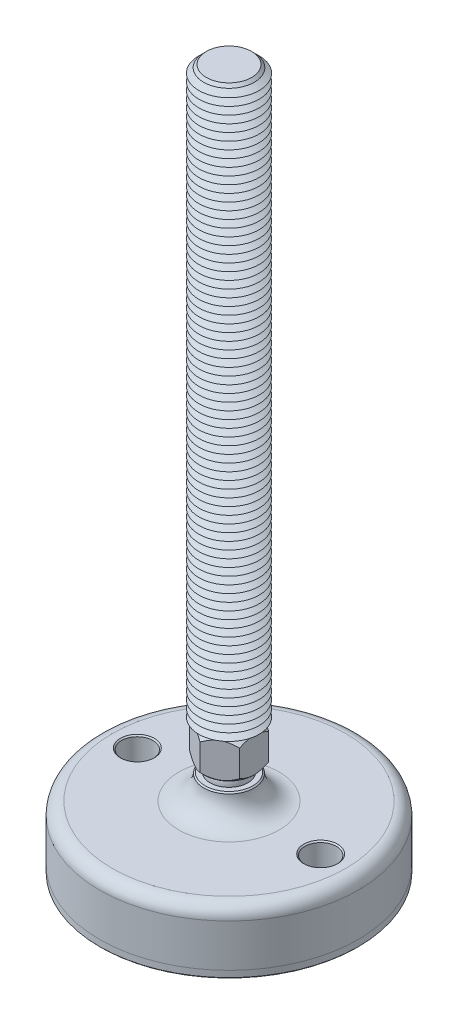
ISO-10303-21;
HEADER;
FILE_DESCRIPTION(('STEP AP214'),'2;1');
FILE_NAME('part.step','',(''),(''),'','','');
FILE_SCHEMA(('AUTOMOTIVE_DESIGN { 1 0 10303 214 1 1 1 1 }'));
ENDSEC;
DATA;
#1=APPLICATION_CONTEXT('core data for automotive mechanical design processes');
#2=APPLICATION_PROTOCOL_DEFINITION('international standard','automotive_design',2000,#1);
#3=PRODUCT_CONTEXT('',#1,'mechanical');
#4=PRODUCT('Part','Part','',(#3));
#5=PRODUCT_RELATED_PRODUCT_CATEGORY('part','',(#4));
#6=PRODUCT_DEFINITION_FORMATION('','',#4);
#7=PRODUCT_DEFINITION_CONTEXT('part definition',#1,'design');
#8=PRODUCT_DEFINITION('design','',#6,#7);
#9=PRODUCT_DEFINITION_SHAPE('','',#8);
#10=(LENGTH_UNIT() NAMED_UNIT(*) SI_UNIT(.MILLI.,.METRE.));
#11=(NAMED_UNIT(*) PLANE_ANGLE_UNIT() SI_UNIT($,.RADIAN.));
#12=(NAMED_UNIT(*) SI_UNIT($,.STERADIAN.) SOLID_ANGLE_UNIT());
#13=UNCERTAINTY_MEASURE_WITH_UNIT(LENGTH_MEASURE(1.E-05),#10,'distance_accuracy_value','');
#14=(GEOMETRIC_REPRESENTATION_CONTEXT(3) GLOBAL_UNCERTAINTY_ASSIGNED_CONTEXT((#13)) GLOBAL_UNIT_ASSIGNED_CONTEXT((#10,
#11,#12)) REPRESENTATION_CONTEXT('',''));
#15=CARTESIAN_POINT('',(0.,0.,0.));
#16=DIRECTION('',(0.,0.,1.));
#17=DIRECTION('',(1.,0.,0.));
#18=AXIS2_PLACEMENT_3D('',#15,#16,#17);
#19=CARTESIAN_POINT('',(0.,-32.,0.));
#20=DIRECTION('',(0.,1.,0.));
#21=DIRECTION('',(0.,0.,1.));
#22=AXIS2_PLACEMENT_3D('',#19,#20,#21);
#23=PLANE('',#22);
#24=CARTESIAN_POINT('',(-36.5,-32.,0.));
#25=DIRECTION('',(0.,1.,0.));
#26=DIRECTION('',(0.,0.,1.));
#27=AXIS2_PLACEMENT_3D('',#24,#25,#26);
#28=CIRCLE('',#27,6.25);
#29=CARTESIAN_POINT('',(-36.5,-32.,6.25));
#30=VERTEX_POINT('',#29);
#31=EDGE_CURVE('P0_E43',#30,#30,#28,.T.);
#32=ORIENTED_EDGE('',*,*,#31,.F.);
#33=EDGE_LOOP('',(#32));
#34=FACE_BOUND('',#33,.T.);
#35=CARTESIAN_POINT('',(36.5,-32.,0.));
#36=DIRECTION('',(0.,1.,0.));
#37=DIRECTION('',(0.,0.,1.));
#38=AXIS2_PLACEMENT_3D('',#35,#36,#37);
#39=CIRCLE('',#38,6.25);
#40=CARTESIAN_POINT('',(36.5,-32.,6.25));
#41=VERTEX_POINT('',#40);
#42=EDGE_CURVE('P0_E44',#41,#41,#39,.T.);
#43=ORIENTED_EDGE('',*,*,#42,.F.);
#44=EDGE_LOOP('',(#43));
#45=FACE_BOUND('',#44,.T.);
#46=CARTESIAN_POINT('',(0.,-32.,0.));
#47=DIRECTION('',(0.,1.,0.));
#48=DIRECTION('',(0.,0.,1.));
#49=AXIS2_PLACEMENT_3D('',#46,#47,#48);
#50=CIRCLE('',#49,51.5);
#51=CARTESIAN_POINT('',(0.,-32.,51.5));
#52=VERTEX_POINT('',#51);
#53=EDGE_CURVE('P0_E40',#52,#52,#50,.T.);
#54=ORIENTED_EDGE('',*,*,#53,.T.);
#55=EDGE_LOOP('',(#54));
#56=FACE_BOUND('',#55,.T.);
#57=ADVANCED_FACE('P0_F14',(#34,#45,#56),#23,.T.);
#58=CARTESIAN_POINT('',(0.,43.1654938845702,0.));
#59=DIRECTION('',(0.,1.,0.));
#60=DIRECTION('',(0.,0.,1.));
#61=AXIS2_PLACEMENT_3D('',#58,#59,#60);
#62=CYLINDRICAL_SURFACE('',#61,51.5);
#63=CARTESIAN_POINT('',(0.,-34.5,0.));
#64=DIRECTION('',(0.,-1.,0.));
#65=DIRECTION('',(0.,0.,-1.));
#66=AXIS2_PLACEMENT_3D('',#63,#64,#65);
#67=CIRCLE('',#66,51.5);
#68=CARTESIAN_POINT('',(0.,-34.5,-51.5));
#69=VERTEX_POINT('',#68);
#70=EDGE_CURVE('P0_E37',#69,#69,#67,.F.);
#71=ORIENTED_EDGE('',*,*,#70,.T.);
#72=EDGE_LOOP('',(#71));
#73=FACE_BOUND('',#72,.T.);
#74=ORIENTED_EDGE('',*,*,#53,.F.);
#75=EDGE_LOOP('',(#74));
#76=FACE_BOUND('',#75,.T.);
#77=ADVANCED_FACE('P0_F54',(#73,#76),#62,.T.);
#78=CARTESIAN_POINT('',(0.,-35.,51.5));
#79=DIRECTION('',(0.,-1.,0.));
#80=DIRECTION('',(0.,0.,-1.));
#81=AXIS2_PLACEMENT_3D('',#78,#79,#80);
#82=PLANE('',#81);
#83=CARTESIAN_POINT('',(36.5,-35.,0.));
#84=DIRECTION('',(0.,-1.,0.));
#85=DIRECTION('',(0.,0.,-1.));
#86=AXIS2_PLACEMENT_3D('',#83,#84,#85);
#87=CIRCLE('',#86,6.75000000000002);
#88=CARTESIAN_POINT('',(36.5,-35.,-6.75000000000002));
#89=VERTEX_POINT('',#88);
#90=EDGE_CURVE('P0_E25',#89,#89,#87,.F.);
#91=ORIENTED_EDGE('',*,*,#90,.T.);
#92=EDGE_LOOP('',(#91));
#93=FACE_BOUND('',#92,.T.);
#94=CARTESIAN_POINT('',(-36.5,-35.,0.));
#95=DIRECTION('',(0.,-1.,0.));
#96=DIRECTION('',(0.,0.,-1.));
#97=AXIS2_PLACEMENT_3D('',#94,#95,#96);
#98=CIRCLE('',#97,6.74999999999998);
#99=CARTESIAN_POINT('',(-36.5,-35.,-6.74999999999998));
#100=VERTEX_POINT('',#99);
#101=EDGE_CURVE('P0_E29',#100,#100,#98,.F.);
#102=ORIENTED_EDGE('',*,*,#101,.T.);
#103=EDGE_LOOP('',(#102));
#104=FACE_BOUND('',#103,.T.);
#105=CARTESIAN_POINT('',(0.,-35.,0.));
#106=DIRECTION('',(0.,-1.,0.));
#107=DIRECTION('',(0.,0.,-1.));
#108=AXIS2_PLACEMENT_3D('',#105,#106,#107);
#109=CIRCLE('',#108,51.);
#110=CARTESIAN_POINT('',(0.,-35.,-51.));
#111=VERTEX_POINT('',#110);
#112=EDGE_CURVE('P0_E34',#111,#111,#109,.T.);
#113=ORIENTED_EDGE('',*,*,#112,.T.);
#114=EDGE_LOOP('',(#113));
#115=FACE_BOUND('',#114,.T.);
#116=ADVANCED_FACE('P0_F61',(#93,#104,#115),#82,.T.);
#117=CARTESIAN_POINT('',(0.,-34.5,0.));
#118=DIRECTION('',(0.,1.,0.));
#119=DIRECTION('',(0.,0.,1.));
#120=AXIS2_PLACEMENT_3D('',#117,#118,#119);
#121=CONICAL_SURFACE('',#120,51.5,0.785398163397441);
#122=ORIENTED_EDGE('',*,*,#112,.F.);
#123=EDGE_LOOP('',(#122));
#124=FACE_BOUND('',#123,.T.);
#125=ORIENTED_EDGE('',*,*,#70,.F.);
#126=EDGE_LOOP('',(#125));
#127=FACE_BOUND('',#126,.T.);
#128=ADVANCED_FACE('P0_F68',(#124,#127),#121,.T.);
#129=CARTESIAN_POINT('',(36.5,-35.,0.));
#130=DIRECTION('',(0.,1.,0.));
#131=DIRECTION('',(0.,0.,1.));
#132=AXIS2_PLACEMENT_3D('',#129,#130,#131);
#133=CYLINDRICAL_SURFACE('',#132,6.25);
#134=CARTESIAN_POINT('',(36.5,-34.5,0.));
#135=DIRECTION('',(0.,-1.,0.));
#136=DIRECTION('',(0.,0.,-1.));
#137=AXIS2_PLACEMENT_3D('',#134,#135,#136);
#138=CIRCLE('',#137,6.25);
#139=CARTESIAN_POINT('',(36.5,-34.5,-6.25));
#140=VERTEX_POINT('',#139);
#141=EDGE_CURVE('P0_E21',#140,#140,#138,.T.);
#142=ORIENTED_EDGE('',*,*,#141,.T.);
#143=EDGE_LOOP('',(#142));
#144=FACE_BOUND('',#143,.T.);
#145=ORIENTED_EDGE('',*,*,#42,.T.);
#146=EDGE_LOOP('',(#145));
#147=FACE_BOUND('',#146,.T.);
#148=ADVANCED_FACE('P0_F74',(#144,#147),#133,.F.);
#149=CARTESIAN_POINT('',(-36.5,-35.,0.));
#150=DIRECTION('',(0.,1.,0.));
#151=DIRECTION('',(0.,0.,1.));
#152=AXIS2_PLACEMENT_3D('',#149,#150,#151);
#153=CYLINDRICAL_SURFACE('',#152,6.25);
#154=CARTESIAN_POINT('',(-36.5,-34.5,0.));
#155=DIRECTION('',(0.,-1.,0.));
#156=DIRECTION('',(0.,0.,-1.));
#157=AXIS2_PLACEMENT_3D('',#154,#155,#156);
#158=CIRCLE('',#157,6.25);
#159=CARTESIAN_POINT('',(-36.5,-34.5,-6.25));
#160=VERTEX_POINT('',#159);
#161=EDGE_CURVE('P0_E10',#160,#160,#158,.T.);
#162=ORIENTED_EDGE('',*,*,#161,.T.);
#163=EDGE_LOOP('',(#162));
#164=FACE_BOUND('',#163,.T.);
#165=ORIENTED_EDGE('',*,*,#31,.T.);
#166=EDGE_LOOP('',(#165));
#167=FACE_BOUND('',#166,.T.);
#168=ADVANCED_FACE('P0_F50',(#164,#167),#153,.F.);
#169=CARTESIAN_POINT('',(36.5,-35.,0.));
#170=DIRECTION('',(0.,-1.,0.));
#171=DIRECTION('',(0.,0.,-1.));
#172=AXIS2_PLACEMENT_3D('',#169,#170,#171);
#173=CONICAL_SURFACE('',#172,6.75000000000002,0.785398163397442);
#174=ORIENTED_EDGE('',*,*,#141,.F.);
#175=EDGE_LOOP('',(#174));
#176=FACE_BOUND('',#175,.T.);
#177=ORIENTED_EDGE('',*,*,#90,.F.);
#178=EDGE_LOOP('',(#177));
#179=FACE_BOUND('',#178,.T.);
#180=ADVANCED_FACE('P0_F76',(#176,#179),#173,.F.);
#181=CARTESIAN_POINT('',(-36.5,-35.,0.));
#182=DIRECTION('',(0.,-1.,0.));
#183=DIRECTION('',(0.,0.,-1.));
#184=AXIS2_PLACEMENT_3D('',#181,#182,#183);
#185=CONICAL_SURFACE('',#184,6.74999999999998,0.785398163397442);
#186=ORIENTED_EDGE('',*,*,#161,.F.);
#187=EDGE_LOOP('',(#186));
#188=FACE_BOUND('',#187,.T.);
#189=ORIENTED_EDGE('',*,*,#101,.F.);
#190=EDGE_LOOP('',(#189));
#191=FACE_BOUND('',#190,.T.);
#192=ADVANCED_FACE('P0_F16',(#188,#191),#185,.F.);
#193=CLOSED_SHELL('',(#57,#77,#116,#128,#148,#168,#180,#192));
#194=MANIFOLD_SOLID_BREP('P0_B1',#193);
#195=CARTESIAN_POINT('',(0.,3.75,0.));
#196=DIRECTION('',(0.,1.,0.));
#197=DIRECTION('',(0.,0.,1.));
#198=AXIS2_PLACEMENT_3D('',#195,#196,#197);
#199=PLANE('',#198);
#200=CARTESIAN_POINT('',(0.,3.75,0.));
#201=DIRECTION('',(0.,1.,0.));
#202=DIRECTION('',(0.,0.,1.));
#203=AXIS2_PLACEMENT_3D('',#200,#201,#202);
#204=CIRCLE('',#203,9.72829454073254);
#205=CARTESIAN_POINT('',(0.,3.75,9.72829454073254));
#206=VERTEX_POINT('',#205);
#207=EDGE_CURVE('P1_E213',#206,#206,#204,.T.);
#208=ORIENTED_EDGE('',*,*,#207,.F.);
#209=EDGE_LOOP('',(#208));
#210=FACE_BOUND('',#209,.T.);
#211=CARTESIAN_POINT('',(0.,3.75,0.));
#212=DIRECTION('',(0.,1.,0.));
#213=DIRECTION('',(0.,0.,1.));
#214=AXIS2_PLACEMENT_3D('',#211,#212,#213);
#215=CIRCLE('',#214,6.49519052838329);
#216=CARTESIAN_POINT('',(0.,3.75,6.49519052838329));
#217=VERTEX_POINT('',#216);
#218=EDGE_CURVE('P1_E25',#217,#217,#215,.F.);
#219=ORIENTED_EDGE('',*,*,#218,.F.);
#220=EDGE_LOOP('',(#219));
#221=FACE_BOUND('',#220,.T.);
#222=ADVANCED_FACE('P1_F16',(#210,#221),#199,.F.);
#223=CARTESIAN_POINT('',(0.,0.,0.));
#224=DIRECTION('',(0.,1.,0.));
#225=DIRECTION('',(0.,0.,-1.));
#226=AXIS2_PLACEMENT_3D('',#223,#224,#225);
#227=SPHERICAL_SURFACE('',#226,7.5);
#228=ORIENTED_EDGE('',*,*,#218,.T.);
#229=EDGE_LOOP('',(#228));
#230=FACE_BOUND('',#229,.T.);
#231=ADVANCED_FACE('P1_F203',(#230),#227,.T.);
#232=CARTESIAN_POINT('',(0.,3.75,0.));
#233=DIRECTION('',(0.,1.,0.));
#234=DIRECTION('',(0.,0.,1.));
#235=AXIS2_PLACEMENT_3D('',#232,#233,#234);
#236=CONICAL_SURFACE('',#235,9.72829454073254,0.785398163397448);
#237=ORIENTED_EDGE('',*,*,#207,.T.);
#238=EDGE_LOOP('',(#237));
#239=FACE_BOUND('',#238,.T.);
#240=CARTESIAN_POINT('',(-10.,9.59571642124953,-11.9394228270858));
#241=CARTESIAN_POINT('',(-10.,9.37430561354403,-11.6505452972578));
#242=CARTESIAN_POINT('',(-10.,9.15490936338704,-11.3600988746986));
#243=CARTESIAN_POINT('',(-10.,8.72106267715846,-10.7754314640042));
#244=CARTESIAN_POINT('',(-10.,8.50661343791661,-10.4812095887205));
#245=CARTESIAN_POINT('',(-10.,8.08205114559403,-9.88620330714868));
#246=CARTESIAN_POINT('',(-10.,7.87198437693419,-9.58538576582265));
#247=CARTESIAN_POINT('',(-10.,7.45926520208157,-8.97872312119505));
#248=CARTESIAN_POINT('',(-10.,7.25661228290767,-8.67287836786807));
#249=CARTESIAN_POINT('',(-10.,6.84809543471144,-8.03614350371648));
#250=CARTESIAN_POINT('',(-10.,6.64281401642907,-7.70487777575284));
#251=CARTESIAN_POINT('',(-10.,6.245142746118,-7.03457466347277));
#252=CARTESIAN_POINT('',(-10.,6.0527550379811,-6.69553599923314));
#253=CARTESIAN_POINT('',(-10.,5.68497951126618,-6.00961937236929));
#254=CARTESIAN_POINT('',(-10.,5.50954176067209,-5.66276839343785));
#255=CARTESIAN_POINT('',(-10.,5.17959635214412,-4.95932933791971));
#256=CARTESIAN_POINT('',(-10.,5.02507889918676,-4.60274591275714));
#257=CARTESIAN_POINT('',(-10.,4.75599518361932,-3.91353381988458));
#258=CARTESIAN_POINT('',(-10.,4.63902686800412,-3.58185263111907));
#259=CARTESIAN_POINT('',(-10.,4.43164927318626,-2.91013341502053));
#260=CARTESIAN_POINT('',(-10.,4.34124171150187,-2.57009484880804));
#261=CARTESIAN_POINT('',(-10.,4.19334931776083,-1.88955843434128));
#262=CARTESIAN_POINT('',(-10.,4.13527351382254,-1.54919119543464));
#263=CARTESIAN_POINT('',(-10.,4.05324021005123,-0.864347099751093));
#264=CARTESIAN_POINT('',(-10.,4.029275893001,-0.519871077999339));
#265=CARTESIAN_POINT('',(-10.,4.01745435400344,0.155191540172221));
#266=CARTESIAN_POINT('',(-10.,4.02812008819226,0.485752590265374));
#267=CARTESIAN_POINT('',(-10.,4.08160326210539,1.1442457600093));
#268=CARTESIAN_POINT('',(-10.,4.12442366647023,1.47217763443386));
#269=CARTESIAN_POINT('',(-10.,4.24054019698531,2.12859326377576));
#270=CARTESIAN_POINT('',(-10.,4.31437036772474,2.45698095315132));
#271=CARTESIAN_POINT('',(-10.,4.48844287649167,3.10654175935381));
#272=CARTESIAN_POINT('',(-10.,4.58868356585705,3.42771532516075));
#273=CARTESIAN_POINT('',(-10.,4.81839210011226,4.08271396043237));
#274=CARTESIAN_POINT('',(-10.,4.94932842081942,4.41601827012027));
#275=CARTESIAN_POINT('',(-10.,5.23140828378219,5.07403931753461));
#276=CARTESIAN_POINT('',(-10.,5.38256099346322,5.3987520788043));
#277=CARTESIAN_POINT('',(-10.,5.70148727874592,6.04113299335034));
#278=CARTESIAN_POINT('',(-10.,5.86931223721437,6.35877542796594));
#279=CARTESIAN_POINT('',(-10.,6.21788686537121,6.98677627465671));
#280=CARTESIAN_POINT('',(-10.,6.39863453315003,7.29713580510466));
#281=CARTESIAN_POINT('',(-10.,6.76133545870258,7.89633938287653));
#282=CARTESIAN_POINT('',(-10.,6.94278731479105,8.18548854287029));
#283=CARTESIAN_POINT('',(-10.,7.31339871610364,8.75881961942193));
#284=CARTESIAN_POINT('',(-10.,7.50255884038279,9.04300116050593));
#285=CARTESIAN_POINT('',(-10.,7.8856676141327,9.6047584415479));
#286=CARTESIAN_POINT('',(-10.,8.07956548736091,9.88236893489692));
#287=CARTESIAN_POINT('',(-10.,8.47254700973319,10.4337838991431));
#288=CARTESIAN_POINT('',(-10.,8.67162921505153,10.7075893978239));
#289=CARTESIAN_POINT('',(-10.,8.87283307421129,10.9797992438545));
#290=B_SPLINE_CURVE_WITH_KNOTS('',3,(#240,#241,#242,#243,#244,#245,#246,#247,#248,#249,#250,
#251,#252,#253,#254,#255,#256,#257,#258,#259,#260,#261,#262,#263,#264,#265,#266,#267,#268,#269,
#270,#271,#272,#273,#274,#275,#276,#277,#278,#279,#280,#281,#282,#283,#284,#285,#286,#287,#288,
#289),.UNSPECIFIED.,.F.,.F.,(4,2,2,2,2,2,2,2,2,2,2,2,2,2,2,2,2,2,2,2,2,2,2,2,4),(0.,
1.09192545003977,2.18411235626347,3.28473497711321,4.3852812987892,5.5541916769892,
6.72329593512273,7.88884387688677,9.05384420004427,10.1080362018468,11.1622963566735,
12.1965943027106,13.2306855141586,14.2212593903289,15.2119246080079,16.2203997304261,
17.2288119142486,18.3022883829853,19.3762532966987,20.4536373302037,21.5308548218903,
22.5548150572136,23.5788523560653,24.5946500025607,25.6101677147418),.UNSPECIFIED.);
#291=CARTESIAN_POINT('',(-10.,5.56871084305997,-5.77350269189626));
#292=VERTEX_POINT('',#291);
#293=CARTESIAN_POINT('',(-10.,5.56871084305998,5.77350269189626));
#294=VERTEX_POINT('',#293);
#295=EDGE_CURVE('P1_E187',#292,#294,#290,.T.);
#296=ORIENTED_EDGE('',*,*,#295,.F.);
#297=CARTESIAN_POINT('',(0.000199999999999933,5.56882631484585,-11.5471208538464));
#298=CARTESIAN_POINT('',(-0.171722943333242,5.4695807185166,-11.447861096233));
#299=CARTESIAN_POINT('',(-0.344992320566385,5.37336355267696,-11.3478239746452));
#300=CARTESIAN_POINT('',(-0.694433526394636,5.18794806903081,-11.1460740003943));
#301=CARTESIAN_POINT('',(-0.870606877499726,5.09875358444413,-11.0443602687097));
#302=CARTESIAN_POINT('',(-1.22689656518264,4.92796770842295,-10.8386563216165));
#303=CARTESIAN_POINT('',(-1.40702970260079,4.84642277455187,-10.7346564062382));
#304=CARTESIAN_POINT('',(-1.77025459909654,4.69270708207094,-10.52494841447));
#305=CARTESIAN_POINT('',(-1.95334590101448,4.62053489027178,-10.4192406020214));
#306=CARTESIAN_POINT('',(-2.31954331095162,4.4878482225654,-10.2078164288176));
#307=CARTESIAN_POINT('',(-2.50260441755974,4.42716910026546,-10.1021260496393));
#308=CARTESIAN_POINT('',(-2.87129282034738,4.31731511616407,-9.88926370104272));
#309=CARTESIAN_POINT('',(-3.05691983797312,4.26813901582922,-9.78209189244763));
#310=CARTESIAN_POINT('',(-3.42994608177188,4.1825291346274,-9.56672509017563));
#311=CARTESIAN_POINT('',(-3.61734032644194,4.14606667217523,-9.45853297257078));
#312=CARTESIAN_POINT('',(-3.99370204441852,4.08668528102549,-9.24124043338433));
#313=CARTESIAN_POINT('',(-4.1826692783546,4.06376432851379,-9.13214015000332));
#314=CARTESIAN_POINT('',(-4.64316633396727,4.0253323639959,-8.86627205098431));
#315=CARTESIAN_POINT('',(-4.91519388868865,4.01726744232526,-8.70921686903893));
#316=CARTESIAN_POINT('',(-5.45875701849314,4.03080424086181,-8.39539054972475));
#317=CARTESIAN_POINT('',(-5.7302923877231,4.05241636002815,-8.23861953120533));
#318=CARTESIAN_POINT('',(-6.27080349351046,4.12403157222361,-7.92655529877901));
#319=CARTESIAN_POINT('',(-6.53977602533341,4.17406641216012,-7.77126393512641));
#320=CARTESIAN_POINT('',(-7.07309796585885,4.29980733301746,-7.46335036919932));
#321=CARTESIAN_POINT('',(-7.33744772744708,4.3755114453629,-7.31072796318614));
#322=CARTESIAN_POINT('',(-7.80670351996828,4.53125365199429,-7.03980300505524));
#323=CARTESIAN_POINT('',(-8.01264886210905,4.60719488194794,-6.92090040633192));
#324=CARTESIAN_POINT('',(-8.42084280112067,4.77131434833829,-6.68522952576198));
#325=CARTESIAN_POINT('',(-8.62309128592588,4.85949295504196,-6.5684613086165));
#326=CARTESIAN_POINT('',(-9.02325448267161,5.04611070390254,-6.33742697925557));
#327=CARTESIAN_POINT('',(-9.22118057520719,5.1445175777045,-6.2231542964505));
#328=CARTESIAN_POINT('',(-9.61336795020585,5.35030005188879,-5.99672480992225));
#329=CARTESIAN_POINT('',(-9.80763139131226,5.45767015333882,-5.88456675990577));
#330=CARTESIAN_POINT('',(-10.0002,5.56882631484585,-5.77338722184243));
#331=B_SPLINE_CURVE_WITH_KNOTS('',3,(#297,#298,#299,#300,#301,#302,#303,#304,#305,#306,#307,
#308,#309,#310,#311,#312,#313,#314,#315,#316,#317,#318,#319,#320,#321,#322,#323,#324,#325,#326,
#327,#328,#329,#330),.UNSPECIFIED.,.F.,.F.,(4,2,2,2,2,2,2,2,2,2,2,2,2,2,2,2,4),(0.,
0.665863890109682,1.33208874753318,2.00212824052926,2.67206515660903,3.33152613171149,
3.99091606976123,4.64880867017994,5.30660292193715,6.24777541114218,7.18927777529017,
8.13183382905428,9.07431761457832,9.82287578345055,10.5714566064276,11.3177436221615,
12.0635761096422),.UNSPECIFIED.);
#332=CARTESIAN_POINT('',(0.,5.56871084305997,-11.5470053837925));
#333=VERTEX_POINT('',#332);
#334=EDGE_CURVE('P1_E181',#333,#292,#331,.T.);
#335=ORIENTED_EDGE('',*,*,#334,.F.);
#336=CARTESIAN_POINT('',(10.0002,5.56882631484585,-5.77338722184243));
#337=CARTESIAN_POINT('',(9.82827705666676,5.4695807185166,-5.87264697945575));
#338=CARTESIAN_POINT('',(9.65500767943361,5.37336355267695,-5.97268410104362));
#339=CARTESIAN_POINT('',(9.30556647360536,5.18794806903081,-6.17443407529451));
#340=CARTESIAN_POINT('',(9.12939312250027,5.09875358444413,-6.27614780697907));
#341=CARTESIAN_POINT('',(8.77310343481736,4.92796770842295,-6.48185175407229));
#342=CARTESIAN_POINT('',(8.59297029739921,4.84642277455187,-6.58585166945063));
#343=CARTESIAN_POINT('',(8.22974540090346,4.69270708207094,-6.79555966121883));
#344=CARTESIAN_POINT('',(8.04665409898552,4.62053489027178,-6.90126747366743));
#345=CARTESIAN_POINT('',(7.68045668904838,4.4878482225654,-7.11269164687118));
#346=CARTESIAN_POINT('',(7.49739558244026,4.42716910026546,-7.21838202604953));
#347=CARTESIAN_POINT('',(7.12870717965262,4.31731511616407,-7.43124437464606));
#348=CARTESIAN_POINT('',(6.94308016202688,4.26813901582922,-7.53841618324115));
#349=CARTESIAN_POINT('',(6.57005391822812,4.1825291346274,-7.75378298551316));
#350=CARTESIAN_POINT('',(6.38265967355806,4.14606667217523,-7.861975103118));
#351=CARTESIAN_POINT('',(6.00629795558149,4.08668528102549,-8.07926764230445));
#352=CARTESIAN_POINT('',(5.81733072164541,4.06376432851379,-8.18836792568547));
#353=CARTESIAN_POINT('',(5.35683366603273,4.0253323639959,-8.45423602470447));
#354=CARTESIAN_POINT('',(5.08480611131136,4.01726744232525,-8.61129120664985));
#355=CARTESIAN_POINT('',(4.54124298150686,4.03080424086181,-8.92511752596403));
#356=CARTESIAN_POINT('',(4.2697076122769,4.05241636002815,-9.08188854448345));
#357=CARTESIAN_POINT('',(3.72919650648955,4.12403157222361,-9.39395277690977));
#358=CARTESIAN_POINT('',(3.46022397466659,4.17406641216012,-9.54924414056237));
#359=CARTESIAN_POINT('',(2.92690203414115,4.29980733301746,-9.85715770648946));
#360=CARTESIAN_POINT('',(2.66255227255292,4.37551144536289,-10.0097801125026));
#361=CARTESIAN_POINT('',(2.19329648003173,4.53125365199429,-10.2807050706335));
#362=CARTESIAN_POINT('',(1.98735113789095,4.60719488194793,-10.3996076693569));
#363=CARTESIAN_POINT('',(1.57915719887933,4.77131434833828,-10.6352785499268));
#364=CARTESIAN_POINT('',(1.37690871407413,4.85949295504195,-10.7520467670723));
#365=CARTESIAN_POINT('',(0.976745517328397,5.04611070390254,-10.9830810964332));
#366=CARTESIAN_POINT('',(0.77881942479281,5.1445175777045,-11.0973537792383));
#367=CARTESIAN_POINT('',(0.386632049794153,5.35030005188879,-11.3237832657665));
#368=CARTESIAN_POINT('',(0.192368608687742,5.45767015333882,-11.435941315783));
#369=CARTESIAN_POINT('',(-0.000199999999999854,5.56882631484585,-11.5471208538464));
#370=B_SPLINE_CURVE_WITH_KNOTS('',3,(#336,#337,#338,#339,#340,#341,#342,#343,#344,#345,#346,
#347,#348,#349,#350,#351,#352,#353,#354,#355,#356,#357,#358,#359,#360,#361,#362,#363,#364,#365,
#366,#367,#368,#369),.UNSPECIFIED.,.F.,.F.,(4,2,2,2,2,2,2,2,2,2,2,2,2,2,2,2,4),(0.,
0.665863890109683,1.33208874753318,2.00212824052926,2.67206515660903,3.33152613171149,
3.99091606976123,4.64880867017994,5.30660292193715,6.24777541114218,7.18927777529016,
8.13183382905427,9.07431761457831,9.82287578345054,10.5714566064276,11.3177436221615,
12.0635761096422),.UNSPECIFIED.);
#371=CARTESIAN_POINT('',(9.99999999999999,5.56871084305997,-5.77350269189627));
#372=VERTEX_POINT('',#371);
#373=EDGE_CURVE('P1_E169',#372,#333,#370,.T.);
#374=ORIENTED_EDGE('',*,*,#373,.F.);
#375=CARTESIAN_POINT('',(10.,9.59571642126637,-11.9394228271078));
#376=CARTESIAN_POINT('',(10.,9.37430561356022,-11.6505452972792));
#377=CARTESIAN_POINT('',(10.,9.15490936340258,-11.3600988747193));
#378=CARTESIAN_POINT('',(10.,8.7210626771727,-10.7754314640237));
#379=CARTESIAN_POINT('',(10.,8.5066134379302,-10.4812095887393));
#380=CARTESIAN_POINT('',(10.,8.08205114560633,-9.88620330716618));
#381=CARTESIAN_POINT('',(10.,7.87198437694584,-9.58538576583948));
#382=CARTESIAN_POINT('',(10.,7.45926520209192,-8.97872312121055));
#383=CARTESIAN_POINT('',(10.,7.25661228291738,-8.67287836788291));
#384=CARTESIAN_POINT('',(10.,6.84809543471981,-8.03614350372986));
#385=CARTESIAN_POINT('',(10.,6.64281401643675,-7.70487777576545));
#386=CARTESIAN_POINT('',(10.,6.24514274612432,-7.03457466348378));
#387=CARTESIAN_POINT('',(10.,6.05275503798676,-6.69553599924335));
#388=CARTESIAN_POINT('',(10.,5.68497951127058,-6.00961937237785));
#389=CARTESIAN_POINT('',(10.,5.50954176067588,-5.66276839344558));
#390=CARTESIAN_POINT('',(10.,5.17959635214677,-4.95932933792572));
#391=CARTESIAN_POINT('',(10.,5.02507889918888,-4.60274591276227));
#392=CARTESIAN_POINT('',(10.,4.75599518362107,-3.91353381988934));
#393=CARTESIAN_POINT('',(10.,4.63902686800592,-3.58185263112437));
#394=CARTESIAN_POINT('',(10.,4.43164927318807,-2.91013341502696));
#395=CARTESIAN_POINT('',(10.,4.34124171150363,-2.57009484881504));
#396=CARTESIAN_POINT('',(10.,4.19334931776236,-1.8895584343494));
#397=CARTESIAN_POINT('',(10.,4.13527351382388,-1.54919119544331));
#398=CARTESIAN_POINT('',(10.,4.05324021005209,-0.86434709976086));
#399=CARTESIAN_POINT('',(10.,4.02927589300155,-0.519871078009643));
#400=CARTESIAN_POINT('',(10.,4.01745435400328,0.155191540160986));
#401=CARTESIAN_POINT('',(10.,4.0281200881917,0.485752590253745));
#402=CARTESIAN_POINT('',(10.,4.08160326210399,1.14424575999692));
#403=CARTESIAN_POINT('',(10.,4.12442366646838,1.47217763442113));
#404=CARTESIAN_POINT('',(10.,4.24054019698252,2.12859326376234));
#405=CARTESIAN_POINT('',(10.,4.31437036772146,2.45698095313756));
#406=CARTESIAN_POINT('',(10.,4.48844287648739,3.1065417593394));
#407=CARTESIAN_POINT('',(10.,4.58868356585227,3.42771532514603));
#408=CARTESIAN_POINT('',(10.,4.81839210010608,4.08271396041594));
#409=CARTESIAN_POINT('',(10.,4.94932842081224,4.41601827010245));
#410=CARTESIAN_POINT('',(10.,5.23140828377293,5.0740393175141));
#411=CARTESIAN_POINT('',(10.,5.38256099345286,5.39875207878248));
#412=CARTESIAN_POINT('',(10.,5.70148727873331,6.04113299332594));
#413=CARTESIAN_POINT('',(10.,5.86931223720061,6.35877542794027));
#414=CARTESIAN_POINT('',(10.,6.21788686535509,6.98677627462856));
#415=CARTESIAN_POINT('',(10.,6.39863453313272,7.29713580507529));
#416=CARTESIAN_POINT('',(10.,6.761335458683,7.89633938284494));
#417=CARTESIAN_POINT('',(10.,6.9427873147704,8.18548854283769));
#418=CARTESIAN_POINT('',(10.,7.31339871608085,8.75881961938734));
#419=CARTESIAN_POINT('',(10.,7.50255884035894,9.04300116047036));
#420=CARTESIAN_POINT('',(10.,7.88566761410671,9.60475844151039));
#421=CARTESIAN_POINT('',(10.,8.07956548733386,9.88236893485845));
#422=CARTESIAN_POINT('',(10.,8.47254700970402,10.4337838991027));
#423=CARTESIAN_POINT('',(10.,8.6716292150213,10.7075893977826));
#424=CARTESIAN_POINT('',(10.,8.87283307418,10.9797992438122));
#425=B_SPLINE_CURVE_WITH_KNOTS('',3,(#375,#376,#377,#378,#379,#380,#381,#382,#383,#384,#385,
#386,#387,#388,#389,#390,#391,#392,#393,#394,#395,#396,#397,#398,#399,#400,#401,#402,#403,#404,
#405,#406,#407,#408,#409,#410,#411,#412,#413,#414,#415,#416,#417,#418,#419,#420,#421,#422,#423,
#424),.UNSPECIFIED.,.F.,.F.,(4,2,2,2,2,2,2,2,2,2,2,2,2,2,2,2,2,2,2,2,2,2,2,2,4),(0.,
1.09192545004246,2.18411235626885,3.28473497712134,4.38528129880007,5.55419167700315,
6.72329593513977,7.88884387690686,9.05384420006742,10.1080362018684,11.1622963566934,
12.196594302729,13.2306855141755,14.2212593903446,15.2119246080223,16.2203997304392,
17.2288119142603,18.3022883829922,19.3762532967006,20.4536373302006,21.5308548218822,
22.5548150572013,23.5788523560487,24.5946500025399,25.6101677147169),.UNSPECIFIED.);
#426=CARTESIAN_POINT('',(10.,5.56871084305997,5.77350269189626));
#427=VERTEX_POINT('',#426);
#428=EDGE_CURVE('P1_E71',#427,#372,#425,.F.);
#429=ORIENTED_EDGE('',*,*,#428,.F.);
#430=CARTESIAN_POINT('',(-0.000200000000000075,5.56882631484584,11.5471208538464));
#431=CARTESIAN_POINT('',(0.171722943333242,5.4695807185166,11.447861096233));
#432=CARTESIAN_POINT('',(0.344992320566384,5.37336355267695,11.3478239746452));
#433=CARTESIAN_POINT('',(0.694433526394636,5.18794806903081,11.1460740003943));
#434=CARTESIAN_POINT('',(0.870606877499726,5.09875358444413,11.0443602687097));
#435=CARTESIAN_POINT('',(1.22689656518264,4.92796770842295,10.8386563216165));
#436=CARTESIAN_POINT('',(1.40702970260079,4.84642277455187,10.7346564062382));
#437=CARTESIAN_POINT('',(1.77025459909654,4.69270708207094,10.52494841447));
#438=CARTESIAN_POINT('',(1.95334590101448,4.62053489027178,10.4192406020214));
#439=CARTESIAN_POINT('',(2.31954331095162,4.4878482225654,10.2078164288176));
#440=CARTESIAN_POINT('',(2.50260441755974,4.42716910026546,10.1021260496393));
#441=CARTESIAN_POINT('',(2.87129282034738,4.31731511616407,9.88926370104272));
#442=CARTESIAN_POINT('',(3.05691983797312,4.26813901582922,9.78209189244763));
#443=CARTESIAN_POINT('',(3.42994608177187,4.18252913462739,9.56672509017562));
#444=CARTESIAN_POINT('',(3.61734032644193,4.14606667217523,9.45853297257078));
#445=CARTESIAN_POINT('',(3.99370204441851,4.08668528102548,9.24124043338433));
#446=CARTESIAN_POINT('',(4.18266927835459,4.06376432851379,9.13214015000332));
#447=CARTESIAN_POINT('',(4.64316633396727,4.0253323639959,8.86627205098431));
#448=CARTESIAN_POINT('',(4.91519388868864,4.01726744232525,8.70921686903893));
#449=CARTESIAN_POINT('',(5.45875701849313,4.03080424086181,8.39539054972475));
#450=CARTESIAN_POINT('',(5.7302923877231,4.05241636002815,8.23861953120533));
#451=CARTESIAN_POINT('',(6.27080349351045,4.1240315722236,7.92655529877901));
#452=CARTESIAN_POINT('',(6.53977602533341,4.17406641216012,7.77126393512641));
#453=CARTESIAN_POINT('',(7.07309796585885,4.29980733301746,7.46335036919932));
#454=CARTESIAN_POINT('',(7.33744772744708,4.37551144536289,7.31072796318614));
#455=CARTESIAN_POINT('',(7.80670351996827,4.53125365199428,7.03980300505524));
#456=CARTESIAN_POINT('',(8.01264886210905,4.60719488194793,6.92090040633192));
#457=CARTESIAN_POINT('',(8.42084280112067,4.77131434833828,6.68522952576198));
#458=CARTESIAN_POINT('',(8.62309128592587,4.85949295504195,6.5684613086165));
#459=CARTESIAN_POINT('',(9.0232544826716,5.04611070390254,6.33742697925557));
#460=CARTESIAN_POINT('',(9.22118057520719,5.1445175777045,6.2231542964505));
#461=CARTESIAN_POINT('',(9.61336795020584,5.35030005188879,5.99672480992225));
#462=CARTESIAN_POINT('',(9.80763139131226,5.45767015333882,5.88456675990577));
#463=CARTESIAN_POINT('',(10.0002,5.56882631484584,5.77338722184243));
#464=B_SPLINE_CURVE_WITH_KNOTS('',3,(#430,#431,#432,#433,#434,#435,#436,#437,#438,#439,#440,
#441,#442,#443,#444,#445,#446,#447,#448,#449,#450,#451,#452,#453,#454,#455,#456,#457,#458,#459,
#460,#461,#462,#463),.UNSPECIFIED.,.F.,.F.,(4,2,2,2,2,2,2,2,2,2,2,2,2,2,2,2,4),(0.,
0.665863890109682,1.33208874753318,2.00212824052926,2.67206515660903,3.33152613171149,
3.99091606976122,4.64880867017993,5.30660292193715,6.24777541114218,7.18927777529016,
8.13183382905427,9.07431761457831,9.82287578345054,10.5714566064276,11.3177436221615,
12.0635761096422),.UNSPECIFIED.);
#465=CARTESIAN_POINT('',(0.,5.56871084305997,11.5470053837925));
#466=VERTEX_POINT('',#465);
#467=EDGE_CURVE('P1_E68',#466,#427,#464,.T.);
#468=ORIENTED_EDGE('',*,*,#467,.F.);
#469=CARTESIAN_POINT('',(-10.0002,5.56882631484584,5.77338722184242));
#470=CARTESIAN_POINT('',(-9.82827705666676,5.4695807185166,5.87264697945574));
#471=CARTESIAN_POINT('',(-9.65500767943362,5.37336355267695,5.97268410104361));
#472=CARTESIAN_POINT('',(-9.30556647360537,5.18794806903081,6.1744340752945));
#473=CARTESIAN_POINT('',(-9.12939312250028,5.09875358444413,6.27614780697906));
#474=CARTESIAN_POINT('',(-8.77310343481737,4.92796770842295,6.48185175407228));
#475=CARTESIAN_POINT('',(-8.59297029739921,4.84642277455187,6.58585166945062));
#476=CARTESIAN_POINT('',(-8.22974540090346,4.69270708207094,6.79555966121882));
#477=CARTESIAN_POINT('',(-8.04665409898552,4.62053489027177,6.90126747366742));
#478=CARTESIAN_POINT('',(-7.68045668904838,4.48784822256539,7.11269164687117));
#479=CARTESIAN_POINT('',(-7.49739558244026,4.42716910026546,7.21838202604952));
#480=CARTESIAN_POINT('',(-7.12870717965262,4.31731511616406,7.43124437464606));
#481=CARTESIAN_POINT('',(-6.94308016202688,4.26813901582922,7.53841618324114));
#482=CARTESIAN_POINT('',(-6.57005391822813,4.18252913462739,7.75378298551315));
#483=CARTESIAN_POINT('',(-6.38265967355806,4.14606667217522,7.861975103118));
#484=CARTESIAN_POINT('',(-6.00629795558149,4.08668528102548,8.07926764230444));
#485=CARTESIAN_POINT('',(-5.81733072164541,4.06376432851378,8.18836792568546));
#486=CARTESIAN_POINT('',(-5.35683366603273,4.0253323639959,8.45423602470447));
#487=CARTESIAN_POINT('',(-5.08480611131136,4.01726744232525,8.61129120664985));
#488=CARTESIAN_POINT('',(-4.54124298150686,4.0308042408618,8.92511752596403));
#489=CARTESIAN_POINT('',(-4.2697076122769,4.05241636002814,9.08188854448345));
#490=CARTESIAN_POINT('',(-3.72919650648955,4.1240315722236,9.39395277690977));
#491=CARTESIAN_POINT('',(-3.46022397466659,4.17406641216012,9.54924414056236));
#492=CARTESIAN_POINT('',(-2.92690203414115,4.29980733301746,9.85715770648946));
#493=CARTESIAN_POINT('',(-2.66255227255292,4.37551144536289,10.0097801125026));
#494=CARTESIAN_POINT('',(-2.19329648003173,4.53125365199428,10.2807050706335));
#495=CARTESIAN_POINT('',(-1.98735113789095,4.60719488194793,10.3996076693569));
#496=CARTESIAN_POINT('',(-1.57915719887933,4.77131434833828,10.6352785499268));
#497=CARTESIAN_POINT('',(-1.37690871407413,4.85949295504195,10.7520467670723));
#498=CARTESIAN_POINT('',(-0.976745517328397,5.04611070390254,10.9830810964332));
#499=CARTESIAN_POINT('',(-0.778819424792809,5.1445175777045,11.0973537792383));
#500=CARTESIAN_POINT('',(-0.386632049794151,5.35030005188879,11.3237832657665));
#501=CARTESIAN_POINT('',(-0.192368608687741,5.45767015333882,11.435941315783));
#502=CARTESIAN_POINT('',(0.000199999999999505,5.56882631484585,11.5471208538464));
#503=B_SPLINE_CURVE_WITH_KNOTS('',3,(#469,#470,#471,#472,#473,#474,#475,#476,#477,#478,#479,
#480,#481,#482,#483,#484,#485,#486,#487,#488,#489,#490,#491,#492,#493,#494,#495,#496,#497,#498,
#499,#500,#501,#502),.UNSPECIFIED.,.F.,.F.,(4,2,2,2,2,2,2,2,2,2,2,2,2,2,2,2,4),(0.,
0.665863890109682,1.33208874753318,2.00212824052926,2.67206515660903,3.33152613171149,
3.99091606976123,4.64880867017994,5.30660292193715,6.24777541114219,7.18927777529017,
8.13183382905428,9.07431761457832,9.82287578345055,10.5714566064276,11.3177436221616,
12.0635761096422),.UNSPECIFIED.);
#504=EDGE_CURVE('P1_E40',#294,#466,#503,.T.);
#505=ORIENTED_EDGE('',*,*,#504,.F.);
#506=EDGE_LOOP('',(#296,#335,#374,#429,#468,#505));
#507=FACE_BOUND('',#506,.T.);
#508=ADVANCED_FACE('P1_F69',(#239,#507),#236,.T.);
#509=CARTESIAN_POINT('',(-10.,19.,-5.77350269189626));
#510=DIRECTION('',(1.,0.,0.));
#511=DIRECTION('',(0.,0.,-1.));
#512=AXIS2_PLACEMENT_3D('',#509,#510,#511);
#513=PLANE('',#512);
#514=DIRECTION('',(0.,-1.,0.));
#515=VECTOR('',#514,1.);
#516=CARTESIAN_POINT('',(-10.,19.,5.77350269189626));
#517=LINE('',#516,#515);
#518=CARTESIAN_POINT('',(-10.,16.1132486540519,5.77350269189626));
#519=VERTEX_POINT('',#518);
#520=EDGE_CURVE('P1_E84',#519,#294,#517,.T.);
#521=ORIENTED_EDGE('',*,*,#520,.F.);
#522=CARTESIAN_POINT('',(-10.,12.4093918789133,-11.5147208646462));
#523=CARTESIAN_POINT('',(-10.,12.6210295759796,-11.2343500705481));
#524=CARTESIAN_POINT('',(-10.,12.8306215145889,-10.9524094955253));
#525=CARTESIAN_POINT('',(-10.,13.2447979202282,-10.3847695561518));
#526=CARTESIAN_POINT('',(-10.,13.4493811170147,-10.0990692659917));
#527=CARTESIAN_POINT('',(-10.,13.8540786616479,-9.52120077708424));
#528=CARTESIAN_POINT('',(-10.,14.0541461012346,-9.22899961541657));
#529=CARTESIAN_POINT('',(-10.,14.4468132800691,-8.63963749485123));
#530=CARTESIAN_POINT('',(-10.,14.6394135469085,-8.34247688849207));
#531=CARTESIAN_POINT('',(-10.,15.0262335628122,-7.72525702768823));
#532=CARTESIAN_POINT('',(-10.,15.2199166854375,-7.40485974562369));
#533=CARTESIAN_POINT('',(-10.,15.5945399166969,-6.75658646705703));
#534=CARTESIAN_POINT('',(-10.,15.7754780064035,-6.4287092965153));
#535=CARTESIAN_POINT('',(-10.,16.1207071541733,-5.76550673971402));
#536=CARTESIAN_POINT('',(-10.,16.285047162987,-5.43020703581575));
#537=CARTESIAN_POINT('',(-10.,16.5934011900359,-4.75046311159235));
#538=CARTESIAN_POINT('',(-10.,16.7374244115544,-4.40602311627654));
#539=CARTESIAN_POINT('',(-10.,16.9894496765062,-3.73558113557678));
#540=CARTESIAN_POINT('',(-10.,17.0994177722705,-3.41032595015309));
#541=CARTESIAN_POINT('',(-10.,17.2932601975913,-2.75198473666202));
#542=CARTESIAN_POINT('',(-10.,17.377132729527,-2.4188981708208));
#543=CARTESIAN_POINT('',(-10.,17.5130086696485,-1.7524231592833));
#544=CARTESIAN_POINT('',(-10.,17.565558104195,-1.41914787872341));
#545=CARTESIAN_POINT('',(-10.,17.6377678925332,-0.749034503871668));
#546=CARTESIAN_POINT('',(-10.,17.6574338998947,-0.412197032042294));
#547=CARTESIAN_POINT('',(-10.,17.6624162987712,0.249527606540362));
#548=CARTESIAN_POINT('',(-10.,17.6489502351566,0.574406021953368));
#549=CARTESIAN_POINT('',(-10.,17.5910984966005,1.22138001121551));
#550=CARTESIAN_POINT('',(-10.,17.5467098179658,1.54347531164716));
#551=CARTESIAN_POINT('',(-10.,17.4286795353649,2.18799750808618));
#552=CARTESIAN_POINT('',(-10.,17.3545401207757,2.51033177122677));
#553=CARTESIAN_POINT('',(-10.,17.180962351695,3.14797698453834));
#554=CARTESIAN_POINT('',(-10.,17.0815261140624,3.46328851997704));
#555=CARTESIAN_POINT('',(-10.,16.8512186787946,4.11544298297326));
#556=CARTESIAN_POINT('',(-10.,16.7182795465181,4.45154819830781));
#557=CARTESIAN_POINT('',(-10.,16.431992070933,5.115028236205));
#558=CARTESIAN_POINT('',(-10.,16.2786342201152,5.4423989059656));
#559=CARTESIAN_POINT('',(-10.,15.9551580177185,6.09000973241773));
#560=CARTESIAN_POINT('',(-10.,15.7849870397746,6.41022338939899));
#561=CARTESIAN_POINT('',(-10.,15.4316458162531,7.04328175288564));
#562=CARTESIAN_POINT('',(-10.,15.2484776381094,7.35612762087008));
#563=CARTESIAN_POINT('',(-10.,14.8810750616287,7.96002022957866));
#564=CARTESIAN_POINT('',(-10.,14.6973474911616,8.25137695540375));
#565=CARTESIAN_POINT('',(-10.,14.3221662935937,8.82908851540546));
#566=CARTESIAN_POINT('',(-10.,14.1307120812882,9.1154429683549));
#567=CARTESIAN_POINT('',(-10.,13.7430400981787,9.68148259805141));
#568=CARTESIAN_POINT('',(-10.,13.5468736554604,9.96120305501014));
#569=CARTESIAN_POINT('',(-10.,13.149353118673,10.5168212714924));
#570=CARTESIAN_POINT('',(-10.,12.9480004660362,10.7927200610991));
#571=CARTESIAN_POINT('',(-10.,12.7445274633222,11.0670185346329));
#572=B_SPLINE_CURVE_WITH_KNOTS('',3,(#522,#523,#524,#525,#526,#527,#528,#529,#530,#531,#532,
#533,#534,#535,#536,#537,#538,#539,#540,#541,#542,#543,#544,#545,#546,#547,#548,#549,#550,#551,
#552,#553,#554,#555,#556,#557,#558,#559,#560,#561,#562,#563,#564,#565,#566,#567,#568,#569,#570,
#571),.UNSPECIFIED.,.F.,.F.,(4,2,2,2,2,2,2,2,2,2,2,2,2,2,2,2,2,2,2,2,2,2,2,2,4),(0.,
1.05386365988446,2.10799187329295,3.17028777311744,4.23250847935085,5.35544154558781,
6.47855209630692,7.5982472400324,8.71743353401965,9.74655549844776,10.7757483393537,
11.7864315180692,12.7969409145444,13.7708741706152,14.7449020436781,15.7359570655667,
16.7269291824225,17.8104078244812,18.8943927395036,19.981885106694,21.0692048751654,
22.1024062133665,23.1356859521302,24.1605722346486,25.1851766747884),.UNSPECIFIED.);
#573=CARTESIAN_POINT('',(-10.,16.1132486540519,-5.77350269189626));
#574=VERTEX_POINT('',#573);
#575=EDGE_CURVE('P1_E85',#519,#574,#572,.F.);
#576=ORIENTED_EDGE('',*,*,#575,.T.);
#577=DIRECTION('',(0.,-1.,0.));
#578=VECTOR('',#577,1.);
#579=CARTESIAN_POINT('',(-10.,19.,-5.77350269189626));
#580=LINE('',#579,#578);
#581=EDGE_CURVE('P1_E102',#574,#292,#580,.T.);
#582=ORIENTED_EDGE('',*,*,#581,.T.);
#583=ORIENTED_EDGE('',*,*,#295,.T.);
#584=EDGE_LOOP('',(#521,#576,#582,#583));
#585=FACE_BOUND('',#584,.T.);
#586=ADVANCED_FACE('P1_F195',(#585),#513,.F.);
#587=CARTESIAN_POINT('',(0.,19.,-11.5470053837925));
#588=DIRECTION('',(0.5,0.,0.866025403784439));
#589=DIRECTION('',(0.866025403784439,0.,-0.5));
#590=AXIS2_PLACEMENT_3D('',#587,#588,#589);
#591=PLANE('',#590);
#592=ORIENTED_EDGE('',*,*,#581,.F.);
#593=CARTESIAN_POINT('',(-10.0002,16.113133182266,-5.77338722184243));
#594=CARTESIAN_POINT('',(-9.82827705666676,16.2123787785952,-5.87264697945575));
#595=CARTESIAN_POINT('',(-9.65500767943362,16.3085959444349,-5.97268410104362));
#596=CARTESIAN_POINT('',(-9.30556647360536,16.494011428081,-6.17443407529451));
#597=CARTESIAN_POINT('',(-9.12939312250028,16.5832059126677,-6.27614780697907));
#598=CARTESIAN_POINT('',(-8.77310343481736,16.7539917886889,-6.48185175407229));
#599=CARTESIAN_POINT('',(-8.59297029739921,16.83553672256,-6.58585166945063));
#600=CARTESIAN_POINT('',(-8.22974540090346,16.9892524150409,-6.79555966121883));
#601=CARTESIAN_POINT('',(-8.04665409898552,17.0614246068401,-6.90126747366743));
#602=CARTESIAN_POINT('',(-7.68045668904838,17.1941112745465,-7.11269164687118));
#603=CARTESIAN_POINT('',(-7.49739558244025,17.2547903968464,-7.21838202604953));
#604=CARTESIAN_POINT('',(-7.12870717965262,17.3646443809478,-7.43124437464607));
#605=CARTESIAN_POINT('',(-6.94308016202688,17.4138204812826,-7.53841618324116));
#606=CARTESIAN_POINT('',(-6.57005391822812,17.4994303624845,-7.75378298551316));
#607=CARTESIAN_POINT('',(-6.38265967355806,17.5358928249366,-7.86197510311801));
#608=CARTESIAN_POINT('',(-6.00629795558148,17.5952742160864,-8.07926764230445));
#609=CARTESIAN_POINT('',(-5.8173307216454,17.6181951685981,-8.18836792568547));
#610=CARTESIAN_POINT('',(-5.35683366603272,17.6566271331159,-8.45423602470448));
#611=CARTESIAN_POINT('',(-5.08480611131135,17.6646920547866,-8.61129120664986));
#612=CARTESIAN_POINT('',(-4.54124298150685,17.65115525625,-8.92511752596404));
#613=CARTESIAN_POINT('',(-4.26970761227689,17.6295431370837,-9.08188854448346));
#614=CARTESIAN_POINT('',(-3.72919650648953,17.5579279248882,-9.39395277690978));
#615=CARTESIAN_POINT('',(-3.46022397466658,17.5078930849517,-9.54924414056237));
#616=CARTESIAN_POINT('',(-2.92690203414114,17.3821521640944,-9.85715770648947));
#617=CARTESIAN_POINT('',(-2.66255227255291,17.3064480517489,-10.0097801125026));
#618=CARTESIAN_POINT('',(-2.19329648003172,17.1507058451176,-10.2807050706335));
#619=CARTESIAN_POINT('',(-1.98735113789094,17.0747646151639,-10.3996076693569));
#620=CARTESIAN_POINT('',(-1.57915719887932,16.9106451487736,-10.6352785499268));
#621=CARTESIAN_POINT('',(-1.37690871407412,16.8224665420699,-10.7520467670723));
#622=CARTESIAN_POINT('',(-0.976745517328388,16.6358487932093,-10.9830810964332));
#623=CARTESIAN_POINT('',(-0.778819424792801,16.5374419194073,-11.0973537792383));
#624=CARTESIAN_POINT('',(-0.386632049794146,16.3316594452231,-11.3237832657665));
#625=CARTESIAN_POINT('',(-0.192368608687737,16.224289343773,-11.435941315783));
#626=CARTESIAN_POINT('',(0.000200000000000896,16.113133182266,-11.5471208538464));
#627=B_SPLINE_CURVE_WITH_KNOTS('',3,(#593,#594,#595,#596,#597,#598,#599,#600,#601,#602,#603,
#604,#605,#606,#607,#608,#609,#610,#611,#612,#613,#614,#615,#616,#617,#618,#619,#620,#621,#622,
#623,#624,#625,#626),.UNSPECIFIED.,.F.,.F.,(4,2,2,2,2,2,2,2,2,2,2,2,2,2,2,2,4),(0.,
0.665863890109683,1.33208874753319,2.00212824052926,2.67206515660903,3.3315261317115,
3.99091606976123,4.64880867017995,5.30660292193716,6.24777541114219,7.18927777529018,
8.13183382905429,9.07431761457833,9.82287578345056,10.5714566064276,11.3177436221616,
12.0635761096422),.UNSPECIFIED.);
#628=CARTESIAN_POINT('',(0.,16.1132486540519,-11.5470053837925));
#629=VERTEX_POINT('',#628);
#630=EDGE_CURVE('P1_E32',#574,#629,#627,.T.);
#631=ORIENTED_EDGE('',*,*,#630,.T.);
#632=DIRECTION('',(0.,-1.,0.));
#633=VECTOR('',#632,1.);
#634=CARTESIAN_POINT('',(0.,19.,-11.5470053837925));
#635=LINE('',#634,#633);
#636=EDGE_CURVE('P1_E99',#629,#333,#635,.T.);
#637=ORIENTED_EDGE('',*,*,#636,.T.);
#638=ORIENTED_EDGE('',*,*,#334,.T.);
#639=EDGE_LOOP('',(#592,#631,#637,#638));
#640=FACE_BOUND('',#639,.T.);
#641=ADVANCED_FACE('P1_F192',(#640),#591,.F.);
#642=CARTESIAN_POINT('',(10.,19.,-5.77350269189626));
#643=DIRECTION('',(-0.5,0.,0.866025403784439));
#644=DIRECTION('',(0.866025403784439,0.,0.5));
#645=AXIS2_PLACEMENT_3D('',#642,#643,#644);
#646=PLANE('',#645);
#647=ORIENTED_EDGE('',*,*,#636,.F.);
#648=CARTESIAN_POINT('',(-0.000199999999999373,16.113133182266,-11.5471208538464));
#649=CARTESIAN_POINT('',(0.171722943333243,16.2123787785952,-11.447861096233));
#650=CARTESIAN_POINT('',(0.344992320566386,16.3085959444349,-11.3478239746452));
#651=CARTESIAN_POINT('',(0.694433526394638,16.494011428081,-11.1460740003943));
#652=CARTESIAN_POINT('',(0.870606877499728,16.5832059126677,-11.0443602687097));
#653=CARTESIAN_POINT('',(1.22689656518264,16.7539917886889,-10.8386563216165));
#654=CARTESIAN_POINT('',(1.4070297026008,16.83553672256,-10.7346564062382));
#655=CARTESIAN_POINT('',(1.77025459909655,16.9892524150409,-10.52494841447));
#656=CARTESIAN_POINT('',(1.95334590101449,17.0614246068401,-10.4192406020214));
#657=CARTESIAN_POINT('',(2.31954331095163,17.1941112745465,-10.2078164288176));
#658=CARTESIAN_POINT('',(2.50260441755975,17.2547903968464,-10.1021260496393));
#659=CARTESIAN_POINT('',(2.87129282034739,17.3646443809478,-9.88926370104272));
#660=CARTESIAN_POINT('',(3.05691983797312,17.4138204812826,-9.78209189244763));
#661=CARTESIAN_POINT('',(3.42994608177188,17.4994303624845,-9.56672509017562));
#662=CARTESIAN_POINT('',(3.61734032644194,17.5358928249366,-9.45853297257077));
#663=CARTESIAN_POINT('',(3.99370204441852,17.5952742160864,-9.24124043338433));
#664=CARTESIAN_POINT('',(4.1826692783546,17.6181951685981,-9.13214015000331));
#665=CARTESIAN_POINT('',(4.64316633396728,17.6566271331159,-8.86627205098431));
#666=CARTESIAN_POINT('',(4.91519388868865,17.6646920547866,-8.70921686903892));
#667=CARTESIAN_POINT('',(5.45875701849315,17.65115525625,-8.39539054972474));
#668=CARTESIAN_POINT('',(5.73029238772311,17.6295431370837,-8.23861953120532));
#669=CARTESIAN_POINT('',(6.27080349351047,17.5579279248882,-7.92655529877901));
#670=CARTESIAN_POINT('',(6.53977602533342,17.5078930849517,-7.77126393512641));
#671=CARTESIAN_POINT('',(7.07309796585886,17.3821521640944,-7.46335036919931));
#672=CARTESIAN_POINT('',(7.33744772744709,17.3064480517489,-7.31072796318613));
#673=CARTESIAN_POINT('',(7.80670351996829,17.1507058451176,-7.03980300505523));
#674=CARTESIAN_POINT('',(8.01264886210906,17.0747646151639,-6.92090040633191));
#675=CARTESIAN_POINT('',(8.42084280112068,16.9106451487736,-6.68522952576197));
#676=CARTESIAN_POINT('',(8.62309128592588,16.8224665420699,-6.5684613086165));
#677=CARTESIAN_POINT('',(9.02325448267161,16.6358487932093,-6.33742697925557));
#678=CARTESIAN_POINT('',(9.2211805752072,16.5374419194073,-6.2231542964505));
#679=CARTESIAN_POINT('',(9.61336795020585,16.3316594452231,-5.99672480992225));
#680=CARTESIAN_POINT('',(9.80763139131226,16.224289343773,-5.88456675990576));
#681=CARTESIAN_POINT('',(10.0002,16.113133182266,-5.77338722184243));
#682=B_SPLINE_CURVE_WITH_KNOTS('',3,(#648,#649,#650,#651,#652,#653,#654,#655,#656,#657,#658,
#659,#660,#661,#662,#663,#664,#665,#666,#667,#668,#669,#670,#671,#672,#673,#674,#675,#676,#677,
#678,#679,#680,#681),.UNSPECIFIED.,.F.,.F.,(4,2,2,2,2,2,2,2,2,2,2,2,2,2,2,2,4),(0.,
0.665863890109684,1.33208874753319,2.00212824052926,2.67206515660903,3.3315261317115,
3.99091606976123,4.64880867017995,5.30660292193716,6.24777541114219,7.18927777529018,
8.13183382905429,9.07431761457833,9.82287578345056,10.5714566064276,11.3177436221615,
12.0635761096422),.UNSPECIFIED.);
#683=CARTESIAN_POINT('',(10.,16.1132486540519,-5.77350269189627));
#684=VERTEX_POINT('',#683);
#685=EDGE_CURVE('P1_E145',#629,#684,#682,.T.);
#686=ORIENTED_EDGE('',*,*,#685,.T.);
#687=DIRECTION('',(0.,-1.,0.));
#688=VECTOR('',#687,1.);
#689=CARTESIAN_POINT('',(10.,19.,-5.77350269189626));
#690=LINE('',#689,#688);
#691=EDGE_CURVE('P1_E94',#684,#372,#690,.T.);
#692=ORIENTED_EDGE('',*,*,#691,.T.);
#693=ORIENTED_EDGE('',*,*,#373,.T.);
#694=EDGE_LOOP('',(#647,#686,#692,#693));
#695=FACE_BOUND('',#694,.T.);
#696=ADVANCED_FACE('P1_F159',(#695),#646,.F.);
#697=CARTESIAN_POINT('',(10.,19.,5.77350269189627));
#698=DIRECTION('',(-1.,0.,0.));
#699=DIRECTION('',(0.,0.,1.));
#700=AXIS2_PLACEMENT_3D('',#697,#698,#699);
#701=PLANE('',#700);
#702=ORIENTED_EDGE('',*,*,#691,.F.);
#703=CARTESIAN_POINT('',(10.,12.4093918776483,-11.5147208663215));
#704=CARTESIAN_POINT('',(10.,12.6210295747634,-11.2343500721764));
#705=CARTESIAN_POINT('',(10.,12.8306215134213,-10.9524094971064));
#706=CARTESIAN_POINT('',(10.,13.2447979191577,-10.3847695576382));
#707=CARTESIAN_POINT('',(10.,13.4493811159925,-10.0990692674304));
#708=CARTESIAN_POINT('',(10.,13.8540786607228,-9.52120077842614));
#709=CARTESIAN_POINT('',(10.,14.0541461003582,-9.22899961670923));
#710=CARTESIAN_POINT('',(10.,14.4468132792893,-8.6396374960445));
#711=CARTESIAN_POINT('',(10.,14.6394135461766,-8.34247688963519));
#712=CARTESIAN_POINT('',(10.,15.02623356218,-7.72525702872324));
#713=CARTESIAN_POINT('',(10.,15.2199166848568,-7.40485974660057));
#714=CARTESIAN_POINT('',(10.,15.5945399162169,-6.75658646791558));
#715=CARTESIAN_POINT('',(10.,15.7754780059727,-6.42870929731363));
#716=CARTESIAN_POINT('',(10.,16.1207071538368,-5.76550674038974));
#717=CARTESIAN_POINT('',(10.,16.2850471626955,-5.4302070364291));
#718=CARTESIAN_POINT('',(10.,16.593401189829,-4.75046311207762));
#719=CARTESIAN_POINT('',(10.,16.7374244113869,-4.40602311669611));
#720=CARTESIAN_POINT('',(10.,16.9894496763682,-3.73558113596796));
#721=CARTESIAN_POINT('',(10.,17.09941777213,-3.41032595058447));
#722=CARTESIAN_POINT('',(10.,17.2932601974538,-2.75198473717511));
#723=CARTESIAN_POINT('',(10.,17.3771327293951,-2.4188981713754));
#724=CARTESIAN_POINT('',(10.,17.5130086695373,-1.75242315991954));
#725=CARTESIAN_POINT('',(10.,17.5655581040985,-1.41914787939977));
#726=CARTESIAN_POINT('',(10.,17.6377678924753,-0.749034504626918));
#727=CARTESIAN_POINT('',(10.,17.6574338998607,-0.41219703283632));
#728=CARTESIAN_POINT('',(10.,17.6624162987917,0.249527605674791));
#729=CARTESIAN_POINT('',(10.,17.6489502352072,0.574406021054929));
#730=CARTESIAN_POINT('',(10.,17.5910984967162,1.22138001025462));
#731=CARTESIAN_POINT('',(10.,17.5467098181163,1.5434753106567));
#732=CARTESIAN_POINT('',(10.,17.4286795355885,2.18799750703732));
#733=CARTESIAN_POINT('',(10.,17.3545401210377,2.51033177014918));
#734=CARTESIAN_POINT('',(10.,17.1809623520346,3.14797698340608));
#735=CARTESIAN_POINT('',(10.,17.0815261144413,3.46328851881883));
#736=CARTESIAN_POINT('',(10.,16.8512186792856,4.11544298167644));
#737=CARTESIAN_POINT('',(10.,16.7182795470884,4.45154819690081));
#738=CARTESIAN_POINT('',(10.,16.4319920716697,5.11502823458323));
#739=CARTESIAN_POINT('',(10.,16.2786342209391,5.44239890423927));
#740=CARTESIAN_POINT('',(10.,15.9551580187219,6.09000973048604));
#741=CARTESIAN_POINT('',(10.,15.7849870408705,6.41022338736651));
#742=CARTESIAN_POINT('',(10.,15.4316458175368,7.04328175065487));
#743=CARTESIAN_POINT('',(10.,15.2484776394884,7.35612761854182));
#744=CARTESIAN_POINT('',(10.,14.8810750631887,7.96002022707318));
#745=CARTESIAN_POINT('',(10.,14.6973474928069,8.25137695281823));
#746=CARTESIAN_POINT('',(10.,14.3221662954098,8.82908851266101));
#747=CARTESIAN_POINT('',(10.,14.13071208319,9.11544296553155));
#748=CARTESIAN_POINT('',(10.,13.7430401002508,9.68148259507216));
#749=CARTESIAN_POINT('',(10.,13.5468736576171,9.96120305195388));
#750=CARTESIAN_POINT('',(10.,13.149353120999,10.5168212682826));
#751=CARTESIAN_POINT('',(10.,12.9480004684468,10.7927200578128));
#752=CARTESIAN_POINT('',(10.,12.7445274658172,11.0670185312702));
#753=B_SPLINE_CURVE_WITH_KNOTS('',3,(#703,#704,#705,#706,#707,#708,#709,#710,#711,#712,#713,
#714,#715,#716,#717,#718,#719,#720,#721,#722,#723,#724,#725,#726,#727,#728,#729,#730,#731,#732,
#733,#734,#735,#736,#737,#738,#739,#740,#741,#742,#743,#744,#745,#746,#747,#748,#749,#750,#751,
#752),.UNSPECIFIED.,.F.,.F.,(4,2,2,2,2,2,2,2,2,2,2,2,2,2,2,2,2,2,2,2,2,2,2,2,4),(0.,
1.05386366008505,2.10799187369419,3.17028777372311,4.23250848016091,5.35544154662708,
6.47855209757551,7.59824724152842,8.71743353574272,9.74655550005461,10.7757483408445,
11.7864315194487,12.7969409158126,13.7708741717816,14.7449020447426,15.7359570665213,
16.7269291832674,17.8104078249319,18.8943927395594,19.9818851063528,21.0692048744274,
22.1024062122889,23.135685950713,24.1605722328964,25.1851766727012),.UNSPECIFIED.);
#754=CARTESIAN_POINT('',(10.,16.1132486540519,5.77350269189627));
#755=VERTEX_POINT('',#754);
#756=EDGE_CURVE('P1_E150',#684,#755,#753,.T.);
#757=ORIENTED_EDGE('',*,*,#756,.T.);
#758=DIRECTION('',(0.,-1.,0.));
#759=VECTOR('',#758,1.);
#760=CARTESIAN_POINT('',(10.,19.,5.77350269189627));
#761=LINE('',#760,#759);
#762=EDGE_CURVE('P1_E90',#755,#427,#761,.T.);
#763=ORIENTED_EDGE('',*,*,#762,.T.);
#764=ORIENTED_EDGE('',*,*,#428,.T.);
#765=EDGE_LOOP('',(#702,#757,#763,#764));
#766=FACE_BOUND('',#765,.T.);
#767=ADVANCED_FACE('P1_F156',(#766),#701,.F.);
#768=CARTESIAN_POINT('',(0.,19.,11.5470053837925));
#769=DIRECTION('',(-0.5,0.,-0.866025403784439));
#770=DIRECTION('',(-0.866025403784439,0.,0.5));
#771=AXIS2_PLACEMENT_3D('',#768,#769,#770);
#772=PLANE('',#771);
#773=ORIENTED_EDGE('',*,*,#762,.F.);
#774=CARTESIAN_POINT('',(10.0002,16.113133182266,5.77338722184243));
#775=CARTESIAN_POINT('',(9.82827705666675,16.2123787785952,5.87264697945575));
#776=CARTESIAN_POINT('',(9.65500767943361,16.3085959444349,5.97268410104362));
#777=CARTESIAN_POINT('',(9.30556647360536,16.494011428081,6.17443407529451));
#778=CARTESIAN_POINT('',(9.12939312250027,16.5832059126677,6.27614780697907));
#779=CARTESIAN_POINT('',(8.77310343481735,16.7539917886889,6.48185175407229));
#780=CARTESIAN_POINT('',(8.5929702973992,16.83553672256,6.58585166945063));
#781=CARTESIAN_POINT('',(8.22974540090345,16.9892524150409,6.79555966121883));
#782=CARTESIAN_POINT('',(8.04665409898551,17.0614246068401,6.90126747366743));
#783=CARTESIAN_POINT('',(7.68045668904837,17.1941112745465,7.11269164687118));
#784=CARTESIAN_POINT('',(7.49739558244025,17.2547903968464,7.21838202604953));
#785=CARTESIAN_POINT('',(7.12870717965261,17.3646443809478,7.43124437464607));
#786=CARTESIAN_POINT('',(6.94308016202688,17.4138204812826,7.53841618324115));
#787=CARTESIAN_POINT('',(6.57005391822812,17.4994303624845,7.75378298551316));
#788=CARTESIAN_POINT('',(6.38265967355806,17.5358928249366,7.86197510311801));
#789=CARTESIAN_POINT('',(6.00629795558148,17.5952742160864,8.07926764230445));
#790=CARTESIAN_POINT('',(5.8173307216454,17.6181951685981,8.18836792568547));
#791=CARTESIAN_POINT('',(5.35683366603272,17.6566271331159,8.45423602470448));
#792=CARTESIAN_POINT('',(5.08480611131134,17.6646920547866,8.61129120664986));
#793=CARTESIAN_POINT('',(4.54124298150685,17.65115525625,8.92511752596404));
#794=CARTESIAN_POINT('',(4.26970761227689,17.6295431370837,9.08188854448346));
#795=CARTESIAN_POINT('',(3.72919650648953,17.5579279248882,9.39395277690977));
#796=CARTESIAN_POINT('',(3.46022397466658,17.5078930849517,9.54924414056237));
#797=CARTESIAN_POINT('',(2.92690203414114,17.3821521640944,9.85715770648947));
#798=CARTESIAN_POINT('',(2.66255227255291,17.3064480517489,10.0097801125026));
#799=CARTESIAN_POINT('',(2.19329648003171,17.1507058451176,10.2807050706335));
#800=CARTESIAN_POINT('',(1.98735113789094,17.0747646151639,10.3996076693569));
#801=CARTESIAN_POINT('',(1.57915719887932,16.9106451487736,10.6352785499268));
#802=CARTESIAN_POINT('',(1.37690871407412,16.8224665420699,10.7520467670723));
#803=CARTESIAN_POINT('',(0.976745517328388,16.6358487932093,10.9830810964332));
#804=CARTESIAN_POINT('',(0.778819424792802,16.5374419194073,11.0973537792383));
#805=CARTESIAN_POINT('',(0.386632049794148,16.3316594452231,11.3237832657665));
#806=CARTESIAN_POINT('',(0.192368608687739,16.224289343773,11.435941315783));
#807=CARTESIAN_POINT('',(-0.000200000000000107,16.113133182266,11.5471208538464));
#808=B_SPLINE_CURVE_WITH_KNOTS('',3,(#774,#775,#776,#777,#778,#779,#780,#781,#782,#783,#784,
#785,#786,#787,#788,#789,#790,#791,#792,#793,#794,#795,#796,#797,#798,#799,#800,#801,#802,#803,
#804,#805,#806,#807),.UNSPECIFIED.,.F.,.F.,(4,2,2,2,2,2,2,2,2,2,2,2,2,2,2,2,4),(0.,
0.665863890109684,1.33208874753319,2.00212824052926,2.67206515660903,3.33152613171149,
3.99091606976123,4.64880867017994,5.30660292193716,6.24777541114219,7.18927777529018,
8.13183382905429,9.07431761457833,9.82287578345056,10.5714566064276,11.3177436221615,
12.0635761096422),.UNSPECIFIED.);
#809=CARTESIAN_POINT('',(0.,16.1132486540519,11.5470053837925));
#810=VERTEX_POINT('',#809);
#811=EDGE_CURVE('P1_E89',#755,#810,#808,.T.);
#812=ORIENTED_EDGE('',*,*,#811,.T.);
#813=DIRECTION('',(0.,-1.,0.));
#814=VECTOR('',#813,1.);
#815=CARTESIAN_POINT('',(0.,19.,11.5470053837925));
#816=LINE('',#815,#814);
#817=EDGE_CURVE('P1_E82',#810,#466,#816,.T.);
#818=ORIENTED_EDGE('',*,*,#817,.T.);
#819=ORIENTED_EDGE('',*,*,#467,.T.);
#820=EDGE_LOOP('',(#773,#812,#818,#819));
#821=FACE_BOUND('',#820,.T.);
#822=ADVANCED_FACE('P1_F88',(#821),#772,.F.);
#823=CARTESIAN_POINT('',(-10.,19.,5.77350269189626));
#824=DIRECTION('',(0.5,0.,-0.866025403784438));
#825=DIRECTION('',(-0.866025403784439,0.,-0.5));
#826=AXIS2_PLACEMENT_3D('',#823,#824,#825);
#827=PLANE('',#826);
#828=ORIENTED_EDGE('',*,*,#817,.F.);
#829=CARTESIAN_POINT('',(0.000200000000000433,16.113133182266,11.5471208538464));
#830=CARTESIAN_POINT('',(-0.171722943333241,16.2123787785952,11.447861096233));
#831=CARTESIAN_POINT('',(-0.344992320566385,16.3085959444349,11.3478239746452));
#832=CARTESIAN_POINT('',(-0.694433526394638,16.494011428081,11.1460740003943));
#833=CARTESIAN_POINT('',(-0.870606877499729,16.5832059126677,11.0443602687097));
#834=CARTESIAN_POINT('',(-1.22689656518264,16.7539917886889,10.8386563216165));
#835=CARTESIAN_POINT('',(-1.4070297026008,16.83553672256,10.7346564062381));
#836=CARTESIAN_POINT('',(-1.77025459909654,16.9892524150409,10.52494841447));
#837=CARTESIAN_POINT('',(-1.95334590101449,17.0614246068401,10.4192406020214));
#838=CARTESIAN_POINT('',(-2.31954331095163,17.1941112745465,10.2078164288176));
#839=CARTESIAN_POINT('',(-2.50260441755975,17.2547903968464,10.1021260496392));
#840=CARTESIAN_POINT('',(-2.87129282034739,17.3646443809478,9.88926370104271));
#841=CARTESIAN_POINT('',(-3.05691983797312,17.4138204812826,9.78209189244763));
#842=CARTESIAN_POINT('',(-3.42994608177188,17.4994303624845,9.56672509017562));
#843=CARTESIAN_POINT('',(-3.61734032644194,17.5358928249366,9.45853297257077));
#844=CARTESIAN_POINT('',(-3.99370204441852,17.5952742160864,9.24124043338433));
#845=CARTESIAN_POINT('',(-4.1826692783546,17.6181951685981,9.13214015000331));
#846=CARTESIAN_POINT('',(-4.64316633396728,17.6566271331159,8.8662720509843));
#847=CARTESIAN_POINT('',(-4.91519388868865,17.6646920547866,8.70921686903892));
#848=CARTESIAN_POINT('',(-5.45875701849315,17.65115525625,8.39539054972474));
#849=CARTESIAN_POINT('',(-5.73029238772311,17.6295431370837,8.23861953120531));
#850=CARTESIAN_POINT('',(-6.27080349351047,17.5579279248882,7.926555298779));
#851=CARTESIAN_POINT('',(-6.53977602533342,17.5078930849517,7.7712639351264));
#852=CARTESIAN_POINT('',(-7.07309796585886,17.3821521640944,7.46335036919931));
#853=CARTESIAN_POINT('',(-7.33744772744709,17.306448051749,7.31072796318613));
#854=CARTESIAN_POINT('',(-7.80670351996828,17.1507058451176,7.03980300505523));
#855=CARTESIAN_POINT('',(-8.01264886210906,17.0747646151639,6.9209004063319));
#856=CARTESIAN_POINT('',(-8.42084280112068,16.9106451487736,6.68522952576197));
#857=CARTESIAN_POINT('',(-8.62309128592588,16.8224665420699,6.56846130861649));
#858=CARTESIAN_POINT('',(-9.02325448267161,16.6358487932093,6.33742697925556));
#859=CARTESIAN_POINT('',(-9.2211805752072,16.5374419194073,6.22315429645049));
#860=CARTESIAN_POINT('',(-9.61336795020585,16.3316594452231,5.99672480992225));
#861=CARTESIAN_POINT('',(-9.80763139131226,16.224289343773,5.88456675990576));
#862=CARTESIAN_POINT('',(-10.0002,16.113133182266,5.77338722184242));
#863=B_SPLINE_CURVE_WITH_KNOTS('',3,(#829,#830,#831,#832,#833,#834,#835,#836,#837,#838,#839,
#840,#841,#842,#843,#844,#845,#846,#847,#848,#849,#850,#851,#852,#853,#854,#855,#856,#857,#858,
#859,#860,#861,#862),.UNSPECIFIED.,.F.,.F.,(4,2,2,2,2,2,2,2,2,2,2,2,2,2,2,2,4),(0.,
0.665863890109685,1.33208874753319,2.00212824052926,2.67206515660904,3.3315261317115,
3.99091606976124,4.64880867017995,5.30660292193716,6.24777541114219,7.18927777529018,
8.13183382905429,9.07431761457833,9.82287578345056,10.5714566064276,11.3177436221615,
12.0635761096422),.UNSPECIFIED.);
#864=EDGE_CURVE('P1_E106',#810,#519,#863,.T.);
#865=ORIENTED_EDGE('',*,*,#864,.T.);
#866=ORIENTED_EDGE('',*,*,#520,.T.);
#867=ORIENTED_EDGE('',*,*,#504,.T.);
#868=EDGE_LOOP('',(#828,#865,#866,#867));
#869=FACE_BOUND('',#868,.T.);
#870=ADVANCED_FACE('P1_F80',(#869),#827,.F.);
#871=CARTESIAN_POINT('',(0.,16.1132486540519,0.));
#872=DIRECTION('',(0.,-1.,0.));
#873=DIRECTION('',(0.,0.,-1.));
#874=AXIS2_PLACEMENT_3D('',#871,#872,#873);
#875=CONICAL_SURFACE('',#874,11.5470053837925,0.785398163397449);
#876=CARTESIAN_POINT('',(0.,19.,0.));
#877=DIRECTION('',(0.,1.,0.));
#878=DIRECTION('',(0.,0.,1.));
#879=AXIS2_PLACEMENT_3D('',#876,#877,#878);
#880=CIRCLE('',#879,8.66025403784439);
#881=CARTESIAN_POINT('',(0.,19.,8.66025403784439));
#882=VERTEX_POINT('',#881);
#883=EDGE_CURVE('P1_E216',#882,#882,#880,.T.);
#884=ORIENTED_EDGE('',*,*,#883,.F.);
#885=EDGE_LOOP('',(#884));
#886=FACE_BOUND('',#885,.T.);
#887=ORIENTED_EDGE('',*,*,#811,.F.);
#888=ORIENTED_EDGE('',*,*,#756,.F.);
#889=ORIENTED_EDGE('',*,*,#685,.F.);
#890=ORIENTED_EDGE('',*,*,#630,.F.);
#891=ORIENTED_EDGE('',*,*,#575,.F.);
#892=ORIENTED_EDGE('',*,*,#864,.F.);
#893=EDGE_LOOP('',(#887,#888,#889,#890,#891,#892));
#894=FACE_BOUND('',#893,.T.);
#895=ADVANCED_FACE('P1_F119',(#886,#894),#875,.T.);
#896=CARTESIAN_POINT('',(0.,19.,0.));
#897=DIRECTION('',(0.,1.,0.));
#898=DIRECTION('',(0.,0.,1.));
#899=AXIS2_PLACEMENT_3D('',#896,#897,#898);
#900=PLANE('',#899);
#901=ORIENTED_EDGE('',*,*,#883,.T.);
#902=EDGE_LOOP('',(#901));
#903=FACE_BOUND('',#902,.T.);
#904=CARTESIAN_POINT('',(0.,19.,0.));
#905=DIRECTION('',(0.,1.,0.));
#906=DIRECTION('',(0.,0.,1.));
#907=AXIS2_PLACEMENT_3D('',#904,#905,#906);
#908=CIRCLE('',#907,12.);
#909=CARTESIAN_POINT('',(0.,19.,12.));
#910=VERTEX_POINT('',#909);
#911=EDGE_CURVE('P1_E217',#910,#910,#908,.T.);
#912=ORIENTED_EDGE('',*,*,#911,.F.);
#913=EDGE_LOOP('',(#912));
#914=FACE_BOUND('',#913,.T.);
#915=ADVANCED_FACE('P1_F124',(#903,#914),#900,.F.);
#916=CARTESIAN_POINT('',(0.,19.,0.));
#917=DIRECTION('',(0.,-1.,0.));
#918=DIRECTION('',(0.,0.,-1.));
#919=AXIS2_PLACEMENT_3D('',#916,#917,#918);
#920=CONICAL_SURFACE('',#919,12.,1.0471975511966);
#921=CARTESIAN_POINT('',(0.,20.5,0.));
#922=DIRECTION('',(0.,1.,0.));
#923=DIRECTION('',(0.,0.,1.));
#924=AXIS2_PLACEMENT_3D('',#921,#922,#923);
#925=CIRCLE('',#924,9.40192378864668);
#926=CARTESIAN_POINT('',(0.,20.5,9.40192378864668));
#927=VERTEX_POINT('',#926);
#928=EDGE_CURVE('P1_E221',#927,#927,#925,.T.);
#929=ORIENTED_EDGE('',*,*,#928,.F.);
#930=EDGE_LOOP('',(#929));
#931=FACE_BOUND('',#930,.T.);
#932=ORIENTED_EDGE('',*,*,#911,.T.);
#933=EDGE_LOOP('',(#932));
#934=FACE_BOUND('',#933,.T.);
#935=ADVANCED_FACE('P1_F1558',(#931,#934),#920,.T.);
#936=CARTESIAN_POINT('',(0.,20.5,0.));
#937=DIRECTION('',(0.,1.,0.));
#938=DIRECTION('',(0.,0.,1.));
#939=AXIS2_PLACEMENT_3D('',#936,#937,#938);
#940=CONICAL_SURFACE('',#939,9.40192378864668,1.0471975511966);
#941=CARTESIAN_POINT('',(0.,22.,0.));
#942=DIRECTION('',(0.,1.,0.));
#943=DIRECTION('',(0.,0.,1.));
#944=AXIS2_PLACEMENT_3D('',#941,#942,#943);
#945=CIRCLE('',#944,12.);
#946=CARTESIAN_POINT('',(0.,22.,12.));
#947=VERTEX_POINT('',#946);
#948=EDGE_CURVE('P1_E226',#947,#947,#945,.T.);
#949=ORIENTED_EDGE('',*,*,#948,.F.);
#950=EDGE_LOOP('',(#949));
#951=FACE_BOUND('',#950,.T.);
#952=ORIENTED_EDGE('',*,*,#928,.T.);
#953=EDGE_LOOP('',(#952));
#954=FACE_BOUND('',#953,.T.);
#955=ADVANCED_FACE('P1_F1552',(#951,#954),#940,.T.);
#956=CARTESIAN_POINT('',(0.,22.,0.));
#957=DIRECTION('',(0.,-1.,0.));
#958=DIRECTION('',(0.,0.,-1.));
#959=AXIS2_PLACEMENT_3D('',#956,#957,#958);
#960=CONICAL_SURFACE('',#959,12.,1.0471975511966);
#961=CARTESIAN_POINT('',(0.,23.5,0.));
#962=DIRECTION('',(0.,1.,0.));
#963=DIRECTION('',(0.,0.,1.));
#964=AXIS2_PLACEMENT_3D('',#961,#962,#963);
#965=CIRCLE('',#964,9.40192378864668);
#966=CARTESIAN_POINT('',(0.,23.5,9.40192378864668));
#967=VERTEX_POINT('',#966);
#968=EDGE_CURVE('P1_E229',#967,#967,#965,.T.);
#969=ORIENTED_EDGE('',*,*,#968,.F.);
#970=EDGE_LOOP('',(#969));
#971=FACE_BOUND('',#970,.T.);
#972=ORIENTED_EDGE('',*,*,#948,.T.);
#973=EDGE_LOOP('',(#972));
#974=FACE_BOUND('',#973,.T.);
#975=ADVANCED_FACE('P1_F1546',(#971,#974),#960,.T.);
#976=CARTESIAN_POINT('',(0.,23.5,0.));
#977=DIRECTION('',(0.,1.,0.));
#978=DIRECTION('',(0.,0.,1.));
#979=AXIS2_PLACEMENT_3D('',#976,#977,#978);
#980=CONICAL_SURFACE('',#979,9.40192378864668,1.0471975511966);
#981=CARTESIAN_POINT('',(0.,25.,0.));
#982=DIRECTION('',(0.,1.,0.));
#983=DIRECTION('',(0.,0.,1.));
#984=AXIS2_PLACEMENT_3D('',#981,#982,#983);
#985=CIRCLE('',#984,12.);
#986=CARTESIAN_POINT('',(0.,25.,12.));
#987=VERTEX_POINT('',#986);
#988=EDGE_CURVE('P1_E232',#987,#987,#985,.T.);
#989=ORIENTED_EDGE('',*,*,#988,.F.);
#990=EDGE_LOOP('',(#989));
#991=FACE_BOUND('',#990,.T.);
#992=ORIENTED_EDGE('',*,*,#968,.T.);
#993=EDGE_LOOP('',(#992));
#994=FACE_BOUND('',#993,.T.);
#995=ADVANCED_FACE('P1_F1540',(#991,#994),#980,.T.);
#996=CARTESIAN_POINT('',(0.,25.,0.));
#997=DIRECTION('',(0.,-1.,0.));
#998=DIRECTION('',(0.,0.,-1.));
#999=AXIS2_PLACEMENT_3D('',#996,#997,#998);
#1000=CONICAL_SURFACE('',#999,12.,1.0471975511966);
#1001=CARTESIAN_POINT('',(0.,26.5,0.));
#1002=DIRECTION('',(0.,1.,0.));
#1003=DIRECTION('',(0.,0.,1.));
#1004=AXIS2_PLACEMENT_3D('',#1001,#1002,#1003);
#1005=CIRCLE('',#1004,9.40192378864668);
#1006=CARTESIAN_POINT('',(0.,26.5,9.40192378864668));
#1007=VERTEX_POINT('',#1006);
#1008=EDGE_CURVE('P1_E235',#1007,#1007,#1005,.T.);
#1009=ORIENTED_EDGE('',*,*,#1008,.F.);
#1010=EDGE_LOOP('',(#1009));
#1011=FACE_BOUND('',#1010,.T.);
#1012=ORIENTED_EDGE('',*,*,#988,.T.);
#1013=EDGE_LOOP('',(#1012));
#1014=FACE_BOUND('',#1013,.T.);
#1015=ADVANCED_FACE('P1_F1534',(#1011,#1014),#1000,.T.);
#1016=CARTESIAN_POINT('',(0.,26.5,0.));
#1017=DIRECTION('',(0.,1.,0.));
#1018=DIRECTION('',(0.,0.,1.));
#1019=AXIS2_PLACEMENT_3D('',#1016,#1017,#1018);
#1020=CONICAL_SURFACE('',#1019,9.40192378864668,1.0471975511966);
#1021=CARTESIAN_POINT('',(0.,28.,0.));
#1022=DIRECTION('',(0.,1.,0.));
#1023=DIRECTION('',(0.,0.,1.));
#1024=AXIS2_PLACEMENT_3D('',#1021,#1022,#1023);
#1025=CIRCLE('',#1024,12.);
#1026=CARTESIAN_POINT('',(0.,28.,12.));
#1027=VERTEX_POINT('',#1026);
#1028=EDGE_CURVE('P1_E238',#1027,#1027,#1025,.T.);
#1029=ORIENTED_EDGE('',*,*,#1028,.F.);
#1030=EDGE_LOOP('',(#1029));
#1031=FACE_BOUND('',#1030,.T.);
#1032=ORIENTED_EDGE('',*,*,#1008,.T.);
#1033=EDGE_LOOP('',(#1032));
#1034=FACE_BOUND('',#1033,.T.);
#1035=ADVANCED_FACE('P1_F1528',(#1031,#1034),#1020,.T.);
#1036=CARTESIAN_POINT('',(0.,28.,0.));
#1037=DIRECTION('',(0.,-1.,0.));
#1038=DIRECTION('',(0.,0.,-1.));
#1039=AXIS2_PLACEMENT_3D('',#1036,#1037,#1038);
#1040=CONICAL_SURFACE('',#1039,12.,1.0471975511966);
#1041=CARTESIAN_POINT('',(0.,29.5,0.));
#1042=DIRECTION('',(0.,1.,0.));
#1043=DIRECTION('',(0.,0.,1.));
#1044=AXIS2_PLACEMENT_3D('',#1041,#1042,#1043);
#1045=CIRCLE('',#1044,9.40192378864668);
#1046=CARTESIAN_POINT('',(0.,29.5,9.40192378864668));
#1047=VERTEX_POINT('',#1046);
#1048=EDGE_CURVE('P1_E241',#1047,#1047,#1045,.T.);
#1049=ORIENTED_EDGE('',*,*,#1048,.F.);
#1050=EDGE_LOOP('',(#1049));
#1051=FACE_BOUND('',#1050,.T.);
#1052=ORIENTED_EDGE('',*,*,#1028,.T.);
#1053=EDGE_LOOP('',(#1052));
#1054=FACE_BOUND('',#1053,.T.);
#1055=ADVANCED_FACE('P1_F1522',(#1051,#1054),#1040,.T.);
#1056=CARTESIAN_POINT('',(0.,29.5,0.));
#1057=DIRECTION('',(0.,1.,0.));
#1058=DIRECTION('',(0.,0.,1.));
#1059=AXIS2_PLACEMENT_3D('',#1056,#1057,#1058);
#1060=CONICAL_SURFACE('',#1059,9.40192378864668,1.0471975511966);
#1061=CARTESIAN_POINT('',(0.,31.,0.));
#1062=DIRECTION('',(0.,1.,0.));
#1063=DIRECTION('',(0.,0.,1.));
#1064=AXIS2_PLACEMENT_3D('',#1061,#1062,#1063);
#1065=CIRCLE('',#1064,12.);
#1066=CARTESIAN_POINT('',(0.,31.,12.));
#1067=VERTEX_POINT('',#1066);
#1068=EDGE_CURVE('P1_E244',#1067,#1067,#1065,.T.);
#1069=ORIENTED_EDGE('',*,*,#1068,.F.);
#1070=EDGE_LOOP('',(#1069));
#1071=FACE_BOUND('',#1070,.T.);
#1072=ORIENTED_EDGE('',*,*,#1048,.T.);
#1073=EDGE_LOOP('',(#1072));
#1074=FACE_BOUND('',#1073,.T.);
#1075=ADVANCED_FACE('P1_F1516',(#1071,#1074),#1060,.T.);
#1076=CARTESIAN_POINT('',(0.,31.,0.));
#1077=DIRECTION('',(0.,-1.,0.));
#1078=DIRECTION('',(0.,0.,-1.));
#1079=AXIS2_PLACEMENT_3D('',#1076,#1077,#1078);
#1080=CONICAL_SURFACE('',#1079,12.,1.0471975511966);
#1081=CARTESIAN_POINT('',(0.,32.5,0.));
#1082=DIRECTION('',(0.,1.,0.));
#1083=DIRECTION('',(0.,0.,1.));
#1084=AXIS2_PLACEMENT_3D('',#1081,#1082,#1083);
#1085=CIRCLE('',#1084,9.40192378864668);
#1086=CARTESIAN_POINT('',(0.,32.5,9.40192378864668));
#1087=VERTEX_POINT('',#1086);
#1088=EDGE_CURVE('P1_E247',#1087,#1087,#1085,.T.);
#1089=ORIENTED_EDGE('',*,*,#1088,.F.);
#1090=EDGE_LOOP('',(#1089));
#1091=FACE_BOUND('',#1090,.T.);
#1092=ORIENTED_EDGE('',*,*,#1068,.T.);
#1093=EDGE_LOOP('',(#1092));
#1094=FACE_BOUND('',#1093,.T.);
#1095=ADVANCED_FACE('P1_F1510',(#1091,#1094),#1080,.T.);
#1096=CARTESIAN_POINT('',(0.,32.5,0.));
#1097=DIRECTION('',(0.,1.,0.));
#1098=DIRECTION('',(0.,0.,1.));
#1099=AXIS2_PLACEMENT_3D('',#1096,#1097,#1098);
#1100=CONICAL_SURFACE('',#1099,9.40192378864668,1.0471975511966);
#1101=CARTESIAN_POINT('',(0.,34.,0.));
#1102=DIRECTION('',(0.,1.,0.));
#1103=DIRECTION('',(0.,0.,1.));
#1104=AXIS2_PLACEMENT_3D('',#1101,#1102,#1103);
#1105=CIRCLE('',#1104,12.);
#1106=CARTESIAN_POINT('',(0.,34.,12.));
#1107=VERTEX_POINT('',#1106);
#1108=EDGE_CURVE('P1_E250',#1107,#1107,#1105,.T.);
#1109=ORIENTED_EDGE('',*,*,#1108,.F.);
#1110=EDGE_LOOP('',(#1109));
#1111=FACE_BOUND('',#1110,.T.);
#1112=ORIENTED_EDGE('',*,*,#1088,.T.);
#1113=EDGE_LOOP('',(#1112));
#1114=FACE_BOUND('',#1113,.T.);
#1115=ADVANCED_FACE('P1_F1504',(#1111,#1114),#1100,.T.);
#1116=CARTESIAN_POINT('',(0.,34.,0.));
#1117=DIRECTION('',(0.,-1.,0.));
#1118=DIRECTION('',(0.,0.,-1.));
#1119=AXIS2_PLACEMENT_3D('',#1116,#1117,#1118);
#1120=CONICAL_SURFACE('',#1119,12.,1.0471975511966);
#1121=CARTESIAN_POINT('',(0.,35.5,0.));
#1122=DIRECTION('',(0.,1.,0.));
#1123=DIRECTION('',(0.,0.,1.));
#1124=AXIS2_PLACEMENT_3D('',#1121,#1122,#1123);
#1125=CIRCLE('',#1124,9.40192378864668);
#1126=CARTESIAN_POINT('',(0.,35.5,9.40192378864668));
#1127=VERTEX_POINT('',#1126);
#1128=EDGE_CURVE('P1_E253',#1127,#1127,#1125,.T.);
#1129=ORIENTED_EDGE('',*,*,#1128,.F.);
#1130=EDGE_LOOP('',(#1129));
#1131=FACE_BOUND('',#1130,.T.);
#1132=ORIENTED_EDGE('',*,*,#1108,.T.);
#1133=EDGE_LOOP('',(#1132));
#1134=FACE_BOUND('',#1133,.T.);
#1135=ADVANCED_FACE('P1_F1498',(#1131,#1134),#1120,.T.);
#1136=CARTESIAN_POINT('',(0.,35.5,0.));
#1137=DIRECTION('',(0.,1.,0.));
#1138=DIRECTION('',(0.,0.,1.));
#1139=AXIS2_PLACEMENT_3D('',#1136,#1137,#1138);
#1140=CONICAL_SURFACE('',#1139,9.40192378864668,1.0471975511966);
#1141=CARTESIAN_POINT('',(0.,37.,0.));
#1142=DIRECTION('',(0.,1.,0.));
#1143=DIRECTION('',(0.,0.,1.));
#1144=AXIS2_PLACEMENT_3D('',#1141,#1142,#1143);
#1145=CIRCLE('',#1144,12.);
#1146=CARTESIAN_POINT('',(0.,37.,12.));
#1147=VERTEX_POINT('',#1146);
#1148=EDGE_CURVE('P1_E256',#1147,#1147,#1145,.T.);
#1149=ORIENTED_EDGE('',*,*,#1148,.F.);
#1150=EDGE_LOOP('',(#1149));
#1151=FACE_BOUND('',#1150,.T.);
#1152=ORIENTED_EDGE('',*,*,#1128,.T.);
#1153=EDGE_LOOP('',(#1152));
#1154=FACE_BOUND('',#1153,.T.);
#1155=ADVANCED_FACE('P1_F1492',(#1151,#1154),#1140,.T.);
#1156=CARTESIAN_POINT('',(0.,37.,0.));
#1157=DIRECTION('',(0.,-1.,0.));
#1158=DIRECTION('',(0.,0.,-1.));
#1159=AXIS2_PLACEMENT_3D('',#1156,#1157,#1158);
#1160=CONICAL_SURFACE('',#1159,12.,1.0471975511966);
#1161=CARTESIAN_POINT('',(0.,38.5,0.));
#1162=DIRECTION('',(0.,1.,0.));
#1163=DIRECTION('',(0.,0.,1.));
#1164=AXIS2_PLACEMENT_3D('',#1161,#1162,#1163);
#1165=CIRCLE('',#1164,9.40192378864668);
#1166=CARTESIAN_POINT('',(0.,38.5,9.40192378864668));
#1167=VERTEX_POINT('',#1166);
#1168=EDGE_CURVE('P1_E259',#1167,#1167,#1165,.T.);
#1169=ORIENTED_EDGE('',*,*,#1168,.F.);
#1170=EDGE_LOOP('',(#1169));
#1171=FACE_BOUND('',#1170,.T.);
#1172=ORIENTED_EDGE('',*,*,#1148,.T.);
#1173=EDGE_LOOP('',(#1172));
#1174=FACE_BOUND('',#1173,.T.);
#1175=ADVANCED_FACE('P1_F1486',(#1171,#1174),#1160,.T.);
#1176=CARTESIAN_POINT('',(0.,38.5,0.));
#1177=DIRECTION('',(0.,1.,0.));
#1178=DIRECTION('',(0.,0.,1.));
#1179=AXIS2_PLACEMENT_3D('',#1176,#1177,#1178);
#1180=CONICAL_SURFACE('',#1179,9.40192378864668,1.0471975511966);
#1181=CARTESIAN_POINT('',(0.,40.,0.));
#1182=DIRECTION('',(0.,1.,0.));
#1183=DIRECTION('',(0.,0.,1.));
#1184=AXIS2_PLACEMENT_3D('',#1181,#1182,#1183);
#1185=CIRCLE('',#1184,12.);
#1186=CARTESIAN_POINT('',(0.,40.,12.));
#1187=VERTEX_POINT('',#1186);
#1188=EDGE_CURVE('P1_E262',#1187,#1187,#1185,.T.);
#1189=ORIENTED_EDGE('',*,*,#1188,.F.);
#1190=EDGE_LOOP('',(#1189));
#1191=FACE_BOUND('',#1190,.T.);
#1192=ORIENTED_EDGE('',*,*,#1168,.T.);
#1193=EDGE_LOOP('',(#1192));
#1194=FACE_BOUND('',#1193,.T.);
#1195=ADVANCED_FACE('P1_F1480',(#1191,#1194),#1180,.T.);
#1196=CARTESIAN_POINT('',(0.,40.,0.));
#1197=DIRECTION('',(0.,-1.,0.));
#1198=DIRECTION('',(0.,0.,-1.));
#1199=AXIS2_PLACEMENT_3D('',#1196,#1197,#1198);
#1200=CONICAL_SURFACE('',#1199,12.,1.0471975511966);
#1201=CARTESIAN_POINT('',(0.,41.5,0.));
#1202=DIRECTION('',(0.,1.,0.));
#1203=DIRECTION('',(0.,0.,1.));
#1204=AXIS2_PLACEMENT_3D('',#1201,#1202,#1203);
#1205=CIRCLE('',#1204,9.40192378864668);
#1206=CARTESIAN_POINT('',(0.,41.5,9.40192378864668));
#1207=VERTEX_POINT('',#1206);
#1208=EDGE_CURVE('P1_E265',#1207,#1207,#1205,.T.);
#1209=ORIENTED_EDGE('',*,*,#1208,.F.);
#1210=EDGE_LOOP('',(#1209));
#1211=FACE_BOUND('',#1210,.T.);
#1212=ORIENTED_EDGE('',*,*,#1188,.T.);
#1213=EDGE_LOOP('',(#1212));
#1214=FACE_BOUND('',#1213,.T.);
#1215=ADVANCED_FACE('P1_F1474',(#1211,#1214),#1200,.T.);
#1216=CARTESIAN_POINT('',(0.,41.5,0.));
#1217=DIRECTION('',(0.,1.,0.));
#1218=DIRECTION('',(0.,0.,1.));
#1219=AXIS2_PLACEMENT_3D('',#1216,#1217,#1218);
#1220=CONICAL_SURFACE('',#1219,9.40192378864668,1.0471975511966);
#1221=CARTESIAN_POINT('',(0.,43.,0.));
#1222=DIRECTION('',(0.,1.,0.));
#1223=DIRECTION('',(0.,0.,1.));
#1224=AXIS2_PLACEMENT_3D('',#1221,#1222,#1223);
#1225=CIRCLE('',#1224,12.);
#1226=CARTESIAN_POINT('',(0.,43.,12.));
#1227=VERTEX_POINT('',#1226);
#1228=EDGE_CURVE('P1_E268',#1227,#1227,#1225,.T.);
#1229=ORIENTED_EDGE('',*,*,#1228,.F.);
#1230=EDGE_LOOP('',(#1229));
#1231=FACE_BOUND('',#1230,.T.);
#1232=ORIENTED_EDGE('',*,*,#1208,.T.);
#1233=EDGE_LOOP('',(#1232));
#1234=FACE_BOUND('',#1233,.T.);
#1235=ADVANCED_FACE('P1_F1468',(#1231,#1234),#1220,.T.);
#1236=CARTESIAN_POINT('',(0.,43.,0.));
#1237=DIRECTION('',(0.,-1.,0.));
#1238=DIRECTION('',(0.,0.,-1.));
#1239=AXIS2_PLACEMENT_3D('',#1236,#1237,#1238);
#1240=CONICAL_SURFACE('',#1239,12.,1.0471975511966);
#1241=CARTESIAN_POINT('',(0.,44.5,0.));
#1242=DIRECTION('',(0.,1.,0.));
#1243=DIRECTION('',(0.,0.,1.));
#1244=AXIS2_PLACEMENT_3D('',#1241,#1242,#1243);
#1245=CIRCLE('',#1244,9.40192378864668);
#1246=CARTESIAN_POINT('',(0.,44.5,9.40192378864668));
#1247=VERTEX_POINT('',#1246);
#1248=EDGE_CURVE('P1_E271',#1247,#1247,#1245,.T.);
#1249=ORIENTED_EDGE('',*,*,#1248,.F.);
#1250=EDGE_LOOP('',(#1249));
#1251=FACE_BOUND('',#1250,.T.);
#1252=ORIENTED_EDGE('',*,*,#1228,.T.);
#1253=EDGE_LOOP('',(#1252));
#1254=FACE_BOUND('',#1253,.T.);
#1255=ADVANCED_FACE('P1_F1462',(#1251,#1254),#1240,.T.);
#1256=CARTESIAN_POINT('',(0.,44.5,0.));
#1257=DIRECTION('',(0.,1.,0.));
#1258=DIRECTION('',(0.,0.,1.));
#1259=AXIS2_PLACEMENT_3D('',#1256,#1257,#1258);
#1260=CONICAL_SURFACE('',#1259,9.40192378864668,1.0471975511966);
#1261=CARTESIAN_POINT('',(0.,46.,0.));
#1262=DIRECTION('',(0.,1.,0.));
#1263=DIRECTION('',(0.,0.,1.));
#1264=AXIS2_PLACEMENT_3D('',#1261,#1262,#1263);
#1265=CIRCLE('',#1264,12.);
#1266=CARTESIAN_POINT('',(0.,46.,12.));
#1267=VERTEX_POINT('',#1266);
#1268=EDGE_CURVE('P1_E274',#1267,#1267,#1265,.T.);
#1269=ORIENTED_EDGE('',*,*,#1268,.F.);
#1270=EDGE_LOOP('',(#1269));
#1271=FACE_BOUND('',#1270,.T.);
#1272=ORIENTED_EDGE('',*,*,#1248,.T.);
#1273=EDGE_LOOP('',(#1272));
#1274=FACE_BOUND('',#1273,.T.);
#1275=ADVANCED_FACE('P1_F1456',(#1271,#1274),#1260,.T.);
#1276=CARTESIAN_POINT('',(0.,46.,0.));
#1277=DIRECTION('',(0.,-1.,0.));
#1278=DIRECTION('',(0.,0.,-1.));
#1279=AXIS2_PLACEMENT_3D('',#1276,#1277,#1278);
#1280=CONICAL_SURFACE('',#1279,12.,1.0471975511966);
#1281=CARTESIAN_POINT('',(0.,47.5,0.));
#1282=DIRECTION('',(0.,1.,0.));
#1283=DIRECTION('',(0.,0.,1.));
#1284=AXIS2_PLACEMENT_3D('',#1281,#1282,#1283);
#1285=CIRCLE('',#1284,9.40192378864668);
#1286=CARTESIAN_POINT('',(0.,47.5,9.40192378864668));
#1287=VERTEX_POINT('',#1286);
#1288=EDGE_CURVE('P1_E277',#1287,#1287,#1285,.T.);
#1289=ORIENTED_EDGE('',*,*,#1288,.F.);
#1290=EDGE_LOOP('',(#1289));
#1291=FACE_BOUND('',#1290,.T.);
#1292=ORIENTED_EDGE('',*,*,#1268,.T.);
#1293=EDGE_LOOP('',(#1292));
#1294=FACE_BOUND('',#1293,.T.);
#1295=ADVANCED_FACE('P1_F1450',(#1291,#1294),#1280,.T.);
#1296=CARTESIAN_POINT('',(0.,47.5,0.));
#1297=DIRECTION('',(0.,1.,0.));
#1298=DIRECTION('',(0.,0.,1.));
#1299=AXIS2_PLACEMENT_3D('',#1296,#1297,#1298);
#1300=CONICAL_SURFACE('',#1299,9.40192378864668,1.0471975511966);
#1301=CARTESIAN_POINT('',(0.,49.,0.));
#1302=DIRECTION('',(0.,1.,0.));
#1303=DIRECTION('',(0.,0.,1.));
#1304=AXIS2_PLACEMENT_3D('',#1301,#1302,#1303);
#1305=CIRCLE('',#1304,12.);
#1306=CARTESIAN_POINT('',(0.,49.,12.));
#1307=VERTEX_POINT('',#1306);
#1308=EDGE_CURVE('P1_E280',#1307,#1307,#1305,.T.);
#1309=ORIENTED_EDGE('',*,*,#1308,.F.);
#1310=EDGE_LOOP('',(#1309));
#1311=FACE_BOUND('',#1310,.T.);
#1312=ORIENTED_EDGE('',*,*,#1288,.T.);
#1313=EDGE_LOOP('',(#1312));
#1314=FACE_BOUND('',#1313,.T.);
#1315=ADVANCED_FACE('P1_F1444',(#1311,#1314),#1300,.T.);
#1316=CARTESIAN_POINT('',(0.,49.,0.));
#1317=DIRECTION('',(0.,-1.,0.));
#1318=DIRECTION('',(0.,0.,-1.));
#1319=AXIS2_PLACEMENT_3D('',#1316,#1317,#1318);
#1320=CONICAL_SURFACE('',#1319,12.,1.0471975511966);
#1321=CARTESIAN_POINT('',(0.,50.5,0.));
#1322=DIRECTION('',(0.,1.,0.));
#1323=DIRECTION('',(0.,0.,1.));
#1324=AXIS2_PLACEMENT_3D('',#1321,#1322,#1323);
#1325=CIRCLE('',#1324,9.40192378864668);
#1326=CARTESIAN_POINT('',(0.,50.5,9.40192378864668));
#1327=VERTEX_POINT('',#1326);
#1328=EDGE_CURVE('P1_E283',#1327,#1327,#1325,.T.);
#1329=ORIENTED_EDGE('',*,*,#1328,.F.);
#1330=EDGE_LOOP('',(#1329));
#1331=FACE_BOUND('',#1330,.T.);
#1332=ORIENTED_EDGE('',*,*,#1308,.T.);
#1333=EDGE_LOOP('',(#1332));
#1334=FACE_BOUND('',#1333,.T.);
#1335=ADVANCED_FACE('P1_F1438',(#1331,#1334),#1320,.T.);
#1336=CARTESIAN_POINT('',(0.,50.5,0.));
#1337=DIRECTION('',(0.,1.,0.));
#1338=DIRECTION('',(0.,0.,1.));
#1339=AXIS2_PLACEMENT_3D('',#1336,#1337,#1338);
#1340=CONICAL_SURFACE('',#1339,9.40192378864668,1.0471975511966);
#1341=CARTESIAN_POINT('',(0.,52.,0.));
#1342=DIRECTION('',(0.,1.,0.));
#1343=DIRECTION('',(0.,0.,1.));
#1344=AXIS2_PLACEMENT_3D('',#1341,#1342,#1343);
#1345=CIRCLE('',#1344,12.);
#1346=CARTESIAN_POINT('',(0.,52.,12.));
#1347=VERTEX_POINT('',#1346);
#1348=EDGE_CURVE('P1_E286',#1347,#1347,#1345,.T.);
#1349=ORIENTED_EDGE('',*,*,#1348,.F.);
#1350=EDGE_LOOP('',(#1349));
#1351=FACE_BOUND('',#1350,.T.);
#1352=ORIENTED_EDGE('',*,*,#1328,.T.);
#1353=EDGE_LOOP('',(#1352));
#1354=FACE_BOUND('',#1353,.T.);
#1355=ADVANCED_FACE('P1_F1432',(#1351,#1354),#1340,.T.);
#1356=CARTESIAN_POINT('',(0.,52.,0.));
#1357=DIRECTION('',(0.,-1.,0.));
#1358=DIRECTION('',(0.,0.,-1.));
#1359=AXIS2_PLACEMENT_3D('',#1356,#1357,#1358);
#1360=CONICAL_SURFACE('',#1359,12.,1.0471975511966);
#1361=CARTESIAN_POINT('',(0.,53.5,0.));
#1362=DIRECTION('',(0.,1.,0.));
#1363=DIRECTION('',(0.,0.,1.));
#1364=AXIS2_PLACEMENT_3D('',#1361,#1362,#1363);
#1365=CIRCLE('',#1364,9.40192378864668);
#1366=CARTESIAN_POINT('',(0.,53.5,9.40192378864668));
#1367=VERTEX_POINT('',#1366);
#1368=EDGE_CURVE('P1_E289',#1367,#1367,#1365,.T.);
#1369=ORIENTED_EDGE('',*,*,#1368,.F.);
#1370=EDGE_LOOP('',(#1369));
#1371=FACE_BOUND('',#1370,.T.);
#1372=ORIENTED_EDGE('',*,*,#1348,.T.);
#1373=EDGE_LOOP('',(#1372));
#1374=FACE_BOUND('',#1373,.T.);
#1375=ADVANCED_FACE('P1_F1426',(#1371,#1374),#1360,.T.);
#1376=CARTESIAN_POINT('',(0.,53.5,0.));
#1377=DIRECTION('',(0.,1.,0.));
#1378=DIRECTION('',(0.,0.,1.));
#1379=AXIS2_PLACEMENT_3D('',#1376,#1377,#1378);
#1380=CONICAL_SURFACE('',#1379,9.40192378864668,1.0471975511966);
#1381=CARTESIAN_POINT('',(0.,55.,0.));
#1382=DIRECTION('',(0.,1.,0.));
#1383=DIRECTION('',(0.,0.,1.));
#1384=AXIS2_PLACEMENT_3D('',#1381,#1382,#1383);
#1385=CIRCLE('',#1384,12.);
#1386=CARTESIAN_POINT('',(0.,55.,12.));
#1387=VERTEX_POINT('',#1386);
#1388=EDGE_CURVE('P1_E292',#1387,#1387,#1385,.T.);
#1389=ORIENTED_EDGE('',*,*,#1388,.F.);
#1390=EDGE_LOOP('',(#1389));
#1391=FACE_BOUND('',#1390,.T.);
#1392=ORIENTED_EDGE('',*,*,#1368,.T.);
#1393=EDGE_LOOP('',(#1392));
#1394=FACE_BOUND('',#1393,.T.);
#1395=ADVANCED_FACE('P1_F1420',(#1391,#1394),#1380,.T.);
#1396=CARTESIAN_POINT('',(0.,55.,0.));
#1397=DIRECTION('',(0.,-1.,0.));
#1398=DIRECTION('',(0.,0.,-1.));
#1399=AXIS2_PLACEMENT_3D('',#1396,#1397,#1398);
#1400=CONICAL_SURFACE('',#1399,12.,1.0471975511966);
#1401=CARTESIAN_POINT('',(0.,56.5,0.));
#1402=DIRECTION('',(0.,1.,0.));
#1403=DIRECTION('',(0.,0.,1.));
#1404=AXIS2_PLACEMENT_3D('',#1401,#1402,#1403);
#1405=CIRCLE('',#1404,9.40192378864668);
#1406=CARTESIAN_POINT('',(0.,56.5,9.40192378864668));
#1407=VERTEX_POINT('',#1406);
#1408=EDGE_CURVE('P1_E295',#1407,#1407,#1405,.T.);
#1409=ORIENTED_EDGE('',*,*,#1408,.F.);
#1410=EDGE_LOOP('',(#1409));
#1411=FACE_BOUND('',#1410,.T.);
#1412=ORIENTED_EDGE('',*,*,#1388,.T.);
#1413=EDGE_LOOP('',(#1412));
#1414=FACE_BOUND('',#1413,.T.);
#1415=ADVANCED_FACE('P1_F1414',(#1411,#1414),#1400,.T.);
#1416=CARTESIAN_POINT('',(0.,56.5,0.));
#1417=DIRECTION('',(0.,1.,0.));
#1418=DIRECTION('',(0.,0.,1.));
#1419=AXIS2_PLACEMENT_3D('',#1416,#1417,#1418);
#1420=CONICAL_SURFACE('',#1419,9.40192378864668,1.0471975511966);
#1421=CARTESIAN_POINT('',(0.,58.,0.));
#1422=DIRECTION('',(0.,1.,0.));
#1423=DIRECTION('',(0.,0.,1.));
#1424=AXIS2_PLACEMENT_3D('',#1421,#1422,#1423);
#1425=CIRCLE('',#1424,12.);
#1426=CARTESIAN_POINT('',(0.,58.,12.));
#1427=VERTEX_POINT('',#1426);
#1428=EDGE_CURVE('P1_E298',#1427,#1427,#1425,.T.);
#1429=ORIENTED_EDGE('',*,*,#1428,.F.);
#1430=EDGE_LOOP('',(#1429));
#1431=FACE_BOUND('',#1430,.T.);
#1432=ORIENTED_EDGE('',*,*,#1408,.T.);
#1433=EDGE_LOOP('',(#1432));
#1434=FACE_BOUND('',#1433,.T.);
#1435=ADVANCED_FACE('P1_F1408',(#1431,#1434),#1420,.T.);
#1436=CARTESIAN_POINT('',(0.,58.,0.));
#1437=DIRECTION('',(0.,-1.,0.));
#1438=DIRECTION('',(0.,0.,-1.));
#1439=AXIS2_PLACEMENT_3D('',#1436,#1437,#1438);
#1440=CONICAL_SURFACE('',#1439,12.,1.0471975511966);
#1441=CARTESIAN_POINT('',(0.,59.5,0.));
#1442=DIRECTION('',(0.,1.,0.));
#1443=DIRECTION('',(0.,0.,1.));
#1444=AXIS2_PLACEMENT_3D('',#1441,#1442,#1443);
#1445=CIRCLE('',#1444,9.40192378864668);
#1446=CARTESIAN_POINT('',(0.,59.5,9.40192378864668));
#1447=VERTEX_POINT('',#1446);
#1448=EDGE_CURVE('P1_E301',#1447,#1447,#1445,.T.);
#1449=ORIENTED_EDGE('',*,*,#1448,.F.);
#1450=EDGE_LOOP('',(#1449));
#1451=FACE_BOUND('',#1450,.T.);
#1452=ORIENTED_EDGE('',*,*,#1428,.T.);
#1453=EDGE_LOOP('',(#1452));
#1454=FACE_BOUND('',#1453,.T.);
#1455=ADVANCED_FACE('P1_F1402',(#1451,#1454),#1440,.T.);
#1456=CARTESIAN_POINT('',(0.,59.5,0.));
#1457=DIRECTION('',(0.,1.,0.));
#1458=DIRECTION('',(0.,0.,1.));
#1459=AXIS2_PLACEMENT_3D('',#1456,#1457,#1458);
#1460=CONICAL_SURFACE('',#1459,9.40192378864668,1.0471975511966);
#1461=CARTESIAN_POINT('',(0.,61.,0.));
#1462=DIRECTION('',(0.,1.,0.));
#1463=DIRECTION('',(0.,0.,1.));
#1464=AXIS2_PLACEMENT_3D('',#1461,#1462,#1463);
#1465=CIRCLE('',#1464,12.);
#1466=CARTESIAN_POINT('',(0.,61.,12.));
#1467=VERTEX_POINT('',#1466);
#1468=EDGE_CURVE('P1_E304',#1467,#1467,#1465,.T.);
#1469=ORIENTED_EDGE('',*,*,#1468,.F.);
#1470=EDGE_LOOP('',(#1469));
#1471=FACE_BOUND('',#1470,.T.);
#1472=ORIENTED_EDGE('',*,*,#1448,.T.);
#1473=EDGE_LOOP('',(#1472));
#1474=FACE_BOUND('',#1473,.T.);
#1475=ADVANCED_FACE('P1_F1396',(#1471,#1474),#1460,.T.);
#1476=CARTESIAN_POINT('',(0.,61.,0.));
#1477=DIRECTION('',(0.,-1.,0.));
#1478=DIRECTION('',(0.,0.,-1.));
#1479=AXIS2_PLACEMENT_3D('',#1476,#1477,#1478);
#1480=CONICAL_SURFACE('',#1479,12.,1.0471975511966);
#1481=CARTESIAN_POINT('',(0.,62.5,0.));
#1482=DIRECTION('',(0.,1.,0.));
#1483=DIRECTION('',(0.,0.,1.));
#1484=AXIS2_PLACEMENT_3D('',#1481,#1482,#1483);
#1485=CIRCLE('',#1484,9.40192378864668);
#1486=CARTESIAN_POINT('',(0.,62.5,9.40192378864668));
#1487=VERTEX_POINT('',#1486);
#1488=EDGE_CURVE('P1_E307',#1487,#1487,#1485,.T.);
#1489=ORIENTED_EDGE('',*,*,#1488,.F.);
#1490=EDGE_LOOP('',(#1489));
#1491=FACE_BOUND('',#1490,.T.);
#1492=ORIENTED_EDGE('',*,*,#1468,.T.);
#1493=EDGE_LOOP('',(#1492));
#1494=FACE_BOUND('',#1493,.T.);
#1495=ADVANCED_FACE('P1_F1390',(#1491,#1494),#1480,.T.);
#1496=CARTESIAN_POINT('',(0.,62.5,0.));
#1497=DIRECTION('',(0.,1.,0.));
#1498=DIRECTION('',(0.,0.,1.));
#1499=AXIS2_PLACEMENT_3D('',#1496,#1497,#1498);
#1500=CONICAL_SURFACE('',#1499,9.40192378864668,1.0471975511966);
#1501=CARTESIAN_POINT('',(0.,64.,0.));
#1502=DIRECTION('',(0.,1.,0.));
#1503=DIRECTION('',(0.,0.,1.));
#1504=AXIS2_PLACEMENT_3D('',#1501,#1502,#1503);
#1505=CIRCLE('',#1504,12.);
#1506=CARTESIAN_POINT('',(0.,64.,12.));
#1507=VERTEX_POINT('',#1506);
#1508=EDGE_CURVE('P1_E310',#1507,#1507,#1505,.T.);
#1509=ORIENTED_EDGE('',*,*,#1508,.F.);
#1510=EDGE_LOOP('',(#1509));
#1511=FACE_BOUND('',#1510,.T.);
#1512=ORIENTED_EDGE('',*,*,#1488,.T.);
#1513=EDGE_LOOP('',(#1512));
#1514=FACE_BOUND('',#1513,.T.);
#1515=ADVANCED_FACE('P1_F1384',(#1511,#1514),#1500,.T.);
#1516=CARTESIAN_POINT('',(0.,64.,0.));
#1517=DIRECTION('',(0.,-1.,0.));
#1518=DIRECTION('',(0.,0.,-1.));
#1519=AXIS2_PLACEMENT_3D('',#1516,#1517,#1518);
#1520=CONICAL_SURFACE('',#1519,12.,1.0471975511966);
#1521=CARTESIAN_POINT('',(0.,65.5,0.));
#1522=DIRECTION('',(0.,1.,0.));
#1523=DIRECTION('',(0.,0.,1.));
#1524=AXIS2_PLACEMENT_3D('',#1521,#1522,#1523);
#1525=CIRCLE('',#1524,9.40192378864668);
#1526=CARTESIAN_POINT('',(0.,65.5,9.40192378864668));
#1527=VERTEX_POINT('',#1526);
#1528=EDGE_CURVE('P1_E313',#1527,#1527,#1525,.T.);
#1529=ORIENTED_EDGE('',*,*,#1528,.F.);
#1530=EDGE_LOOP('',(#1529));
#1531=FACE_BOUND('',#1530,.T.);
#1532=ORIENTED_EDGE('',*,*,#1508,.T.);
#1533=EDGE_LOOP('',(#1532));
#1534=FACE_BOUND('',#1533,.T.);
#1535=ADVANCED_FACE('P1_F1378',(#1531,#1534),#1520,.T.);
#1536=CARTESIAN_POINT('',(0.,65.5,0.));
#1537=DIRECTION('',(0.,1.,0.));
#1538=DIRECTION('',(0.,0.,1.));
#1539=AXIS2_PLACEMENT_3D('',#1536,#1537,#1538);
#1540=CONICAL_SURFACE('',#1539,9.40192378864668,1.0471975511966);
#1541=CARTESIAN_POINT('',(0.,67.,0.));
#1542=DIRECTION('',(0.,1.,0.));
#1543=DIRECTION('',(0.,0.,1.));
#1544=AXIS2_PLACEMENT_3D('',#1541,#1542,#1543);
#1545=CIRCLE('',#1544,12.);
#1546=CARTESIAN_POINT('',(0.,67.,12.));
#1547=VERTEX_POINT('',#1546);
#1548=EDGE_CURVE('P1_E316',#1547,#1547,#1545,.T.);
#1549=ORIENTED_EDGE('',*,*,#1548,.F.);
#1550=EDGE_LOOP('',(#1549));
#1551=FACE_BOUND('',#1550,.T.);
#1552=ORIENTED_EDGE('',*,*,#1528,.T.);
#1553=EDGE_LOOP('',(#1552));
#1554=FACE_BOUND('',#1553,.T.);
#1555=ADVANCED_FACE('P1_F1372',(#1551,#1554),#1540,.T.);
#1556=CARTESIAN_POINT('',(0.,67.,0.));
#1557=DIRECTION('',(0.,-1.,0.));
#1558=DIRECTION('',(0.,0.,-1.));
#1559=AXIS2_PLACEMENT_3D('',#1556,#1557,#1558);
#1560=CONICAL_SURFACE('',#1559,12.,1.0471975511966);
#1561=CARTESIAN_POINT('',(0.,68.5,0.));
#1562=DIRECTION('',(0.,1.,0.));
#1563=DIRECTION('',(0.,0.,1.));
#1564=AXIS2_PLACEMENT_3D('',#1561,#1562,#1563);
#1565=CIRCLE('',#1564,9.40192378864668);
#1566=CARTESIAN_POINT('',(0.,68.5,9.40192378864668));
#1567=VERTEX_POINT('',#1566);
#1568=EDGE_CURVE('P1_E319',#1567,#1567,#1565,.T.);
#1569=ORIENTED_EDGE('',*,*,#1568,.F.);
#1570=EDGE_LOOP('',(#1569));
#1571=FACE_BOUND('',#1570,.T.);
#1572=ORIENTED_EDGE('',*,*,#1548,.T.);
#1573=EDGE_LOOP('',(#1572));
#1574=FACE_BOUND('',#1573,.T.);
#1575=ADVANCED_FACE('P1_F1366',(#1571,#1574),#1560,.T.);
#1576=CARTESIAN_POINT('',(0.,68.5,0.));
#1577=DIRECTION('',(0.,1.,0.));
#1578=DIRECTION('',(0.,0.,1.));
#1579=AXIS2_PLACEMENT_3D('',#1576,#1577,#1578);
#1580=CONICAL_SURFACE('',#1579,9.40192378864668,1.0471975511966);
#1581=CARTESIAN_POINT('',(0.,70.,0.));
#1582=DIRECTION('',(0.,1.,0.));
#1583=DIRECTION('',(0.,0.,1.));
#1584=AXIS2_PLACEMENT_3D('',#1581,#1582,#1583);
#1585=CIRCLE('',#1584,12.);
#1586=CARTESIAN_POINT('',(0.,70.,12.));
#1587=VERTEX_POINT('',#1586);
#1588=EDGE_CURVE('P1_E322',#1587,#1587,#1585,.T.);
#1589=ORIENTED_EDGE('',*,*,#1588,.F.);
#1590=EDGE_LOOP('',(#1589));
#1591=FACE_BOUND('',#1590,.T.);
#1592=ORIENTED_EDGE('',*,*,#1568,.T.);
#1593=EDGE_LOOP('',(#1592));
#1594=FACE_BOUND('',#1593,.T.);
#1595=ADVANCED_FACE('P1_F1360',(#1591,#1594),#1580,.T.);
#1596=CARTESIAN_POINT('',(0.,70.,0.));
#1597=DIRECTION('',(0.,-1.,0.));
#1598=DIRECTION('',(0.,0.,-1.));
#1599=AXIS2_PLACEMENT_3D('',#1596,#1597,#1598);
#1600=CONICAL_SURFACE('',#1599,12.,1.0471975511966);
#1601=CARTESIAN_POINT('',(0.,71.5,0.));
#1602=DIRECTION('',(0.,1.,0.));
#1603=DIRECTION('',(0.,0.,1.));
#1604=AXIS2_PLACEMENT_3D('',#1601,#1602,#1603);
#1605=CIRCLE('',#1604,9.40192378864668);
#1606=CARTESIAN_POINT('',(0.,71.5,9.40192378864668));
#1607=VERTEX_POINT('',#1606);
#1608=EDGE_CURVE('P1_E325',#1607,#1607,#1605,.T.);
#1609=ORIENTED_EDGE('',*,*,#1608,.F.);
#1610=EDGE_LOOP('',(#1609));
#1611=FACE_BOUND('',#1610,.T.);
#1612=ORIENTED_EDGE('',*,*,#1588,.T.);
#1613=EDGE_LOOP('',(#1612));
#1614=FACE_BOUND('',#1613,.T.);
#1615=ADVANCED_FACE('P1_F1354',(#1611,#1614),#1600,.T.);
#1616=CARTESIAN_POINT('',(0.,71.5,0.));
#1617=DIRECTION('',(0.,1.,0.));
#1618=DIRECTION('',(0.,0.,1.));
#1619=AXIS2_PLACEMENT_3D('',#1616,#1617,#1618);
#1620=CONICAL_SURFACE('',#1619,9.40192378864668,1.0471975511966);
#1621=CARTESIAN_POINT('',(0.,73.,0.));
#1622=DIRECTION('',(0.,1.,0.));
#1623=DIRECTION('',(0.,0.,1.));
#1624=AXIS2_PLACEMENT_3D('',#1621,#1622,#1623);
#1625=CIRCLE('',#1624,12.);
#1626=CARTESIAN_POINT('',(0.,73.,12.));
#1627=VERTEX_POINT('',#1626);
#1628=EDGE_CURVE('P1_E328',#1627,#1627,#1625,.T.);
#1629=ORIENTED_EDGE('',*,*,#1628,.F.);
#1630=EDGE_LOOP('',(#1629));
#1631=FACE_BOUND('',#1630,.T.);
#1632=ORIENTED_EDGE('',*,*,#1608,.T.);
#1633=EDGE_LOOP('',(#1632));
#1634=FACE_BOUND('',#1633,.T.);
#1635=ADVANCED_FACE('P1_F1348',(#1631,#1634),#1620,.T.);
#1636=CARTESIAN_POINT('',(0.,73.,0.));
#1637=DIRECTION('',(0.,-1.,0.));
#1638=DIRECTION('',(0.,0.,-1.));
#1639=AXIS2_PLACEMENT_3D('',#1636,#1637,#1638);
#1640=CONICAL_SURFACE('',#1639,12.,1.0471975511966);
#1641=CARTESIAN_POINT('',(0.,74.5,0.));
#1642=DIRECTION('',(0.,1.,0.));
#1643=DIRECTION('',(0.,0.,1.));
#1644=AXIS2_PLACEMENT_3D('',#1641,#1642,#1643);
#1645=CIRCLE('',#1644,9.40192378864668);
#1646=CARTESIAN_POINT('',(0.,74.5,9.40192378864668));
#1647=VERTEX_POINT('',#1646);
#1648=EDGE_CURVE('P1_E331',#1647,#1647,#1645,.T.);
#1649=ORIENTED_EDGE('',*,*,#1648,.F.);
#1650=EDGE_LOOP('',(#1649));
#1651=FACE_BOUND('',#1650,.T.);
#1652=ORIENTED_EDGE('',*,*,#1628,.T.);
#1653=EDGE_LOOP('',(#1652));
#1654=FACE_BOUND('',#1653,.T.);
#1655=ADVANCED_FACE('P1_F1342',(#1651,#1654),#1640,.T.);
#1656=CARTESIAN_POINT('',(0.,74.5,0.));
#1657=DIRECTION('',(0.,1.,0.));
#1658=DIRECTION('',(0.,0.,1.));
#1659=AXIS2_PLACEMENT_3D('',#1656,#1657,#1658);
#1660=CONICAL_SURFACE('',#1659,9.40192378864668,1.0471975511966);
#1661=CARTESIAN_POINT('',(0.,76.,0.));
#1662=DIRECTION('',(0.,1.,0.));
#1663=DIRECTION('',(0.,0.,1.));
#1664=AXIS2_PLACEMENT_3D('',#1661,#1662,#1663);
#1665=CIRCLE('',#1664,12.);
#1666=CARTESIAN_POINT('',(0.,76.,12.));
#1667=VERTEX_POINT('',#1666);
#1668=EDGE_CURVE('P1_E334',#1667,#1667,#1665,.T.);
#1669=ORIENTED_EDGE('',*,*,#1668,.F.);
#1670=EDGE_LOOP('',(#1669));
#1671=FACE_BOUND('',#1670,.T.);
#1672=ORIENTED_EDGE('',*,*,#1648,.T.);
#1673=EDGE_LOOP('',(#1672));
#1674=FACE_BOUND('',#1673,.T.);
#1675=ADVANCED_FACE('P1_F1336',(#1671,#1674),#1660,.T.);
#1676=CARTESIAN_POINT('',(0.,76.,0.));
#1677=DIRECTION('',(0.,-1.,0.));
#1678=DIRECTION('',(0.,0.,-1.));
#1679=AXIS2_PLACEMENT_3D('',#1676,#1677,#1678);
#1680=CONICAL_SURFACE('',#1679,12.,1.0471975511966);
#1681=CARTESIAN_POINT('',(0.,77.5,0.));
#1682=DIRECTION('',(0.,1.,0.));
#1683=DIRECTION('',(0.,0.,1.));
#1684=AXIS2_PLACEMENT_3D('',#1681,#1682,#1683);
#1685=CIRCLE('',#1684,9.40192378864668);
#1686=CARTESIAN_POINT('',(0.,77.5,9.40192378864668));
#1687=VERTEX_POINT('',#1686);
#1688=EDGE_CURVE('P1_E337',#1687,#1687,#1685,.T.);
#1689=ORIENTED_EDGE('',*,*,#1688,.F.);
#1690=EDGE_LOOP('',(#1689));
#1691=FACE_BOUND('',#1690,.T.);
#1692=ORIENTED_EDGE('',*,*,#1668,.T.);
#1693=EDGE_LOOP('',(#1692));
#1694=FACE_BOUND('',#1693,.T.);
#1695=ADVANCED_FACE('P1_F1330',(#1691,#1694),#1680,.T.);
#1696=CARTESIAN_POINT('',(0.,77.5,0.));
#1697=DIRECTION('',(0.,1.,0.));
#1698=DIRECTION('',(0.,0.,1.));
#1699=AXIS2_PLACEMENT_3D('',#1696,#1697,#1698);
#1700=CONICAL_SURFACE('',#1699,9.40192378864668,1.0471975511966);
#1701=CARTESIAN_POINT('',(0.,79.,0.));
#1702=DIRECTION('',(0.,1.,0.));
#1703=DIRECTION('',(0.,0.,1.));
#1704=AXIS2_PLACEMENT_3D('',#1701,#1702,#1703);
#1705=CIRCLE('',#1704,12.);
#1706=CARTESIAN_POINT('',(0.,79.,12.));
#1707=VERTEX_POINT('',#1706);
#1708=EDGE_CURVE('P1_E340',#1707,#1707,#1705,.T.);
#1709=ORIENTED_EDGE('',*,*,#1708,.F.);
#1710=EDGE_LOOP('',(#1709));
#1711=FACE_BOUND('',#1710,.T.);
#1712=ORIENTED_EDGE('',*,*,#1688,.T.);
#1713=EDGE_LOOP('',(#1712));
#1714=FACE_BOUND('',#1713,.T.);
#1715=ADVANCED_FACE('P1_F1324',(#1711,#1714),#1700,.T.);
#1716=CARTESIAN_POINT('',(0.,79.,0.));
#1717=DIRECTION('',(0.,-1.,0.));
#1718=DIRECTION('',(0.,0.,-1.));
#1719=AXIS2_PLACEMENT_3D('',#1716,#1717,#1718);
#1720=CONICAL_SURFACE('',#1719,12.,1.0471975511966);
#1721=CARTESIAN_POINT('',(0.,80.5,0.));
#1722=DIRECTION('',(0.,1.,0.));
#1723=DIRECTION('',(0.,0.,1.));
#1724=AXIS2_PLACEMENT_3D('',#1721,#1722,#1723);
#1725=CIRCLE('',#1724,9.40192378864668);
#1726=CARTESIAN_POINT('',(0.,80.5,9.40192378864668));
#1727=VERTEX_POINT('',#1726);
#1728=EDGE_CURVE('P1_E343',#1727,#1727,#1725,.T.);
#1729=ORIENTED_EDGE('',*,*,#1728,.F.);
#1730=EDGE_LOOP('',(#1729));
#1731=FACE_BOUND('',#1730,.T.);
#1732=ORIENTED_EDGE('',*,*,#1708,.T.);
#1733=EDGE_LOOP('',(#1732));
#1734=FACE_BOUND('',#1733,.T.);
#1735=ADVANCED_FACE('P1_F1318',(#1731,#1734),#1720,.T.);
#1736=CARTESIAN_POINT('',(0.,80.5,0.));
#1737=DIRECTION('',(0.,1.,0.));
#1738=DIRECTION('',(0.,0.,1.));
#1739=AXIS2_PLACEMENT_3D('',#1736,#1737,#1738);
#1740=CONICAL_SURFACE('',#1739,9.40192378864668,1.0471975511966);
#1741=CARTESIAN_POINT('',(0.,82.,0.));
#1742=DIRECTION('',(0.,1.,0.));
#1743=DIRECTION('',(0.,0.,1.));
#1744=AXIS2_PLACEMENT_3D('',#1741,#1742,#1743);
#1745=CIRCLE('',#1744,12.);
#1746=CARTESIAN_POINT('',(0.,82.,12.));
#1747=VERTEX_POINT('',#1746);
#1748=EDGE_CURVE('P1_E346',#1747,#1747,#1745,.T.);
#1749=ORIENTED_EDGE('',*,*,#1748,.F.);
#1750=EDGE_LOOP('',(#1749));
#1751=FACE_BOUND('',#1750,.T.);
#1752=ORIENTED_EDGE('',*,*,#1728,.T.);
#1753=EDGE_LOOP('',(#1752));
#1754=FACE_BOUND('',#1753,.T.);
#1755=ADVANCED_FACE('P1_F1312',(#1751,#1754),#1740,.T.);
#1756=CARTESIAN_POINT('',(0.,82.,0.));
#1757=DIRECTION('',(0.,-1.,0.));
#1758=DIRECTION('',(0.,0.,-1.));
#1759=AXIS2_PLACEMENT_3D('',#1756,#1757,#1758);
#1760=CONICAL_SURFACE('',#1759,12.,1.0471975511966);
#1761=CARTESIAN_POINT('',(0.,83.5,0.));
#1762=DIRECTION('',(0.,1.,0.));
#1763=DIRECTION('',(0.,0.,1.));
#1764=AXIS2_PLACEMENT_3D('',#1761,#1762,#1763);
#1765=CIRCLE('',#1764,9.40192378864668);
#1766=CARTESIAN_POINT('',(0.,83.5,9.40192378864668));
#1767=VERTEX_POINT('',#1766);
#1768=EDGE_CURVE('P1_E349',#1767,#1767,#1765,.T.);
#1769=ORIENTED_EDGE('',*,*,#1768,.F.);
#1770=EDGE_LOOP('',(#1769));
#1771=FACE_BOUND('',#1770,.T.);
#1772=ORIENTED_EDGE('',*,*,#1748,.T.);
#1773=EDGE_LOOP('',(#1772));
#1774=FACE_BOUND('',#1773,.T.);
#1775=ADVANCED_FACE('P1_F1306',(#1771,#1774),#1760,.T.);
#1776=CARTESIAN_POINT('',(0.,83.5,0.));
#1777=DIRECTION('',(0.,1.,0.));
#1778=DIRECTION('',(0.,0.,1.));
#1779=AXIS2_PLACEMENT_3D('',#1776,#1777,#1778);
#1780=CONICAL_SURFACE('',#1779,9.40192378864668,1.0471975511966);
#1781=CARTESIAN_POINT('',(0.,85.,0.));
#1782=DIRECTION('',(0.,1.,0.));
#1783=DIRECTION('',(0.,0.,1.));
#1784=AXIS2_PLACEMENT_3D('',#1781,#1782,#1783);
#1785=CIRCLE('',#1784,12.);
#1786=CARTESIAN_POINT('',(0.,85.,12.));
#1787=VERTEX_POINT('',#1786);
#1788=EDGE_CURVE('P1_E352',#1787,#1787,#1785,.T.);
#1789=ORIENTED_EDGE('',*,*,#1788,.F.);
#1790=EDGE_LOOP('',(#1789));
#1791=FACE_BOUND('',#1790,.T.);
#1792=ORIENTED_EDGE('',*,*,#1768,.T.);
#1793=EDGE_LOOP('',(#1792));
#1794=FACE_BOUND('',#1793,.T.);
#1795=ADVANCED_FACE('P1_F1300',(#1791,#1794),#1780,.T.);
#1796=CARTESIAN_POINT('',(0.,85.,0.));
#1797=DIRECTION('',(0.,-1.,0.));
#1798=DIRECTION('',(0.,0.,-1.));
#1799=AXIS2_PLACEMENT_3D('',#1796,#1797,#1798);
#1800=CONICAL_SURFACE('',#1799,12.,1.0471975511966);
#1801=CARTESIAN_POINT('',(0.,86.5,0.));
#1802=DIRECTION('',(0.,1.,0.));
#1803=DIRECTION('',(0.,0.,1.));
#1804=AXIS2_PLACEMENT_3D('',#1801,#1802,#1803);
#1805=CIRCLE('',#1804,9.40192378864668);
#1806=CARTESIAN_POINT('',(0.,86.5,9.40192378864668));
#1807=VERTEX_POINT('',#1806);
#1808=EDGE_CURVE('P1_E355',#1807,#1807,#1805,.T.);
#1809=ORIENTED_EDGE('',*,*,#1808,.F.);
#1810=EDGE_LOOP('',(#1809));
#1811=FACE_BOUND('',#1810,.T.);
#1812=ORIENTED_EDGE('',*,*,#1788,.T.);
#1813=EDGE_LOOP('',(#1812));
#1814=FACE_BOUND('',#1813,.T.);
#1815=ADVANCED_FACE('P1_F1294',(#1811,#1814),#1800,.T.);
#1816=CARTESIAN_POINT('',(0.,86.5,0.));
#1817=DIRECTION('',(0.,1.,0.));
#1818=DIRECTION('',(0.,0.,1.));
#1819=AXIS2_PLACEMENT_3D('',#1816,#1817,#1818);
#1820=CONICAL_SURFACE('',#1819,9.40192378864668,1.0471975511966);
#1821=CARTESIAN_POINT('',(0.,88.,0.));
#1822=DIRECTION('',(0.,1.,0.));
#1823=DIRECTION('',(0.,0.,1.));
#1824=AXIS2_PLACEMENT_3D('',#1821,#1822,#1823);
#1825=CIRCLE('',#1824,12.);
#1826=CARTESIAN_POINT('',(0.,88.,12.));
#1827=VERTEX_POINT('',#1826);
#1828=EDGE_CURVE('P1_E358',#1827,#1827,#1825,.T.);
#1829=ORIENTED_EDGE('',*,*,#1828,.F.);
#1830=EDGE_LOOP('',(#1829));
#1831=FACE_BOUND('',#1830,.T.);
#1832=ORIENTED_EDGE('',*,*,#1808,.T.);
#1833=EDGE_LOOP('',(#1832));
#1834=FACE_BOUND('',#1833,.T.);
#1835=ADVANCED_FACE('P1_F1288',(#1831,#1834),#1820,.T.);
#1836=CARTESIAN_POINT('',(0.,88.,0.));
#1837=DIRECTION('',(0.,-1.,0.));
#1838=DIRECTION('',(0.,0.,-1.));
#1839=AXIS2_PLACEMENT_3D('',#1836,#1837,#1838);
#1840=CONICAL_SURFACE('',#1839,12.,1.0471975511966);
#1841=CARTESIAN_POINT('',(0.,89.5,0.));
#1842=DIRECTION('',(0.,1.,0.));
#1843=DIRECTION('',(0.,0.,1.));
#1844=AXIS2_PLACEMENT_3D('',#1841,#1842,#1843);
#1845=CIRCLE('',#1844,9.40192378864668);
#1846=CARTESIAN_POINT('',(0.,89.5,9.40192378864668));
#1847=VERTEX_POINT('',#1846);
#1848=EDGE_CURVE('P1_E361',#1847,#1847,#1845,.T.);
#1849=ORIENTED_EDGE('',*,*,#1848,.F.);
#1850=EDGE_LOOP('',(#1849));
#1851=FACE_BOUND('',#1850,.T.);
#1852=ORIENTED_EDGE('',*,*,#1828,.T.);
#1853=EDGE_LOOP('',(#1852));
#1854=FACE_BOUND('',#1853,.T.);
#1855=ADVANCED_FACE('P1_F1282',(#1851,#1854),#1840,.T.);
#1856=CARTESIAN_POINT('',(0.,89.5,0.));
#1857=DIRECTION('',(0.,1.,0.));
#1858=DIRECTION('',(0.,0.,1.));
#1859=AXIS2_PLACEMENT_3D('',#1856,#1857,#1858);
#1860=CONICAL_SURFACE('',#1859,9.40192378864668,1.0471975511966);
#1861=CARTESIAN_POINT('',(0.,91.,0.));
#1862=DIRECTION('',(0.,1.,0.));
#1863=DIRECTION('',(0.,0.,1.));
#1864=AXIS2_PLACEMENT_3D('',#1861,#1862,#1863);
#1865=CIRCLE('',#1864,12.);
#1866=CARTESIAN_POINT('',(0.,91.,12.));
#1867=VERTEX_POINT('',#1866);
#1868=EDGE_CURVE('P1_E364',#1867,#1867,#1865,.T.);
#1869=ORIENTED_EDGE('',*,*,#1868,.F.);
#1870=EDGE_LOOP('',(#1869));
#1871=FACE_BOUND('',#1870,.T.);
#1872=ORIENTED_EDGE('',*,*,#1848,.T.);
#1873=EDGE_LOOP('',(#1872));
#1874=FACE_BOUND('',#1873,.T.);
#1875=ADVANCED_FACE('P1_F1276',(#1871,#1874),#1860,.T.);
#1876=CARTESIAN_POINT('',(0.,91.,0.));
#1877=DIRECTION('',(0.,-1.,0.));
#1878=DIRECTION('',(0.,0.,-1.));
#1879=AXIS2_PLACEMENT_3D('',#1876,#1877,#1878);
#1880=CONICAL_SURFACE('',#1879,12.,1.0471975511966);
#1881=CARTESIAN_POINT('',(0.,92.5,0.));
#1882=DIRECTION('',(0.,1.,0.));
#1883=DIRECTION('',(0.,0.,1.));
#1884=AXIS2_PLACEMENT_3D('',#1881,#1882,#1883);
#1885=CIRCLE('',#1884,9.40192378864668);
#1886=CARTESIAN_POINT('',(0.,92.5,9.40192378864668));
#1887=VERTEX_POINT('',#1886);
#1888=EDGE_CURVE('P1_E367',#1887,#1887,#1885,.T.);
#1889=ORIENTED_EDGE('',*,*,#1888,.F.);
#1890=EDGE_LOOP('',(#1889));
#1891=FACE_BOUND('',#1890,.T.);
#1892=ORIENTED_EDGE('',*,*,#1868,.T.);
#1893=EDGE_LOOP('',(#1892));
#1894=FACE_BOUND('',#1893,.T.);
#1895=ADVANCED_FACE('P1_F1270',(#1891,#1894),#1880,.T.);
#1896=CARTESIAN_POINT('',(0.,92.5,0.));
#1897=DIRECTION('',(0.,1.,0.));
#1898=DIRECTION('',(0.,0.,1.));
#1899=AXIS2_PLACEMENT_3D('',#1896,#1897,#1898);
#1900=CONICAL_SURFACE('',#1899,9.40192378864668,1.0471975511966);
#1901=CARTESIAN_POINT('',(0.,94.,0.));
#1902=DIRECTION('',(0.,1.,0.));
#1903=DIRECTION('',(0.,0.,1.));
#1904=AXIS2_PLACEMENT_3D('',#1901,#1902,#1903);
#1905=CIRCLE('',#1904,12.);
#1906=CARTESIAN_POINT('',(0.,94.,12.));
#1907=VERTEX_POINT('',#1906);
#1908=EDGE_CURVE('P1_E370',#1907,#1907,#1905,.T.);
#1909=ORIENTED_EDGE('',*,*,#1908,.F.);
#1910=EDGE_LOOP('',(#1909));
#1911=FACE_BOUND('',#1910,.T.);
#1912=ORIENTED_EDGE('',*,*,#1888,.T.);
#1913=EDGE_LOOP('',(#1912));
#1914=FACE_BOUND('',#1913,.T.);
#1915=ADVANCED_FACE('P1_F1264',(#1911,#1914),#1900,.T.);
#1916=CARTESIAN_POINT('',(0.,94.,0.));
#1917=DIRECTION('',(0.,-1.,0.));
#1918=DIRECTION('',(0.,0.,-1.));
#1919=AXIS2_PLACEMENT_3D('',#1916,#1917,#1918);
#1920=CONICAL_SURFACE('',#1919,12.,1.0471975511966);
#1921=CARTESIAN_POINT('',(0.,95.5,0.));
#1922=DIRECTION('',(0.,1.,0.));
#1923=DIRECTION('',(0.,0.,1.));
#1924=AXIS2_PLACEMENT_3D('',#1921,#1922,#1923);
#1925=CIRCLE('',#1924,9.40192378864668);
#1926=CARTESIAN_POINT('',(0.,95.5,9.40192378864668));
#1927=VERTEX_POINT('',#1926);
#1928=EDGE_CURVE('P1_E373',#1927,#1927,#1925,.T.);
#1929=ORIENTED_EDGE('',*,*,#1928,.F.);
#1930=EDGE_LOOP('',(#1929));
#1931=FACE_BOUND('',#1930,.T.);
#1932=ORIENTED_EDGE('',*,*,#1908,.T.);
#1933=EDGE_LOOP('',(#1932));
#1934=FACE_BOUND('',#1933,.T.);
#1935=ADVANCED_FACE('P1_F1258',(#1931,#1934),#1920,.T.);
#1936=CARTESIAN_POINT('',(0.,95.5,0.));
#1937=DIRECTION('',(0.,1.,0.));
#1938=DIRECTION('',(0.,0.,1.));
#1939=AXIS2_PLACEMENT_3D('',#1936,#1937,#1938);
#1940=CONICAL_SURFACE('',#1939,9.40192378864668,1.0471975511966);
#1941=CARTESIAN_POINT('',(0.,97.,0.));
#1942=DIRECTION('',(0.,1.,0.));
#1943=DIRECTION('',(0.,0.,1.));
#1944=AXIS2_PLACEMENT_3D('',#1941,#1942,#1943);
#1945=CIRCLE('',#1944,12.);
#1946=CARTESIAN_POINT('',(0.,97.,12.));
#1947=VERTEX_POINT('',#1946);
#1948=EDGE_CURVE('P1_E376',#1947,#1947,#1945,.T.);
#1949=ORIENTED_EDGE('',*,*,#1948,.F.);
#1950=EDGE_LOOP('',(#1949));
#1951=FACE_BOUND('',#1950,.T.);
#1952=ORIENTED_EDGE('',*,*,#1928,.T.);
#1953=EDGE_LOOP('',(#1952));
#1954=FACE_BOUND('',#1953,.T.);
#1955=ADVANCED_FACE('P1_F1252',(#1951,#1954),#1940,.T.);
#1956=CARTESIAN_POINT('',(0.,97.,0.));
#1957=DIRECTION('',(0.,-1.,0.));
#1958=DIRECTION('',(0.,0.,-1.));
#1959=AXIS2_PLACEMENT_3D('',#1956,#1957,#1958);
#1960=CONICAL_SURFACE('',#1959,12.,1.0471975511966);
#1961=CARTESIAN_POINT('',(0.,98.5,0.));
#1962=DIRECTION('',(0.,1.,0.));
#1963=DIRECTION('',(0.,0.,1.));
#1964=AXIS2_PLACEMENT_3D('',#1961,#1962,#1963);
#1965=CIRCLE('',#1964,9.40192378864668);
#1966=CARTESIAN_POINT('',(0.,98.5,9.40192378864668));
#1967=VERTEX_POINT('',#1966);
#1968=EDGE_CURVE('P1_E379',#1967,#1967,#1965,.T.);
#1969=ORIENTED_EDGE('',*,*,#1968,.F.);
#1970=EDGE_LOOP('',(#1969));
#1971=FACE_BOUND('',#1970,.T.);
#1972=ORIENTED_EDGE('',*,*,#1948,.T.);
#1973=EDGE_LOOP('',(#1972));
#1974=FACE_BOUND('',#1973,.T.);
#1975=ADVANCED_FACE('P1_F1246',(#1971,#1974),#1960,.T.);
#1976=CARTESIAN_POINT('',(0.,98.5,0.));
#1977=DIRECTION('',(0.,1.,0.));
#1978=DIRECTION('',(0.,0.,1.));
#1979=AXIS2_PLACEMENT_3D('',#1976,#1977,#1978);
#1980=CONICAL_SURFACE('',#1979,9.40192378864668,1.0471975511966);
#1981=CARTESIAN_POINT('',(0.,100.,0.));
#1982=DIRECTION('',(0.,1.,0.));
#1983=DIRECTION('',(0.,0.,1.));
#1984=AXIS2_PLACEMENT_3D('',#1981,#1982,#1983);
#1985=CIRCLE('',#1984,12.);
#1986=CARTESIAN_POINT('',(0.,100.,12.));
#1987=VERTEX_POINT('',#1986);
#1988=EDGE_CURVE('P1_E382',#1987,#1987,#1985,.T.);
#1989=ORIENTED_EDGE('',*,*,#1988,.F.);
#1990=EDGE_LOOP('',(#1989));
#1991=FACE_BOUND('',#1990,.T.);
#1992=ORIENTED_EDGE('',*,*,#1968,.T.);
#1993=EDGE_LOOP('',(#1992));
#1994=FACE_BOUND('',#1993,.T.);
#1995=ADVANCED_FACE('P1_F1240',(#1991,#1994),#1980,.T.);
#1996=CARTESIAN_POINT('',(0.,100.,0.));
#1997=DIRECTION('',(0.,-1.,0.));
#1998=DIRECTION('',(0.,0.,-1.));
#1999=AXIS2_PLACEMENT_3D('',#1996,#1997,#1998);
#2000=CONICAL_SURFACE('',#1999,12.,1.0471975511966);
#2001=CARTESIAN_POINT('',(0.,101.5,0.));
#2002=DIRECTION('',(0.,1.,0.));
#2003=DIRECTION('',(0.,0.,1.));
#2004=AXIS2_PLACEMENT_3D('',#2001,#2002,#2003);
#2005=CIRCLE('',#2004,9.40192378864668);
#2006=CARTESIAN_POINT('',(0.,101.5,9.40192378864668));
#2007=VERTEX_POINT('',#2006);
#2008=EDGE_CURVE('P1_E385',#2007,#2007,#2005,.T.);
#2009=ORIENTED_EDGE('',*,*,#2008,.F.);
#2010=EDGE_LOOP('',(#2009));
#2011=FACE_BOUND('',#2010,.T.);
#2012=ORIENTED_EDGE('',*,*,#1988,.T.);
#2013=EDGE_LOOP('',(#2012));
#2014=FACE_BOUND('',#2013,.T.);
#2015=ADVANCED_FACE('P1_F1234',(#2011,#2014),#2000,.T.);
#2016=CARTESIAN_POINT('',(0.,101.5,0.));
#2017=DIRECTION('',(0.,1.,0.));
#2018=DIRECTION('',(0.,0.,1.));
#2019=AXIS2_PLACEMENT_3D('',#2016,#2017,#2018);
#2020=CONICAL_SURFACE('',#2019,9.40192378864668,1.0471975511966);
#2021=CARTESIAN_POINT('',(0.,103.,0.));
#2022=DIRECTION('',(0.,1.,0.));
#2023=DIRECTION('',(0.,0.,1.));
#2024=AXIS2_PLACEMENT_3D('',#2021,#2022,#2023);
#2025=CIRCLE('',#2024,12.);
#2026=CARTESIAN_POINT('',(0.,103.,12.));
#2027=VERTEX_POINT('',#2026);
#2028=EDGE_CURVE('P1_E388',#2027,#2027,#2025,.T.);
#2029=ORIENTED_EDGE('',*,*,#2028,.F.);
#2030=EDGE_LOOP('',(#2029));
#2031=FACE_BOUND('',#2030,.T.);
#2032=ORIENTED_EDGE('',*,*,#2008,.T.);
#2033=EDGE_LOOP('',(#2032));
#2034=FACE_BOUND('',#2033,.T.);
#2035=ADVANCED_FACE('P1_F1228',(#2031,#2034),#2020,.T.);
#2036=CARTESIAN_POINT('',(0.,103.,0.));
#2037=DIRECTION('',(0.,-1.,0.));
#2038=DIRECTION('',(0.,0.,-1.));
#2039=AXIS2_PLACEMENT_3D('',#2036,#2037,#2038);
#2040=CONICAL_SURFACE('',#2039,12.,1.0471975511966);
#2041=CARTESIAN_POINT('',(0.,104.5,0.));
#2042=DIRECTION('',(0.,1.,0.));
#2043=DIRECTION('',(0.,0.,1.));
#2044=AXIS2_PLACEMENT_3D('',#2041,#2042,#2043);
#2045=CIRCLE('',#2044,9.40192378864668);
#2046=CARTESIAN_POINT('',(0.,104.5,9.40192378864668));
#2047=VERTEX_POINT('',#2046);
#2048=EDGE_CURVE('P1_E391',#2047,#2047,#2045,.T.);
#2049=ORIENTED_EDGE('',*,*,#2048,.F.);
#2050=EDGE_LOOP('',(#2049));
#2051=FACE_BOUND('',#2050,.T.);
#2052=ORIENTED_EDGE('',*,*,#2028,.T.);
#2053=EDGE_LOOP('',(#2052));
#2054=FACE_BOUND('',#2053,.T.);
#2055=ADVANCED_FACE('P1_F1222',(#2051,#2054),#2040,.T.);
#2056=CARTESIAN_POINT('',(0.,104.5,0.));
#2057=DIRECTION('',(0.,1.,0.));
#2058=DIRECTION('',(0.,0.,1.));
#2059=AXIS2_PLACEMENT_3D('',#2056,#2057,#2058);
#2060=CONICAL_SURFACE('',#2059,9.40192378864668,1.0471975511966);
#2061=CARTESIAN_POINT('',(0.,106.,0.));
#2062=DIRECTION('',(0.,1.,0.));
#2063=DIRECTION('',(0.,0.,1.));
#2064=AXIS2_PLACEMENT_3D('',#2061,#2062,#2063);
#2065=CIRCLE('',#2064,12.);
#2066=CARTESIAN_POINT('',(0.,106.,12.));
#2067=VERTEX_POINT('',#2066);
#2068=EDGE_CURVE('P1_E394',#2067,#2067,#2065,.T.);
#2069=ORIENTED_EDGE('',*,*,#2068,.F.);
#2070=EDGE_LOOP('',(#2069));
#2071=FACE_BOUND('',#2070,.T.);
#2072=ORIENTED_EDGE('',*,*,#2048,.T.);
#2073=EDGE_LOOP('',(#2072));
#2074=FACE_BOUND('',#2073,.T.);
#2075=ADVANCED_FACE('P1_F1216',(#2071,#2074),#2060,.T.);
#2076=CARTESIAN_POINT('',(0.,106.,0.));
#2077=DIRECTION('',(0.,-1.,0.));
#2078=DIRECTION('',(0.,0.,-1.));
#2079=AXIS2_PLACEMENT_3D('',#2076,#2077,#2078);
#2080=CONICAL_SURFACE('',#2079,12.,1.0471975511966);
#2081=CARTESIAN_POINT('',(0.,107.5,0.));
#2082=DIRECTION('',(0.,1.,0.));
#2083=DIRECTION('',(0.,0.,1.));
#2084=AXIS2_PLACEMENT_3D('',#2081,#2082,#2083);
#2085=CIRCLE('',#2084,9.40192378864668);
#2086=CARTESIAN_POINT('',(0.,107.5,9.40192378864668));
#2087=VERTEX_POINT('',#2086);
#2088=EDGE_CURVE('P1_E397',#2087,#2087,#2085,.T.);
#2089=ORIENTED_EDGE('',*,*,#2088,.F.);
#2090=EDGE_LOOP('',(#2089));
#2091=FACE_BOUND('',#2090,.T.);
#2092=ORIENTED_EDGE('',*,*,#2068,.T.);
#2093=EDGE_LOOP('',(#2092));
#2094=FACE_BOUND('',#2093,.T.);
#2095=ADVANCED_FACE('P1_F1210',(#2091,#2094),#2080,.T.);
#2096=CARTESIAN_POINT('',(0.,107.5,0.));
#2097=DIRECTION('',(0.,1.,0.));
#2098=DIRECTION('',(0.,0.,1.));
#2099=AXIS2_PLACEMENT_3D('',#2096,#2097,#2098);
#2100=CONICAL_SURFACE('',#2099,9.40192378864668,1.0471975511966);
#2101=CARTESIAN_POINT('',(0.,109.,0.));
#2102=DIRECTION('',(0.,1.,0.));
#2103=DIRECTION('',(0.,0.,1.));
#2104=AXIS2_PLACEMENT_3D('',#2101,#2102,#2103);
#2105=CIRCLE('',#2104,12.);
#2106=CARTESIAN_POINT('',(0.,109.,12.));
#2107=VERTEX_POINT('',#2106);
#2108=EDGE_CURVE('P1_E400',#2107,#2107,#2105,.T.);
#2109=ORIENTED_EDGE('',*,*,#2108,.F.);
#2110=EDGE_LOOP('',(#2109));
#2111=FACE_BOUND('',#2110,.T.);
#2112=ORIENTED_EDGE('',*,*,#2088,.T.);
#2113=EDGE_LOOP('',(#2112));
#2114=FACE_BOUND('',#2113,.T.);
#2115=ADVANCED_FACE('P1_F1204',(#2111,#2114),#2100,.T.);
#2116=CARTESIAN_POINT('',(0.,109.,0.));
#2117=DIRECTION('',(0.,-1.,0.));
#2118=DIRECTION('',(0.,0.,-1.));
#2119=AXIS2_PLACEMENT_3D('',#2116,#2117,#2118);
#2120=CONICAL_SURFACE('',#2119,12.,1.0471975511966);
#2121=CARTESIAN_POINT('',(0.,110.5,0.));
#2122=DIRECTION('',(0.,1.,0.));
#2123=DIRECTION('',(0.,0.,1.));
#2124=AXIS2_PLACEMENT_3D('',#2121,#2122,#2123);
#2125=CIRCLE('',#2124,9.40192378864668);
#2126=CARTESIAN_POINT('',(0.,110.5,9.40192378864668));
#2127=VERTEX_POINT('',#2126);
#2128=EDGE_CURVE('P1_E403',#2127,#2127,#2125,.T.);
#2129=ORIENTED_EDGE('',*,*,#2128,.F.);
#2130=EDGE_LOOP('',(#2129));
#2131=FACE_BOUND('',#2130,.T.);
#2132=ORIENTED_EDGE('',*,*,#2108,.T.);
#2133=EDGE_LOOP('',(#2132));
#2134=FACE_BOUND('',#2133,.T.);
#2135=ADVANCED_FACE('P1_F1198',(#2131,#2134),#2120,.T.);
#2136=CARTESIAN_POINT('',(0.,110.5,0.));
#2137=DIRECTION('',(0.,1.,0.));
#2138=DIRECTION('',(0.,0.,1.));
#2139=AXIS2_PLACEMENT_3D('',#2136,#2137,#2138);
#2140=CONICAL_SURFACE('',#2139,9.40192378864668,1.0471975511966);
#2141=CARTESIAN_POINT('',(0.,112.,0.));
#2142=DIRECTION('',(0.,1.,0.));
#2143=DIRECTION('',(0.,0.,1.));
#2144=AXIS2_PLACEMENT_3D('',#2141,#2142,#2143);
#2145=CIRCLE('',#2144,12.);
#2146=CARTESIAN_POINT('',(0.,112.,12.));
#2147=VERTEX_POINT('',#2146);
#2148=EDGE_CURVE('P1_E406',#2147,#2147,#2145,.T.);
#2149=ORIENTED_EDGE('',*,*,#2148,.F.);
#2150=EDGE_LOOP('',(#2149));
#2151=FACE_BOUND('',#2150,.T.);
#2152=ORIENTED_EDGE('',*,*,#2128,.T.);
#2153=EDGE_LOOP('',(#2152));
#2154=FACE_BOUND('',#2153,.T.);
#2155=ADVANCED_FACE('P1_F1192',(#2151,#2154),#2140,.T.);
#2156=CARTESIAN_POINT('',(0.,112.,0.));
#2157=DIRECTION('',(0.,-1.,0.));
#2158=DIRECTION('',(0.,0.,-1.));
#2159=AXIS2_PLACEMENT_3D('',#2156,#2157,#2158);
#2160=CONICAL_SURFACE('',#2159,12.,1.0471975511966);
#2161=CARTESIAN_POINT('',(0.,113.5,0.));
#2162=DIRECTION('',(0.,1.,0.));
#2163=DIRECTION('',(0.,0.,1.));
#2164=AXIS2_PLACEMENT_3D('',#2161,#2162,#2163);
#2165=CIRCLE('',#2164,9.40192378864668);
#2166=CARTESIAN_POINT('',(0.,113.5,9.40192378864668));
#2167=VERTEX_POINT('',#2166);
#2168=EDGE_CURVE('P1_E409',#2167,#2167,#2165,.T.);
#2169=ORIENTED_EDGE('',*,*,#2168,.F.);
#2170=EDGE_LOOP('',(#2169));
#2171=FACE_BOUND('',#2170,.T.);
#2172=ORIENTED_EDGE('',*,*,#2148,.T.);
#2173=EDGE_LOOP('',(#2172));
#2174=FACE_BOUND('',#2173,.T.);
#2175=ADVANCED_FACE('P1_F1186',(#2171,#2174),#2160,.T.);
#2176=CARTESIAN_POINT('',(0.,113.5,0.));
#2177=DIRECTION('',(0.,1.,0.));
#2178=DIRECTION('',(0.,0.,1.));
#2179=AXIS2_PLACEMENT_3D('',#2176,#2177,#2178);
#2180=CONICAL_SURFACE('',#2179,9.40192378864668,1.0471975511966);
#2181=CARTESIAN_POINT('',(0.,115.,0.));
#2182=DIRECTION('',(0.,1.,0.));
#2183=DIRECTION('',(0.,0.,1.));
#2184=AXIS2_PLACEMENT_3D('',#2181,#2182,#2183);
#2185=CIRCLE('',#2184,12.);
#2186=CARTESIAN_POINT('',(0.,115.,12.));
#2187=VERTEX_POINT('',#2186);
#2188=EDGE_CURVE('P1_E412',#2187,#2187,#2185,.T.);
#2189=ORIENTED_EDGE('',*,*,#2188,.F.);
#2190=EDGE_LOOP('',(#2189));
#2191=FACE_BOUND('',#2190,.T.);
#2192=ORIENTED_EDGE('',*,*,#2168,.T.);
#2193=EDGE_LOOP('',(#2192));
#2194=FACE_BOUND('',#2193,.T.);
#2195=ADVANCED_FACE('P1_F1180',(#2191,#2194),#2180,.T.);
#2196=CARTESIAN_POINT('',(0.,115.,0.));
#2197=DIRECTION('',(0.,-1.,0.));
#2198=DIRECTION('',(0.,0.,-1.));
#2199=AXIS2_PLACEMENT_3D('',#2196,#2197,#2198);
#2200=CONICAL_SURFACE('',#2199,12.,1.0471975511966);
#2201=CARTESIAN_POINT('',(0.,116.5,0.));
#2202=DIRECTION('',(0.,1.,0.));
#2203=DIRECTION('',(0.,0.,1.));
#2204=AXIS2_PLACEMENT_3D('',#2201,#2202,#2203);
#2205=CIRCLE('',#2204,9.40192378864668);
#2206=CARTESIAN_POINT('',(0.,116.5,9.40192378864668));
#2207=VERTEX_POINT('',#2206);
#2208=EDGE_CURVE('P1_E415',#2207,#2207,#2205,.T.);
#2209=ORIENTED_EDGE('',*,*,#2208,.F.);
#2210=EDGE_LOOP('',(#2209));
#2211=FACE_BOUND('',#2210,.T.);
#2212=ORIENTED_EDGE('',*,*,#2188,.T.);
#2213=EDGE_LOOP('',(#2212));
#2214=FACE_BOUND('',#2213,.T.);
#2215=ADVANCED_FACE('P1_F1174',(#2211,#2214),#2200,.T.);
#2216=CARTESIAN_POINT('',(0.,116.5,0.));
#2217=DIRECTION('',(0.,1.,0.));
#2218=DIRECTION('',(0.,0.,1.));
#2219=AXIS2_PLACEMENT_3D('',#2216,#2217,#2218);
#2220=CONICAL_SURFACE('',#2219,9.40192378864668,1.0471975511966);
#2221=CARTESIAN_POINT('',(0.,118.,0.));
#2222=DIRECTION('',(0.,1.,0.));
#2223=DIRECTION('',(0.,0.,1.));
#2224=AXIS2_PLACEMENT_3D('',#2221,#2222,#2223);
#2225=CIRCLE('',#2224,12.);
#2226=CARTESIAN_POINT('',(0.,118.,12.));
#2227=VERTEX_POINT('',#2226);
#2228=EDGE_CURVE('P1_E418',#2227,#2227,#2225,.T.);
#2229=ORIENTED_EDGE('',*,*,#2228,.F.);
#2230=EDGE_LOOP('',(#2229));
#2231=FACE_BOUND('',#2230,.T.);
#2232=ORIENTED_EDGE('',*,*,#2208,.T.);
#2233=EDGE_LOOP('',(#2232));
#2234=FACE_BOUND('',#2233,.T.);
#2235=ADVANCED_FACE('P1_F1168',(#2231,#2234),#2220,.T.);
#2236=CARTESIAN_POINT('',(0.,118.,0.));
#2237=DIRECTION('',(0.,-1.,0.));
#2238=DIRECTION('',(0.,0.,-1.));
#2239=AXIS2_PLACEMENT_3D('',#2236,#2237,#2238);
#2240=CONICAL_SURFACE('',#2239,12.,1.0471975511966);
#2241=CARTESIAN_POINT('',(0.,119.5,0.));
#2242=DIRECTION('',(0.,1.,0.));
#2243=DIRECTION('',(0.,0.,1.));
#2244=AXIS2_PLACEMENT_3D('',#2241,#2242,#2243);
#2245=CIRCLE('',#2244,9.40192378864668);
#2246=CARTESIAN_POINT('',(0.,119.5,9.40192378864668));
#2247=VERTEX_POINT('',#2246);
#2248=EDGE_CURVE('P1_E421',#2247,#2247,#2245,.T.);
#2249=ORIENTED_EDGE('',*,*,#2248,.F.);
#2250=EDGE_LOOP('',(#2249));
#2251=FACE_BOUND('',#2250,.T.);
#2252=ORIENTED_EDGE('',*,*,#2228,.T.);
#2253=EDGE_LOOP('',(#2252));
#2254=FACE_BOUND('',#2253,.T.);
#2255=ADVANCED_FACE('P1_F1162',(#2251,#2254),#2240,.T.);
#2256=CARTESIAN_POINT('',(0.,119.5,0.));
#2257=DIRECTION('',(0.,1.,0.));
#2258=DIRECTION('',(0.,0.,1.));
#2259=AXIS2_PLACEMENT_3D('',#2256,#2257,#2258);
#2260=CONICAL_SURFACE('',#2259,9.40192378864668,1.0471975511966);
#2261=CARTESIAN_POINT('',(0.,121.,0.));
#2262=DIRECTION('',(0.,1.,0.));
#2263=DIRECTION('',(0.,0.,1.));
#2264=AXIS2_PLACEMENT_3D('',#2261,#2262,#2263);
#2265=CIRCLE('',#2264,12.);
#2266=CARTESIAN_POINT('',(0.,121.,12.));
#2267=VERTEX_POINT('',#2266);
#2268=EDGE_CURVE('P1_E424',#2267,#2267,#2265,.T.);
#2269=ORIENTED_EDGE('',*,*,#2268,.F.);
#2270=EDGE_LOOP('',(#2269));
#2271=FACE_BOUND('',#2270,.T.);
#2272=ORIENTED_EDGE('',*,*,#2248,.T.);
#2273=EDGE_LOOP('',(#2272));
#2274=FACE_BOUND('',#2273,.T.);
#2275=ADVANCED_FACE('P1_F1156',(#2271,#2274),#2260,.T.);
#2276=CARTESIAN_POINT('',(0.,121.,0.));
#2277=DIRECTION('',(0.,-1.,0.));
#2278=DIRECTION('',(0.,0.,-1.));
#2279=AXIS2_PLACEMENT_3D('',#2276,#2277,#2278);
#2280=CONICAL_SURFACE('',#2279,12.,1.0471975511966);
#2281=CARTESIAN_POINT('',(0.,122.5,0.));
#2282=DIRECTION('',(0.,1.,0.));
#2283=DIRECTION('',(0.,0.,1.));
#2284=AXIS2_PLACEMENT_3D('',#2281,#2282,#2283);
#2285=CIRCLE('',#2284,9.40192378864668);
#2286=CARTESIAN_POINT('',(0.,122.5,9.40192378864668));
#2287=VERTEX_POINT('',#2286);
#2288=EDGE_CURVE('P1_E427',#2287,#2287,#2285,.T.);
#2289=ORIENTED_EDGE('',*,*,#2288,.F.);
#2290=EDGE_LOOP('',(#2289));
#2291=FACE_BOUND('',#2290,.T.);
#2292=ORIENTED_EDGE('',*,*,#2268,.T.);
#2293=EDGE_LOOP('',(#2292));
#2294=FACE_BOUND('',#2293,.T.);
#2295=ADVANCED_FACE('P1_F1150',(#2291,#2294),#2280,.T.);
#2296=CARTESIAN_POINT('',(0.,122.5,0.));
#2297=DIRECTION('',(0.,1.,0.));
#2298=DIRECTION('',(0.,0.,1.));
#2299=AXIS2_PLACEMENT_3D('',#2296,#2297,#2298);
#2300=CONICAL_SURFACE('',#2299,9.40192378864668,1.0471975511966);
#2301=CARTESIAN_POINT('',(0.,124.,0.));
#2302=DIRECTION('',(0.,1.,0.));
#2303=DIRECTION('',(0.,0.,1.));
#2304=AXIS2_PLACEMENT_3D('',#2301,#2302,#2303);
#2305=CIRCLE('',#2304,12.);
#2306=CARTESIAN_POINT('',(0.,124.,12.));
#2307=VERTEX_POINT('',#2306);
#2308=EDGE_CURVE('P1_E430',#2307,#2307,#2305,.T.);
#2309=ORIENTED_EDGE('',*,*,#2308,.F.);
#2310=EDGE_LOOP('',(#2309));
#2311=FACE_BOUND('',#2310,.T.);
#2312=ORIENTED_EDGE('',*,*,#2288,.T.);
#2313=EDGE_LOOP('',(#2312));
#2314=FACE_BOUND('',#2313,.T.);
#2315=ADVANCED_FACE('P1_F1144',(#2311,#2314),#2300,.T.);
#2316=CARTESIAN_POINT('',(0.,124.,0.));
#2317=DIRECTION('',(0.,-1.,0.));
#2318=DIRECTION('',(0.,0.,-1.));
#2319=AXIS2_PLACEMENT_3D('',#2316,#2317,#2318);
#2320=CONICAL_SURFACE('',#2319,12.,1.0471975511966);
#2321=CARTESIAN_POINT('',(0.,125.5,0.));
#2322=DIRECTION('',(0.,1.,0.));
#2323=DIRECTION('',(0.,0.,1.));
#2324=AXIS2_PLACEMENT_3D('',#2321,#2322,#2323);
#2325=CIRCLE('',#2324,9.40192378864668);
#2326=CARTESIAN_POINT('',(0.,125.5,9.40192378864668));
#2327=VERTEX_POINT('',#2326);
#2328=EDGE_CURVE('P1_E433',#2327,#2327,#2325,.T.);
#2329=ORIENTED_EDGE('',*,*,#2328,.F.);
#2330=EDGE_LOOP('',(#2329));
#2331=FACE_BOUND('',#2330,.T.);
#2332=ORIENTED_EDGE('',*,*,#2308,.T.);
#2333=EDGE_LOOP('',(#2332));
#2334=FACE_BOUND('',#2333,.T.);
#2335=ADVANCED_FACE('P1_F1138',(#2331,#2334),#2320,.T.);
#2336=CARTESIAN_POINT('',(0.,125.5,0.));
#2337=DIRECTION('',(0.,1.,0.));
#2338=DIRECTION('',(0.,0.,1.));
#2339=AXIS2_PLACEMENT_3D('',#2336,#2337,#2338);
#2340=CONICAL_SURFACE('',#2339,9.40192378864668,1.0471975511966);
#2341=CARTESIAN_POINT('',(0.,127.,0.));
#2342=DIRECTION('',(0.,1.,0.));
#2343=DIRECTION('',(0.,0.,1.));
#2344=AXIS2_PLACEMENT_3D('',#2341,#2342,#2343);
#2345=CIRCLE('',#2344,12.);
#2346=CARTESIAN_POINT('',(0.,127.,12.));
#2347=VERTEX_POINT('',#2346);
#2348=EDGE_CURVE('P1_E436',#2347,#2347,#2345,.T.);
#2349=ORIENTED_EDGE('',*,*,#2348,.F.);
#2350=EDGE_LOOP('',(#2349));
#2351=FACE_BOUND('',#2350,.T.);
#2352=ORIENTED_EDGE('',*,*,#2328,.T.);
#2353=EDGE_LOOP('',(#2352));
#2354=FACE_BOUND('',#2353,.T.);
#2355=ADVANCED_FACE('P1_F1132',(#2351,#2354),#2340,.T.);
#2356=CARTESIAN_POINT('',(0.,127.,0.));
#2357=DIRECTION('',(0.,-1.,0.));
#2358=DIRECTION('',(0.,0.,-1.));
#2359=AXIS2_PLACEMENT_3D('',#2356,#2357,#2358);
#2360=CONICAL_SURFACE('',#2359,12.,1.0471975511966);
#2361=CARTESIAN_POINT('',(0.,128.5,0.));
#2362=DIRECTION('',(0.,1.,0.));
#2363=DIRECTION('',(0.,0.,1.));
#2364=AXIS2_PLACEMENT_3D('',#2361,#2362,#2363);
#2365=CIRCLE('',#2364,9.40192378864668);
#2366=CARTESIAN_POINT('',(0.,128.5,9.40192378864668));
#2367=VERTEX_POINT('',#2366);
#2368=EDGE_CURVE('P1_E439',#2367,#2367,#2365,.T.);
#2369=ORIENTED_EDGE('',*,*,#2368,.F.);
#2370=EDGE_LOOP('',(#2369));
#2371=FACE_BOUND('',#2370,.T.);
#2372=ORIENTED_EDGE('',*,*,#2348,.T.);
#2373=EDGE_LOOP('',(#2372));
#2374=FACE_BOUND('',#2373,.T.);
#2375=ADVANCED_FACE('P1_F1126',(#2371,#2374),#2360,.T.);
#2376=CARTESIAN_POINT('',(0.,128.5,0.));
#2377=DIRECTION('',(0.,1.,0.));
#2378=DIRECTION('',(0.,0.,1.));
#2379=AXIS2_PLACEMENT_3D('',#2376,#2377,#2378);
#2380=CONICAL_SURFACE('',#2379,9.40192378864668,1.0471975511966);
#2381=CARTESIAN_POINT('',(0.,130.,0.));
#2382=DIRECTION('',(0.,1.,0.));
#2383=DIRECTION('',(0.,0.,1.));
#2384=AXIS2_PLACEMENT_3D('',#2381,#2382,#2383);
#2385=CIRCLE('',#2384,12.);
#2386=CARTESIAN_POINT('',(0.,130.,12.));
#2387=VERTEX_POINT('',#2386);
#2388=EDGE_CURVE('P1_E442',#2387,#2387,#2385,.T.);
#2389=ORIENTED_EDGE('',*,*,#2388,.F.);
#2390=EDGE_LOOP('',(#2389));
#2391=FACE_BOUND('',#2390,.T.);
#2392=ORIENTED_EDGE('',*,*,#2368,.T.);
#2393=EDGE_LOOP('',(#2392));
#2394=FACE_BOUND('',#2393,.T.);
#2395=ADVANCED_FACE('P1_F1120',(#2391,#2394),#2380,.T.);
#2396=CARTESIAN_POINT('',(0.,130.,0.));
#2397=DIRECTION('',(0.,-1.,0.));
#2398=DIRECTION('',(0.,0.,-1.));
#2399=AXIS2_PLACEMENT_3D('',#2396,#2397,#2398);
#2400=CONICAL_SURFACE('',#2399,12.,1.0471975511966);
#2401=CARTESIAN_POINT('',(0.,131.5,0.));
#2402=DIRECTION('',(0.,1.,0.));
#2403=DIRECTION('',(0.,0.,1.));
#2404=AXIS2_PLACEMENT_3D('',#2401,#2402,#2403);
#2405=CIRCLE('',#2404,9.40192378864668);
#2406=CARTESIAN_POINT('',(0.,131.5,9.40192378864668));
#2407=VERTEX_POINT('',#2406);
#2408=EDGE_CURVE('P1_E445',#2407,#2407,#2405,.T.);
#2409=ORIENTED_EDGE('',*,*,#2408,.F.);
#2410=EDGE_LOOP('',(#2409));
#2411=FACE_BOUND('',#2410,.T.);
#2412=ORIENTED_EDGE('',*,*,#2388,.T.);
#2413=EDGE_LOOP('',(#2412));
#2414=FACE_BOUND('',#2413,.T.);
#2415=ADVANCED_FACE('P1_F1114',(#2411,#2414),#2400,.T.);
#2416=CARTESIAN_POINT('',(0.,131.5,0.));
#2417=DIRECTION('',(0.,1.,0.));
#2418=DIRECTION('',(0.,0.,1.));
#2419=AXIS2_PLACEMENT_3D('',#2416,#2417,#2418);
#2420=CONICAL_SURFACE('',#2419,9.40192378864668,1.0471975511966);
#2421=CARTESIAN_POINT('',(0.,133.,0.));
#2422=DIRECTION('',(0.,1.,0.));
#2423=DIRECTION('',(0.,0.,1.));
#2424=AXIS2_PLACEMENT_3D('',#2421,#2422,#2423);
#2425=CIRCLE('',#2424,12.);
#2426=CARTESIAN_POINT('',(0.,133.,12.));
#2427=VERTEX_POINT('',#2426);
#2428=EDGE_CURVE('P1_E448',#2427,#2427,#2425,.T.);
#2429=ORIENTED_EDGE('',*,*,#2428,.F.);
#2430=EDGE_LOOP('',(#2429));
#2431=FACE_BOUND('',#2430,.T.);
#2432=ORIENTED_EDGE('',*,*,#2408,.T.);
#2433=EDGE_LOOP('',(#2432));
#2434=FACE_BOUND('',#2433,.T.);
#2435=ADVANCED_FACE('P1_F1108',(#2431,#2434),#2420,.T.);
#2436=CARTESIAN_POINT('',(0.,133.,0.));
#2437=DIRECTION('',(0.,-1.,0.));
#2438=DIRECTION('',(0.,0.,-1.));
#2439=AXIS2_PLACEMENT_3D('',#2436,#2437,#2438);
#2440=CONICAL_SURFACE('',#2439,12.,1.0471975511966);
#2441=CARTESIAN_POINT('',(0.,134.5,0.));
#2442=DIRECTION('',(0.,1.,0.));
#2443=DIRECTION('',(0.,0.,1.));
#2444=AXIS2_PLACEMENT_3D('',#2441,#2442,#2443);
#2445=CIRCLE('',#2444,9.40192378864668);
#2446=CARTESIAN_POINT('',(0.,134.5,9.40192378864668));
#2447=VERTEX_POINT('',#2446);
#2448=EDGE_CURVE('P1_E451',#2447,#2447,#2445,.T.);
#2449=ORIENTED_EDGE('',*,*,#2448,.F.);
#2450=EDGE_LOOP('',(#2449));
#2451=FACE_BOUND('',#2450,.T.);
#2452=ORIENTED_EDGE('',*,*,#2428,.T.);
#2453=EDGE_LOOP('',(#2452));
#2454=FACE_BOUND('',#2453,.T.);
#2455=ADVANCED_FACE('P1_F1102',(#2451,#2454),#2440,.T.);
#2456=CARTESIAN_POINT('',(0.,134.5,0.));
#2457=DIRECTION('',(0.,1.,0.));
#2458=DIRECTION('',(0.,0.,1.));
#2459=AXIS2_PLACEMENT_3D('',#2456,#2457,#2458);
#2460=CONICAL_SURFACE('',#2459,9.40192378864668,1.0471975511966);
#2461=CARTESIAN_POINT('',(0.,136.,0.));
#2462=DIRECTION('',(0.,1.,0.));
#2463=DIRECTION('',(0.,0.,1.));
#2464=AXIS2_PLACEMENT_3D('',#2461,#2462,#2463);
#2465=CIRCLE('',#2464,12.);
#2466=CARTESIAN_POINT('',(0.,136.,12.));
#2467=VERTEX_POINT('',#2466);
#2468=EDGE_CURVE('P1_E454',#2467,#2467,#2465,.T.);
#2469=ORIENTED_EDGE('',*,*,#2468,.F.);
#2470=EDGE_LOOP('',(#2469));
#2471=FACE_BOUND('',#2470,.T.);
#2472=ORIENTED_EDGE('',*,*,#2448,.T.);
#2473=EDGE_LOOP('',(#2472));
#2474=FACE_BOUND('',#2473,.T.);
#2475=ADVANCED_FACE('P1_F1096',(#2471,#2474),#2460,.T.);
#2476=CARTESIAN_POINT('',(0.,136.,0.));
#2477=DIRECTION('',(0.,-1.,0.));
#2478=DIRECTION('',(0.,0.,-1.));
#2479=AXIS2_PLACEMENT_3D('',#2476,#2477,#2478);
#2480=CONICAL_SURFACE('',#2479,12.,1.0471975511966);
#2481=CARTESIAN_POINT('',(0.,137.5,0.));
#2482=DIRECTION('',(0.,1.,0.));
#2483=DIRECTION('',(0.,0.,1.));
#2484=AXIS2_PLACEMENT_3D('',#2481,#2482,#2483);
#2485=CIRCLE('',#2484,9.40192378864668);
#2486=CARTESIAN_POINT('',(0.,137.5,9.40192378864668));
#2487=VERTEX_POINT('',#2486);
#2488=EDGE_CURVE('P1_E457',#2487,#2487,#2485,.T.);
#2489=ORIENTED_EDGE('',*,*,#2488,.F.);
#2490=EDGE_LOOP('',(#2489));
#2491=FACE_BOUND('',#2490,.T.);
#2492=ORIENTED_EDGE('',*,*,#2468,.T.);
#2493=EDGE_LOOP('',(#2492));
#2494=FACE_BOUND('',#2493,.T.);
#2495=ADVANCED_FACE('P1_F1090',(#2491,#2494),#2480,.T.);
#2496=CARTESIAN_POINT('',(0.,137.5,0.));
#2497=DIRECTION('',(0.,1.,0.));
#2498=DIRECTION('',(0.,0.,1.));
#2499=AXIS2_PLACEMENT_3D('',#2496,#2497,#2498);
#2500=CONICAL_SURFACE('',#2499,9.40192378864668,1.0471975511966);
#2501=CARTESIAN_POINT('',(0.,139.,0.));
#2502=DIRECTION('',(0.,1.,0.));
#2503=DIRECTION('',(0.,0.,1.));
#2504=AXIS2_PLACEMENT_3D('',#2501,#2502,#2503);
#2505=CIRCLE('',#2504,12.);
#2506=CARTESIAN_POINT('',(0.,139.,12.));
#2507=VERTEX_POINT('',#2506);
#2508=EDGE_CURVE('P1_E460',#2507,#2507,#2505,.T.);
#2509=ORIENTED_EDGE('',*,*,#2508,.F.);
#2510=EDGE_LOOP('',(#2509));
#2511=FACE_BOUND('',#2510,.T.);
#2512=ORIENTED_EDGE('',*,*,#2488,.T.);
#2513=EDGE_LOOP('',(#2512));
#2514=FACE_BOUND('',#2513,.T.);
#2515=ADVANCED_FACE('P1_F1084',(#2511,#2514),#2500,.T.);
#2516=CARTESIAN_POINT('',(0.,139.,0.));
#2517=DIRECTION('',(0.,-1.,0.));
#2518=DIRECTION('',(0.,0.,-1.));
#2519=AXIS2_PLACEMENT_3D('',#2516,#2517,#2518);
#2520=CONICAL_SURFACE('',#2519,12.,1.0471975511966);
#2521=CARTESIAN_POINT('',(0.,140.5,0.));
#2522=DIRECTION('',(0.,1.,0.));
#2523=DIRECTION('',(0.,0.,1.));
#2524=AXIS2_PLACEMENT_3D('',#2521,#2522,#2523);
#2525=CIRCLE('',#2524,9.40192378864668);
#2526=CARTESIAN_POINT('',(0.,140.5,9.40192378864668));
#2527=VERTEX_POINT('',#2526);
#2528=EDGE_CURVE('P1_E463',#2527,#2527,#2525,.T.);
#2529=ORIENTED_EDGE('',*,*,#2528,.F.);
#2530=EDGE_LOOP('',(#2529));
#2531=FACE_BOUND('',#2530,.T.);
#2532=ORIENTED_EDGE('',*,*,#2508,.T.);
#2533=EDGE_LOOP('',(#2532));
#2534=FACE_BOUND('',#2533,.T.);
#2535=ADVANCED_FACE('P1_F1078',(#2531,#2534),#2520,.T.);
#2536=CARTESIAN_POINT('',(0.,140.5,0.));
#2537=DIRECTION('',(0.,1.,0.));
#2538=DIRECTION('',(0.,0.,1.));
#2539=AXIS2_PLACEMENT_3D('',#2536,#2537,#2538);
#2540=CONICAL_SURFACE('',#2539,9.40192378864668,1.0471975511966);
#2541=CARTESIAN_POINT('',(0.,142.,0.));
#2542=DIRECTION('',(0.,1.,0.));
#2543=DIRECTION('',(0.,0.,1.));
#2544=AXIS2_PLACEMENT_3D('',#2541,#2542,#2543);
#2545=CIRCLE('',#2544,12.);
#2546=CARTESIAN_POINT('',(0.,142.,12.));
#2547=VERTEX_POINT('',#2546);
#2548=EDGE_CURVE('P1_E466',#2547,#2547,#2545,.T.);
#2549=ORIENTED_EDGE('',*,*,#2548,.F.);
#2550=EDGE_LOOP('',(#2549));
#2551=FACE_BOUND('',#2550,.T.);
#2552=ORIENTED_EDGE('',*,*,#2528,.T.);
#2553=EDGE_LOOP('',(#2552));
#2554=FACE_BOUND('',#2553,.T.);
#2555=ADVANCED_FACE('P1_F1072',(#2551,#2554),#2540,.T.);
#2556=CARTESIAN_POINT('',(0.,142.,0.));
#2557=DIRECTION('',(0.,-1.,0.));
#2558=DIRECTION('',(0.,0.,-1.));
#2559=AXIS2_PLACEMENT_3D('',#2556,#2557,#2558);
#2560=CONICAL_SURFACE('',#2559,12.,1.0471975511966);
#2561=CARTESIAN_POINT('',(0.,143.5,0.));
#2562=DIRECTION('',(0.,1.,0.));
#2563=DIRECTION('',(0.,0.,1.));
#2564=AXIS2_PLACEMENT_3D('',#2561,#2562,#2563);
#2565=CIRCLE('',#2564,9.40192378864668);
#2566=CARTESIAN_POINT('',(0.,143.5,9.40192378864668));
#2567=VERTEX_POINT('',#2566);
#2568=EDGE_CURVE('P1_E469',#2567,#2567,#2565,.T.);
#2569=ORIENTED_EDGE('',*,*,#2568,.F.);
#2570=EDGE_LOOP('',(#2569));
#2571=FACE_BOUND('',#2570,.T.);
#2572=ORIENTED_EDGE('',*,*,#2548,.T.);
#2573=EDGE_LOOP('',(#2572));
#2574=FACE_BOUND('',#2573,.T.);
#2575=ADVANCED_FACE('P1_F1066',(#2571,#2574),#2560,.T.);
#2576=CARTESIAN_POINT('',(0.,143.5,0.));
#2577=DIRECTION('',(0.,1.,0.));
#2578=DIRECTION('',(0.,0.,1.));
#2579=AXIS2_PLACEMENT_3D('',#2576,#2577,#2578);
#2580=CONICAL_SURFACE('',#2579,9.40192378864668,1.0471975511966);
#2581=CARTESIAN_POINT('',(0.,145.,0.));
#2582=DIRECTION('',(0.,1.,0.));
#2583=DIRECTION('',(0.,0.,1.));
#2584=AXIS2_PLACEMENT_3D('',#2581,#2582,#2583);
#2585=CIRCLE('',#2584,12.);
#2586=CARTESIAN_POINT('',(0.,145.,12.));
#2587=VERTEX_POINT('',#2586);
#2588=EDGE_CURVE('P1_E472',#2587,#2587,#2585,.T.);
#2589=ORIENTED_EDGE('',*,*,#2588,.F.);
#2590=EDGE_LOOP('',(#2589));
#2591=FACE_BOUND('',#2590,.T.);
#2592=ORIENTED_EDGE('',*,*,#2568,.T.);
#2593=EDGE_LOOP('',(#2592));
#2594=FACE_BOUND('',#2593,.T.);
#2595=ADVANCED_FACE('P1_F1060',(#2591,#2594),#2580,.T.);
#2596=CARTESIAN_POINT('',(0.,145.,0.));
#2597=DIRECTION('',(0.,-1.,0.));
#2598=DIRECTION('',(0.,0.,-1.));
#2599=AXIS2_PLACEMENT_3D('',#2596,#2597,#2598);
#2600=CONICAL_SURFACE('',#2599,12.,1.0471975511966);
#2601=CARTESIAN_POINT('',(0.,146.5,0.));
#2602=DIRECTION('',(0.,1.,0.));
#2603=DIRECTION('',(0.,0.,1.));
#2604=AXIS2_PLACEMENT_3D('',#2601,#2602,#2603);
#2605=CIRCLE('',#2604,9.40192378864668);
#2606=CARTESIAN_POINT('',(0.,146.5,9.40192378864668));
#2607=VERTEX_POINT('',#2606);
#2608=EDGE_CURVE('P1_E475',#2607,#2607,#2605,.T.);
#2609=ORIENTED_EDGE('',*,*,#2608,.F.);
#2610=EDGE_LOOP('',(#2609));
#2611=FACE_BOUND('',#2610,.T.);
#2612=ORIENTED_EDGE('',*,*,#2588,.T.);
#2613=EDGE_LOOP('',(#2612));
#2614=FACE_BOUND('',#2613,.T.);
#2615=ADVANCED_FACE('P1_F1054',(#2611,#2614),#2600,.T.);
#2616=CARTESIAN_POINT('',(0.,146.5,0.));
#2617=DIRECTION('',(0.,1.,0.));
#2618=DIRECTION('',(0.,0.,1.));
#2619=AXIS2_PLACEMENT_3D('',#2616,#2617,#2618);
#2620=CONICAL_SURFACE('',#2619,9.40192378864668,1.0471975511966);
#2621=CARTESIAN_POINT('',(0.,148.,0.));
#2622=DIRECTION('',(0.,1.,0.));
#2623=DIRECTION('',(0.,0.,1.));
#2624=AXIS2_PLACEMENT_3D('',#2621,#2622,#2623);
#2625=CIRCLE('',#2624,12.);
#2626=CARTESIAN_POINT('',(0.,148.,12.));
#2627=VERTEX_POINT('',#2626);
#2628=EDGE_CURVE('P1_E478',#2627,#2627,#2625,.T.);
#2629=ORIENTED_EDGE('',*,*,#2628,.F.);
#2630=EDGE_LOOP('',(#2629));
#2631=FACE_BOUND('',#2630,.T.);
#2632=ORIENTED_EDGE('',*,*,#2608,.T.);
#2633=EDGE_LOOP('',(#2632));
#2634=FACE_BOUND('',#2633,.T.);
#2635=ADVANCED_FACE('P1_F1048',(#2631,#2634),#2620,.T.);
#2636=CARTESIAN_POINT('',(0.,148.,0.));
#2637=DIRECTION('',(0.,-1.,0.));
#2638=DIRECTION('',(0.,0.,-1.));
#2639=AXIS2_PLACEMENT_3D('',#2636,#2637,#2638);
#2640=CONICAL_SURFACE('',#2639,12.,1.0471975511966);
#2641=CARTESIAN_POINT('',(0.,149.5,0.));
#2642=DIRECTION('',(0.,1.,0.));
#2643=DIRECTION('',(0.,0.,1.));
#2644=AXIS2_PLACEMENT_3D('',#2641,#2642,#2643);
#2645=CIRCLE('',#2644,9.40192378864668);
#2646=CARTESIAN_POINT('',(0.,149.5,9.40192378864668));
#2647=VERTEX_POINT('',#2646);
#2648=EDGE_CURVE('P1_E481',#2647,#2647,#2645,.T.);
#2649=ORIENTED_EDGE('',*,*,#2648,.F.);
#2650=EDGE_LOOP('',(#2649));
#2651=FACE_BOUND('',#2650,.T.);
#2652=ORIENTED_EDGE('',*,*,#2628,.T.);
#2653=EDGE_LOOP('',(#2652));
#2654=FACE_BOUND('',#2653,.T.);
#2655=ADVANCED_FACE('P1_F1042',(#2651,#2654),#2640,.T.);
#2656=CARTESIAN_POINT('',(0.,149.5,0.));
#2657=DIRECTION('',(0.,1.,0.));
#2658=DIRECTION('',(0.,0.,1.));
#2659=AXIS2_PLACEMENT_3D('',#2656,#2657,#2658);
#2660=CONICAL_SURFACE('',#2659,9.40192378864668,1.0471975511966);
#2661=CARTESIAN_POINT('',(0.,151.,0.));
#2662=DIRECTION('',(0.,1.,0.));
#2663=DIRECTION('',(0.,0.,1.));
#2664=AXIS2_PLACEMENT_3D('',#2661,#2662,#2663);
#2665=CIRCLE('',#2664,12.);
#2666=CARTESIAN_POINT('',(0.,151.,12.));
#2667=VERTEX_POINT('',#2666);
#2668=EDGE_CURVE('P1_E484',#2667,#2667,#2665,.T.);
#2669=ORIENTED_EDGE('',*,*,#2668,.F.);
#2670=EDGE_LOOP('',(#2669));
#2671=FACE_BOUND('',#2670,.T.);
#2672=ORIENTED_EDGE('',*,*,#2648,.T.);
#2673=EDGE_LOOP('',(#2672));
#2674=FACE_BOUND('',#2673,.T.);
#2675=ADVANCED_FACE('P1_F1036',(#2671,#2674),#2660,.T.);
#2676=CARTESIAN_POINT('',(0.,151.,0.));
#2677=DIRECTION('',(0.,-1.,0.));
#2678=DIRECTION('',(0.,0.,-1.));
#2679=AXIS2_PLACEMENT_3D('',#2676,#2677,#2678);
#2680=CONICAL_SURFACE('',#2679,12.,1.0471975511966);
#2681=CARTESIAN_POINT('',(0.,152.5,0.));
#2682=DIRECTION('',(0.,1.,0.));
#2683=DIRECTION('',(0.,0.,1.));
#2684=AXIS2_PLACEMENT_3D('',#2681,#2682,#2683);
#2685=CIRCLE('',#2684,9.40192378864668);
#2686=CARTESIAN_POINT('',(0.,152.5,9.40192378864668));
#2687=VERTEX_POINT('',#2686);
#2688=EDGE_CURVE('P1_E487',#2687,#2687,#2685,.T.);
#2689=ORIENTED_EDGE('',*,*,#2688,.F.);
#2690=EDGE_LOOP('',(#2689));
#2691=FACE_BOUND('',#2690,.T.);
#2692=ORIENTED_EDGE('',*,*,#2668,.T.);
#2693=EDGE_LOOP('',(#2692));
#2694=FACE_BOUND('',#2693,.T.);
#2695=ADVANCED_FACE('P1_F1030',(#2691,#2694),#2680,.T.);
#2696=CARTESIAN_POINT('',(0.,152.5,0.));
#2697=DIRECTION('',(0.,1.,0.));
#2698=DIRECTION('',(0.,0.,1.));
#2699=AXIS2_PLACEMENT_3D('',#2696,#2697,#2698);
#2700=CONICAL_SURFACE('',#2699,9.40192378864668,1.0471975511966);
#2701=CARTESIAN_POINT('',(0.,154.,0.));
#2702=DIRECTION('',(0.,1.,0.));
#2703=DIRECTION('',(0.,0.,1.));
#2704=AXIS2_PLACEMENT_3D('',#2701,#2702,#2703);
#2705=CIRCLE('',#2704,12.);
#2706=CARTESIAN_POINT('',(0.,154.,12.));
#2707=VERTEX_POINT('',#2706);
#2708=EDGE_CURVE('P1_E490',#2707,#2707,#2705,.T.);
#2709=ORIENTED_EDGE('',*,*,#2708,.F.);
#2710=EDGE_LOOP('',(#2709));
#2711=FACE_BOUND('',#2710,.T.);
#2712=ORIENTED_EDGE('',*,*,#2688,.T.);
#2713=EDGE_LOOP('',(#2712));
#2714=FACE_BOUND('',#2713,.T.);
#2715=ADVANCED_FACE('P1_F1024',(#2711,#2714),#2700,.T.);
#2716=CARTESIAN_POINT('',(0.,154.,0.));
#2717=DIRECTION('',(0.,-1.,0.));
#2718=DIRECTION('',(0.,0.,-1.));
#2719=AXIS2_PLACEMENT_3D('',#2716,#2717,#2718);
#2720=CONICAL_SURFACE('',#2719,12.,1.0471975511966);
#2721=CARTESIAN_POINT('',(0.,155.5,0.));
#2722=DIRECTION('',(0.,1.,0.));
#2723=DIRECTION('',(0.,0.,1.));
#2724=AXIS2_PLACEMENT_3D('',#2721,#2722,#2723);
#2725=CIRCLE('',#2724,9.40192378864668);
#2726=CARTESIAN_POINT('',(0.,155.5,9.40192378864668));
#2727=VERTEX_POINT('',#2726);
#2728=EDGE_CURVE('P1_E493',#2727,#2727,#2725,.T.);
#2729=ORIENTED_EDGE('',*,*,#2728,.F.);
#2730=EDGE_LOOP('',(#2729));
#2731=FACE_BOUND('',#2730,.T.);
#2732=ORIENTED_EDGE('',*,*,#2708,.T.);
#2733=EDGE_LOOP('',(#2732));
#2734=FACE_BOUND('',#2733,.T.);
#2735=ADVANCED_FACE('P1_F1018',(#2731,#2734),#2720,.T.);
#2736=CARTESIAN_POINT('',(0.,155.5,0.));
#2737=DIRECTION('',(0.,1.,0.));
#2738=DIRECTION('',(0.,0.,1.));
#2739=AXIS2_PLACEMENT_3D('',#2736,#2737,#2738);
#2740=CONICAL_SURFACE('',#2739,9.40192378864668,1.0471975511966);
#2741=CARTESIAN_POINT('',(0.,157.,0.));
#2742=DIRECTION('',(0.,1.,0.));
#2743=DIRECTION('',(0.,0.,1.));
#2744=AXIS2_PLACEMENT_3D('',#2741,#2742,#2743);
#2745=CIRCLE('',#2744,12.);
#2746=CARTESIAN_POINT('',(0.,157.,12.));
#2747=VERTEX_POINT('',#2746);
#2748=EDGE_CURVE('P1_E496',#2747,#2747,#2745,.T.);
#2749=ORIENTED_EDGE('',*,*,#2748,.F.);
#2750=EDGE_LOOP('',(#2749));
#2751=FACE_BOUND('',#2750,.T.);
#2752=ORIENTED_EDGE('',*,*,#2728,.T.);
#2753=EDGE_LOOP('',(#2752));
#2754=FACE_BOUND('',#2753,.T.);
#2755=ADVANCED_FACE('P1_F1012',(#2751,#2754),#2740,.T.);
#2756=CARTESIAN_POINT('',(0.,157.,0.));
#2757=DIRECTION('',(0.,-1.,0.));
#2758=DIRECTION('',(0.,0.,-1.));
#2759=AXIS2_PLACEMENT_3D('',#2756,#2757,#2758);
#2760=CONICAL_SURFACE('',#2759,12.,1.0471975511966);
#2761=CARTESIAN_POINT('',(0.,158.5,0.));
#2762=DIRECTION('',(0.,1.,0.));
#2763=DIRECTION('',(0.,0.,1.));
#2764=AXIS2_PLACEMENT_3D('',#2761,#2762,#2763);
#2765=CIRCLE('',#2764,9.40192378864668);
#2766=CARTESIAN_POINT('',(0.,158.5,9.40192378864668));
#2767=VERTEX_POINT('',#2766);
#2768=EDGE_CURVE('P1_E499',#2767,#2767,#2765,.T.);
#2769=ORIENTED_EDGE('',*,*,#2768,.F.);
#2770=EDGE_LOOP('',(#2769));
#2771=FACE_BOUND('',#2770,.T.);
#2772=ORIENTED_EDGE('',*,*,#2748,.T.);
#2773=EDGE_LOOP('',(#2772));
#2774=FACE_BOUND('',#2773,.T.);
#2775=ADVANCED_FACE('P1_F1006',(#2771,#2774),#2760,.T.);
#2776=CARTESIAN_POINT('',(0.,158.5,0.));
#2777=DIRECTION('',(0.,1.,0.));
#2778=DIRECTION('',(0.,0.,1.));
#2779=AXIS2_PLACEMENT_3D('',#2776,#2777,#2778);
#2780=CONICAL_SURFACE('',#2779,9.40192378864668,1.0471975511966);
#2781=CARTESIAN_POINT('',(0.,160.,0.));
#2782=DIRECTION('',(0.,1.,0.));
#2783=DIRECTION('',(0.,0.,1.));
#2784=AXIS2_PLACEMENT_3D('',#2781,#2782,#2783);
#2785=CIRCLE('',#2784,12.);
#2786=CARTESIAN_POINT('',(0.,160.,12.));
#2787=VERTEX_POINT('',#2786);
#2788=EDGE_CURVE('P1_E502',#2787,#2787,#2785,.T.);
#2789=ORIENTED_EDGE('',*,*,#2788,.F.);
#2790=EDGE_LOOP('',(#2789));
#2791=FACE_BOUND('',#2790,.T.);
#2792=ORIENTED_EDGE('',*,*,#2768,.T.);
#2793=EDGE_LOOP('',(#2792));
#2794=FACE_BOUND('',#2793,.T.);
#2795=ADVANCED_FACE('P1_F1000',(#2791,#2794),#2780,.T.);
#2796=CARTESIAN_POINT('',(0.,160.,0.));
#2797=DIRECTION('',(0.,-1.,0.));
#2798=DIRECTION('',(0.,0.,-1.));
#2799=AXIS2_PLACEMENT_3D('',#2796,#2797,#2798);
#2800=CONICAL_SURFACE('',#2799,12.,1.0471975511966);
#2801=CARTESIAN_POINT('',(0.,161.5,0.));
#2802=DIRECTION('',(0.,1.,0.));
#2803=DIRECTION('',(0.,0.,1.));
#2804=AXIS2_PLACEMENT_3D('',#2801,#2802,#2803);
#2805=CIRCLE('',#2804,9.40192378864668);
#2806=CARTESIAN_POINT('',(0.,161.5,9.40192378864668));
#2807=VERTEX_POINT('',#2806);
#2808=EDGE_CURVE('P1_E505',#2807,#2807,#2805,.T.);
#2809=ORIENTED_EDGE('',*,*,#2808,.F.);
#2810=EDGE_LOOP('',(#2809));
#2811=FACE_BOUND('',#2810,.T.);
#2812=ORIENTED_EDGE('',*,*,#2788,.T.);
#2813=EDGE_LOOP('',(#2812));
#2814=FACE_BOUND('',#2813,.T.);
#2815=ADVANCED_FACE('P1_F994',(#2811,#2814),#2800,.T.);
#2816=CARTESIAN_POINT('',(0.,161.5,0.));
#2817=DIRECTION('',(0.,1.,0.));
#2818=DIRECTION('',(0.,0.,1.));
#2819=AXIS2_PLACEMENT_3D('',#2816,#2817,#2818);
#2820=CONICAL_SURFACE('',#2819,9.40192378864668,1.0471975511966);
#2821=CARTESIAN_POINT('',(0.,163.,0.));
#2822=DIRECTION('',(0.,1.,0.));
#2823=DIRECTION('',(0.,0.,1.));
#2824=AXIS2_PLACEMENT_3D('',#2821,#2822,#2823);
#2825=CIRCLE('',#2824,12.);
#2826=CARTESIAN_POINT('',(0.,163.,12.));
#2827=VERTEX_POINT('',#2826);
#2828=EDGE_CURVE('P1_E508',#2827,#2827,#2825,.T.);
#2829=ORIENTED_EDGE('',*,*,#2828,.F.);
#2830=EDGE_LOOP('',(#2829));
#2831=FACE_BOUND('',#2830,.T.);
#2832=ORIENTED_EDGE('',*,*,#2808,.T.);
#2833=EDGE_LOOP('',(#2832));
#2834=FACE_BOUND('',#2833,.T.);
#2835=ADVANCED_FACE('P1_F988',(#2831,#2834),#2820,.T.);
#2836=CARTESIAN_POINT('',(0.,163.,0.));
#2837=DIRECTION('',(0.,-1.,0.));
#2838=DIRECTION('',(0.,0.,-1.));
#2839=AXIS2_PLACEMENT_3D('',#2836,#2837,#2838);
#2840=CONICAL_SURFACE('',#2839,12.,1.0471975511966);
#2841=CARTESIAN_POINT('',(0.,164.5,0.));
#2842=DIRECTION('',(0.,1.,0.));
#2843=DIRECTION('',(0.,0.,1.));
#2844=AXIS2_PLACEMENT_3D('',#2841,#2842,#2843);
#2845=CIRCLE('',#2844,9.40192378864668);
#2846=CARTESIAN_POINT('',(0.,164.5,9.40192378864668));
#2847=VERTEX_POINT('',#2846);
#2848=EDGE_CURVE('P1_E511',#2847,#2847,#2845,.T.);
#2849=ORIENTED_EDGE('',*,*,#2848,.F.);
#2850=EDGE_LOOP('',(#2849));
#2851=FACE_BOUND('',#2850,.T.);
#2852=ORIENTED_EDGE('',*,*,#2828,.T.);
#2853=EDGE_LOOP('',(#2852));
#2854=FACE_BOUND('',#2853,.T.);
#2855=ADVANCED_FACE('P1_F982',(#2851,#2854),#2840,.T.);
#2856=CARTESIAN_POINT('',(0.,164.5,0.));
#2857=DIRECTION('',(0.,1.,0.));
#2858=DIRECTION('',(0.,0.,1.));
#2859=AXIS2_PLACEMENT_3D('',#2856,#2857,#2858);
#2860=CONICAL_SURFACE('',#2859,9.40192378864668,1.0471975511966);
#2861=CARTESIAN_POINT('',(0.,166.,0.));
#2862=DIRECTION('',(0.,1.,0.));
#2863=DIRECTION('',(0.,0.,1.));
#2864=AXIS2_PLACEMENT_3D('',#2861,#2862,#2863);
#2865=CIRCLE('',#2864,12.);
#2866=CARTESIAN_POINT('',(0.,166.,12.));
#2867=VERTEX_POINT('',#2866);
#2868=EDGE_CURVE('P1_E514',#2867,#2867,#2865,.T.);
#2869=ORIENTED_EDGE('',*,*,#2868,.F.);
#2870=EDGE_LOOP('',(#2869));
#2871=FACE_BOUND('',#2870,.T.);
#2872=ORIENTED_EDGE('',*,*,#2848,.T.);
#2873=EDGE_LOOP('',(#2872));
#2874=FACE_BOUND('',#2873,.T.);
#2875=ADVANCED_FACE('P1_F976',(#2871,#2874),#2860,.T.);
#2876=CARTESIAN_POINT('',(0.,166.,0.));
#2877=DIRECTION('',(0.,-1.,0.));
#2878=DIRECTION('',(0.,0.,-1.));
#2879=AXIS2_PLACEMENT_3D('',#2876,#2877,#2878);
#2880=CONICAL_SURFACE('',#2879,12.,1.0471975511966);
#2881=CARTESIAN_POINT('',(0.,167.5,0.));
#2882=DIRECTION('',(0.,1.,0.));
#2883=DIRECTION('',(0.,0.,1.));
#2884=AXIS2_PLACEMENT_3D('',#2881,#2882,#2883);
#2885=CIRCLE('',#2884,9.40192378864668);
#2886=CARTESIAN_POINT('',(0.,167.5,9.40192378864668));
#2887=VERTEX_POINT('',#2886);
#2888=EDGE_CURVE('P1_E517',#2887,#2887,#2885,.T.);
#2889=ORIENTED_EDGE('',*,*,#2888,.F.);
#2890=EDGE_LOOP('',(#2889));
#2891=FACE_BOUND('',#2890,.T.);
#2892=ORIENTED_EDGE('',*,*,#2868,.T.);
#2893=EDGE_LOOP('',(#2892));
#2894=FACE_BOUND('',#2893,.T.);
#2895=ADVANCED_FACE('P1_F970',(#2891,#2894),#2880,.T.);
#2896=CARTESIAN_POINT('',(0.,167.5,0.));
#2897=DIRECTION('',(0.,1.,0.));
#2898=DIRECTION('',(0.,0.,1.));
#2899=AXIS2_PLACEMENT_3D('',#2896,#2897,#2898);
#2900=CONICAL_SURFACE('',#2899,9.40192378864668,1.0471975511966);
#2901=CARTESIAN_POINT('',(0.,169.,0.));
#2902=DIRECTION('',(0.,1.,0.));
#2903=DIRECTION('',(0.,0.,1.));
#2904=AXIS2_PLACEMENT_3D('',#2901,#2902,#2903);
#2905=CIRCLE('',#2904,12.);
#2906=CARTESIAN_POINT('',(0.,169.,12.));
#2907=VERTEX_POINT('',#2906);
#2908=EDGE_CURVE('P1_E520',#2907,#2907,#2905,.T.);
#2909=ORIENTED_EDGE('',*,*,#2908,.F.);
#2910=EDGE_LOOP('',(#2909));
#2911=FACE_BOUND('',#2910,.T.);
#2912=ORIENTED_EDGE('',*,*,#2888,.T.);
#2913=EDGE_LOOP('',(#2912));
#2914=FACE_BOUND('',#2913,.T.);
#2915=ADVANCED_FACE('P1_F964',(#2911,#2914),#2900,.T.);
#2916=CARTESIAN_POINT('',(0.,169.,0.));
#2917=DIRECTION('',(0.,-1.,0.));
#2918=DIRECTION('',(0.,0.,-1.));
#2919=AXIS2_PLACEMENT_3D('',#2916,#2917,#2918);
#2920=CONICAL_SURFACE('',#2919,12.,1.0471975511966);
#2921=CARTESIAN_POINT('',(0.,170.5,0.));
#2922=DIRECTION('',(0.,1.,0.));
#2923=DIRECTION('',(0.,0.,1.));
#2924=AXIS2_PLACEMENT_3D('',#2921,#2922,#2923);
#2925=CIRCLE('',#2924,9.40192378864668);
#2926=CARTESIAN_POINT('',(0.,170.5,9.40192378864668));
#2927=VERTEX_POINT('',#2926);
#2928=EDGE_CURVE('P1_E523',#2927,#2927,#2925,.T.);
#2929=ORIENTED_EDGE('',*,*,#2928,.F.);
#2930=EDGE_LOOP('',(#2929));
#2931=FACE_BOUND('',#2930,.T.);
#2932=ORIENTED_EDGE('',*,*,#2908,.T.);
#2933=EDGE_LOOP('',(#2932));
#2934=FACE_BOUND('',#2933,.T.);
#2935=ADVANCED_FACE('P1_F958',(#2931,#2934),#2920,.T.);
#2936=CARTESIAN_POINT('',(0.,170.5,0.));
#2937=DIRECTION('',(0.,1.,0.));
#2938=DIRECTION('',(0.,0.,1.));
#2939=AXIS2_PLACEMENT_3D('',#2936,#2937,#2938);
#2940=CONICAL_SURFACE('',#2939,9.40192378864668,1.0471975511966);
#2941=CARTESIAN_POINT('',(0.,172.,0.));
#2942=DIRECTION('',(0.,1.,0.));
#2943=DIRECTION('',(0.,0.,1.));
#2944=AXIS2_PLACEMENT_3D('',#2941,#2942,#2943);
#2945=CIRCLE('',#2944,12.);
#2946=CARTESIAN_POINT('',(0.,172.,12.));
#2947=VERTEX_POINT('',#2946);
#2948=EDGE_CURVE('P1_E526',#2947,#2947,#2945,.T.);
#2949=ORIENTED_EDGE('',*,*,#2948,.F.);
#2950=EDGE_LOOP('',(#2949));
#2951=FACE_BOUND('',#2950,.T.);
#2952=ORIENTED_EDGE('',*,*,#2928,.T.);
#2953=EDGE_LOOP('',(#2952));
#2954=FACE_BOUND('',#2953,.T.);
#2955=ADVANCED_FACE('P1_F952',(#2951,#2954),#2940,.T.);
#2956=CARTESIAN_POINT('',(0.,172.,0.));
#2957=DIRECTION('',(0.,-1.,0.));
#2958=DIRECTION('',(0.,0.,-1.));
#2959=AXIS2_PLACEMENT_3D('',#2956,#2957,#2958);
#2960=CONICAL_SURFACE('',#2959,12.,1.0471975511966);
#2961=CARTESIAN_POINT('',(0.,173.5,0.));
#2962=DIRECTION('',(0.,1.,0.));
#2963=DIRECTION('',(0.,0.,1.));
#2964=AXIS2_PLACEMENT_3D('',#2961,#2962,#2963);
#2965=CIRCLE('',#2964,9.40192378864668);
#2966=CARTESIAN_POINT('',(0.,173.5,9.40192378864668));
#2967=VERTEX_POINT('',#2966);
#2968=EDGE_CURVE('P1_E529',#2967,#2967,#2965,.T.);
#2969=ORIENTED_EDGE('',*,*,#2968,.F.);
#2970=EDGE_LOOP('',(#2969));
#2971=FACE_BOUND('',#2970,.T.);
#2972=ORIENTED_EDGE('',*,*,#2948,.T.);
#2973=EDGE_LOOP('',(#2972));
#2974=FACE_BOUND('',#2973,.T.);
#2975=ADVANCED_FACE('P1_F946',(#2971,#2974),#2960,.T.);
#2976=CARTESIAN_POINT('',(0.,173.5,0.));
#2977=DIRECTION('',(0.,1.,0.));
#2978=DIRECTION('',(0.,0.,1.));
#2979=AXIS2_PLACEMENT_3D('',#2976,#2977,#2978);
#2980=CONICAL_SURFACE('',#2979,9.40192378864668,1.0471975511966);
#2981=CARTESIAN_POINT('',(0.,175.,0.));
#2982=DIRECTION('',(0.,1.,0.));
#2983=DIRECTION('',(0.,0.,1.));
#2984=AXIS2_PLACEMENT_3D('',#2981,#2982,#2983);
#2985=CIRCLE('',#2984,12.);
#2986=CARTESIAN_POINT('',(0.,175.,12.));
#2987=VERTEX_POINT('',#2986);
#2988=EDGE_CURVE('P1_E532',#2987,#2987,#2985,.T.);
#2989=ORIENTED_EDGE('',*,*,#2988,.F.);
#2990=EDGE_LOOP('',(#2989));
#2991=FACE_BOUND('',#2990,.T.);
#2992=ORIENTED_EDGE('',*,*,#2968,.T.);
#2993=EDGE_LOOP('',(#2992));
#2994=FACE_BOUND('',#2993,.T.);
#2995=ADVANCED_FACE('P1_F940',(#2991,#2994),#2980,.T.);
#2996=CARTESIAN_POINT('',(0.,175.,0.));
#2997=DIRECTION('',(0.,-1.,0.));
#2998=DIRECTION('',(0.,0.,-1.));
#2999=AXIS2_PLACEMENT_3D('',#2996,#2997,#2998);
#3000=CONICAL_SURFACE('',#2999,12.,1.0471975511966);
#3001=CARTESIAN_POINT('',(0.,176.5,0.));
#3002=DIRECTION('',(0.,1.,0.));
#3003=DIRECTION('',(0.,0.,1.));
#3004=AXIS2_PLACEMENT_3D('',#3001,#3002,#3003);
#3005=CIRCLE('',#3004,9.40192378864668);
#3006=CARTESIAN_POINT('',(0.,176.5,9.40192378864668));
#3007=VERTEX_POINT('',#3006);
#3008=EDGE_CURVE('P1_E535',#3007,#3007,#3005,.T.);
#3009=ORIENTED_EDGE('',*,*,#3008,.F.);
#3010=EDGE_LOOP('',(#3009));
#3011=FACE_BOUND('',#3010,.T.);
#3012=ORIENTED_EDGE('',*,*,#2988,.T.);
#3013=EDGE_LOOP('',(#3012));
#3014=FACE_BOUND('',#3013,.T.);
#3015=ADVANCED_FACE('P1_F934',(#3011,#3014),#3000,.T.);
#3016=CARTESIAN_POINT('',(0.,176.5,0.));
#3017=DIRECTION('',(0.,1.,0.));
#3018=DIRECTION('',(0.,0.,1.));
#3019=AXIS2_PLACEMENT_3D('',#3016,#3017,#3018);
#3020=CONICAL_SURFACE('',#3019,9.40192378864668,1.0471975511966);
#3021=CARTESIAN_POINT('',(0.,178.,0.));
#3022=DIRECTION('',(0.,1.,0.));
#3023=DIRECTION('',(0.,0.,1.));
#3024=AXIS2_PLACEMENT_3D('',#3021,#3022,#3023);
#3025=CIRCLE('',#3024,12.);
#3026=CARTESIAN_POINT('',(0.,178.,12.));
#3027=VERTEX_POINT('',#3026);
#3028=EDGE_CURVE('P1_E538',#3027,#3027,#3025,.T.);
#3029=ORIENTED_EDGE('',*,*,#3028,.F.);
#3030=EDGE_LOOP('',(#3029));
#3031=FACE_BOUND('',#3030,.T.);
#3032=ORIENTED_EDGE('',*,*,#3008,.T.);
#3033=EDGE_LOOP('',(#3032));
#3034=FACE_BOUND('',#3033,.T.);
#3035=ADVANCED_FACE('P1_F928',(#3031,#3034),#3020,.T.);
#3036=CARTESIAN_POINT('',(0.,178.,0.));
#3037=DIRECTION('',(0.,-1.,0.));
#3038=DIRECTION('',(0.,0.,-1.));
#3039=AXIS2_PLACEMENT_3D('',#3036,#3037,#3038);
#3040=CONICAL_SURFACE('',#3039,12.,1.0471975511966);
#3041=CARTESIAN_POINT('',(0.,179.5,0.));
#3042=DIRECTION('',(0.,1.,0.));
#3043=DIRECTION('',(0.,0.,1.));
#3044=AXIS2_PLACEMENT_3D('',#3041,#3042,#3043);
#3045=CIRCLE('',#3044,9.40192378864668);
#3046=CARTESIAN_POINT('',(0.,179.5,9.40192378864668));
#3047=VERTEX_POINT('',#3046);
#3048=EDGE_CURVE('P1_E541',#3047,#3047,#3045,.T.);
#3049=ORIENTED_EDGE('',*,*,#3048,.F.);
#3050=EDGE_LOOP('',(#3049));
#3051=FACE_BOUND('',#3050,.T.);
#3052=ORIENTED_EDGE('',*,*,#3028,.T.);
#3053=EDGE_LOOP('',(#3052));
#3054=FACE_BOUND('',#3053,.T.);
#3055=ADVANCED_FACE('P1_F922',(#3051,#3054),#3040,.T.);
#3056=CARTESIAN_POINT('',(0.,179.5,0.));
#3057=DIRECTION('',(0.,1.,0.));
#3058=DIRECTION('',(0.,0.,1.));
#3059=AXIS2_PLACEMENT_3D('',#3056,#3057,#3058);
#3060=CONICAL_SURFACE('',#3059,9.40192378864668,1.0471975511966);
#3061=CARTESIAN_POINT('',(0.,181.,0.));
#3062=DIRECTION('',(0.,1.,0.));
#3063=DIRECTION('',(0.,0.,1.));
#3064=AXIS2_PLACEMENT_3D('',#3061,#3062,#3063);
#3065=CIRCLE('',#3064,12.);
#3066=CARTESIAN_POINT('',(0.,181.,12.));
#3067=VERTEX_POINT('',#3066);
#3068=EDGE_CURVE('P1_E544',#3067,#3067,#3065,.T.);
#3069=ORIENTED_EDGE('',*,*,#3068,.F.);
#3070=EDGE_LOOP('',(#3069));
#3071=FACE_BOUND('',#3070,.T.);
#3072=ORIENTED_EDGE('',*,*,#3048,.T.);
#3073=EDGE_LOOP('',(#3072));
#3074=FACE_BOUND('',#3073,.T.);
#3075=ADVANCED_FACE('P1_F916',(#3071,#3074),#3060,.T.);
#3076=CARTESIAN_POINT('',(0.,181.,0.));
#3077=DIRECTION('',(0.,-1.,0.));
#3078=DIRECTION('',(0.,0.,-1.));
#3079=AXIS2_PLACEMENT_3D('',#3076,#3077,#3078);
#3080=CONICAL_SURFACE('',#3079,12.,1.0471975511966);
#3081=CARTESIAN_POINT('',(0.,182.5,0.));
#3082=DIRECTION('',(0.,1.,0.));
#3083=DIRECTION('',(0.,0.,1.));
#3084=AXIS2_PLACEMENT_3D('',#3081,#3082,#3083);
#3085=CIRCLE('',#3084,9.40192378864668);
#3086=CARTESIAN_POINT('',(0.,182.5,9.40192378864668));
#3087=VERTEX_POINT('',#3086);
#3088=EDGE_CURVE('P1_E547',#3087,#3087,#3085,.T.);
#3089=ORIENTED_EDGE('',*,*,#3088,.F.);
#3090=EDGE_LOOP('',(#3089));
#3091=FACE_BOUND('',#3090,.T.);
#3092=ORIENTED_EDGE('',*,*,#3068,.T.);
#3093=EDGE_LOOP('',(#3092));
#3094=FACE_BOUND('',#3093,.T.);
#3095=ADVANCED_FACE('P1_F910',(#3091,#3094),#3080,.T.);
#3096=CARTESIAN_POINT('',(0.,182.5,0.));
#3097=DIRECTION('',(0.,1.,0.));
#3098=DIRECTION('',(0.,0.,1.));
#3099=AXIS2_PLACEMENT_3D('',#3096,#3097,#3098);
#3100=CONICAL_SURFACE('',#3099,9.40192378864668,1.0471975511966);
#3101=CARTESIAN_POINT('',(0.,184.,0.));
#3102=DIRECTION('',(0.,1.,0.));
#3103=DIRECTION('',(0.,0.,1.));
#3104=AXIS2_PLACEMENT_3D('',#3101,#3102,#3103);
#3105=CIRCLE('',#3104,12.);
#3106=CARTESIAN_POINT('',(0.,184.,12.));
#3107=VERTEX_POINT('',#3106);
#3108=EDGE_CURVE('P1_E550',#3107,#3107,#3105,.T.);
#3109=ORIENTED_EDGE('',*,*,#3108,.F.);
#3110=EDGE_LOOP('',(#3109));
#3111=FACE_BOUND('',#3110,.T.);
#3112=ORIENTED_EDGE('',*,*,#3088,.T.);
#3113=EDGE_LOOP('',(#3112));
#3114=FACE_BOUND('',#3113,.T.);
#3115=ADVANCED_FACE('P1_F904',(#3111,#3114),#3100,.T.);
#3116=CARTESIAN_POINT('',(0.,184.,0.));
#3117=DIRECTION('',(0.,-1.,0.));
#3118=DIRECTION('',(0.,0.,-1.));
#3119=AXIS2_PLACEMENT_3D('',#3116,#3117,#3118);
#3120=CONICAL_SURFACE('',#3119,12.,1.0471975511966);
#3121=CARTESIAN_POINT('',(0.,185.5,0.));
#3122=DIRECTION('',(0.,1.,0.));
#3123=DIRECTION('',(0.,0.,1.));
#3124=AXIS2_PLACEMENT_3D('',#3121,#3122,#3123);
#3125=CIRCLE('',#3124,9.40192378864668);
#3126=CARTESIAN_POINT('',(0.,185.5,9.40192378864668));
#3127=VERTEX_POINT('',#3126);
#3128=EDGE_CURVE('P1_E553',#3127,#3127,#3125,.T.);
#3129=ORIENTED_EDGE('',*,*,#3128,.F.);
#3130=EDGE_LOOP('',(#3129));
#3131=FACE_BOUND('',#3130,.T.);
#3132=ORIENTED_EDGE('',*,*,#3108,.T.);
#3133=EDGE_LOOP('',(#3132));
#3134=FACE_BOUND('',#3133,.T.);
#3135=ADVANCED_FACE('P1_F898',(#3131,#3134),#3120,.T.);
#3136=CARTESIAN_POINT('',(0.,185.5,0.));
#3137=DIRECTION('',(0.,1.,0.));
#3138=DIRECTION('',(0.,0.,1.));
#3139=AXIS2_PLACEMENT_3D('',#3136,#3137,#3138);
#3140=CONICAL_SURFACE('',#3139,9.40192378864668,1.0471975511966);
#3141=CARTESIAN_POINT('',(0.,187.,0.));
#3142=DIRECTION('',(0.,1.,0.));
#3143=DIRECTION('',(0.,0.,1.));
#3144=AXIS2_PLACEMENT_3D('',#3141,#3142,#3143);
#3145=CIRCLE('',#3144,12.);
#3146=CARTESIAN_POINT('',(0.,187.,12.));
#3147=VERTEX_POINT('',#3146);
#3148=EDGE_CURVE('P1_E556',#3147,#3147,#3145,.T.);
#3149=ORIENTED_EDGE('',*,*,#3148,.F.);
#3150=EDGE_LOOP('',(#3149));
#3151=FACE_BOUND('',#3150,.T.);
#3152=ORIENTED_EDGE('',*,*,#3128,.T.);
#3153=EDGE_LOOP('',(#3152));
#3154=FACE_BOUND('',#3153,.T.);
#3155=ADVANCED_FACE('P1_F892',(#3151,#3154),#3140,.T.);
#3156=CARTESIAN_POINT('',(0.,187.,0.));
#3157=DIRECTION('',(0.,-1.,0.));
#3158=DIRECTION('',(0.,0.,-1.));
#3159=AXIS2_PLACEMENT_3D('',#3156,#3157,#3158);
#3160=CONICAL_SURFACE('',#3159,12.,1.0471975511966);
#3161=CARTESIAN_POINT('',(0.,188.5,0.));
#3162=DIRECTION('',(0.,1.,0.));
#3163=DIRECTION('',(0.,0.,1.));
#3164=AXIS2_PLACEMENT_3D('',#3161,#3162,#3163);
#3165=CIRCLE('',#3164,9.40192378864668);
#3166=CARTESIAN_POINT('',(0.,188.5,9.40192378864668));
#3167=VERTEX_POINT('',#3166);
#3168=EDGE_CURVE('P1_E559',#3167,#3167,#3165,.T.);
#3169=ORIENTED_EDGE('',*,*,#3168,.F.);
#3170=EDGE_LOOP('',(#3169));
#3171=FACE_BOUND('',#3170,.T.);
#3172=ORIENTED_EDGE('',*,*,#3148,.T.);
#3173=EDGE_LOOP('',(#3172));
#3174=FACE_BOUND('',#3173,.T.);
#3175=ADVANCED_FACE('P1_F886',(#3171,#3174),#3160,.T.);
#3176=CARTESIAN_POINT('',(0.,188.5,0.));
#3177=DIRECTION('',(0.,1.,0.));
#3178=DIRECTION('',(0.,0.,1.));
#3179=AXIS2_PLACEMENT_3D('',#3176,#3177,#3178);
#3180=CONICAL_SURFACE('',#3179,9.40192378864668,1.0471975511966);
#3181=CARTESIAN_POINT('',(0.,190.,0.));
#3182=DIRECTION('',(0.,1.,0.));
#3183=DIRECTION('',(0.,0.,1.));
#3184=AXIS2_PLACEMENT_3D('',#3181,#3182,#3183);
#3185=CIRCLE('',#3184,12.);
#3186=CARTESIAN_POINT('',(0.,190.,12.));
#3187=VERTEX_POINT('',#3186);
#3188=EDGE_CURVE('P1_E562',#3187,#3187,#3185,.T.);
#3189=ORIENTED_EDGE('',*,*,#3188,.F.);
#3190=EDGE_LOOP('',(#3189));
#3191=FACE_BOUND('',#3190,.T.);
#3192=ORIENTED_EDGE('',*,*,#3168,.T.);
#3193=EDGE_LOOP('',(#3192));
#3194=FACE_BOUND('',#3193,.T.);
#3195=ADVANCED_FACE('P1_F880',(#3191,#3194),#3180,.T.);
#3196=CARTESIAN_POINT('',(0.,190.,0.));
#3197=DIRECTION('',(0.,-1.,0.));
#3198=DIRECTION('',(0.,0.,-1.));
#3199=AXIS2_PLACEMENT_3D('',#3196,#3197,#3198);
#3200=CONICAL_SURFACE('',#3199,12.,1.0471975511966);
#3201=CARTESIAN_POINT('',(0.,191.5,0.));
#3202=DIRECTION('',(0.,1.,0.));
#3203=DIRECTION('',(0.,0.,1.));
#3204=AXIS2_PLACEMENT_3D('',#3201,#3202,#3203);
#3205=CIRCLE('',#3204,9.40192378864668);
#3206=CARTESIAN_POINT('',(0.,191.5,9.40192378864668));
#3207=VERTEX_POINT('',#3206);
#3208=EDGE_CURVE('P1_E565',#3207,#3207,#3205,.T.);
#3209=ORIENTED_EDGE('',*,*,#3208,.F.);
#3210=EDGE_LOOP('',(#3209));
#3211=FACE_BOUND('',#3210,.T.);
#3212=ORIENTED_EDGE('',*,*,#3188,.T.);
#3213=EDGE_LOOP('',(#3212));
#3214=FACE_BOUND('',#3213,.T.);
#3215=ADVANCED_FACE('P1_F874',(#3211,#3214),#3200,.T.);
#3216=CARTESIAN_POINT('',(0.,191.5,0.));
#3217=DIRECTION('',(0.,1.,0.));
#3218=DIRECTION('',(0.,0.,1.));
#3219=AXIS2_PLACEMENT_3D('',#3216,#3217,#3218);
#3220=CONICAL_SURFACE('',#3219,9.40192378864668,1.0471975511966);
#3221=CARTESIAN_POINT('',(0.,193.,0.));
#3222=DIRECTION('',(0.,1.,0.));
#3223=DIRECTION('',(0.,0.,1.));
#3224=AXIS2_PLACEMENT_3D('',#3221,#3222,#3223);
#3225=CIRCLE('',#3224,12.);
#3226=CARTESIAN_POINT('',(0.,193.,12.));
#3227=VERTEX_POINT('',#3226);
#3228=EDGE_CURVE('P1_E568',#3227,#3227,#3225,.T.);
#3229=ORIENTED_EDGE('',*,*,#3228,.F.);
#3230=EDGE_LOOP('',(#3229));
#3231=FACE_BOUND('',#3230,.T.);
#3232=ORIENTED_EDGE('',*,*,#3208,.T.);
#3233=EDGE_LOOP('',(#3232));
#3234=FACE_BOUND('',#3233,.T.);
#3235=ADVANCED_FACE('P1_F868',(#3231,#3234),#3220,.T.);
#3236=CARTESIAN_POINT('',(0.,193.,0.));
#3237=DIRECTION('',(0.,-1.,0.));
#3238=DIRECTION('',(0.,0.,-1.));
#3239=AXIS2_PLACEMENT_3D('',#3236,#3237,#3238);
#3240=CONICAL_SURFACE('',#3239,12.,1.0471975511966);
#3241=CARTESIAN_POINT('',(0.,194.5,0.));
#3242=DIRECTION('',(0.,1.,0.));
#3243=DIRECTION('',(0.,0.,1.));
#3244=AXIS2_PLACEMENT_3D('',#3241,#3242,#3243);
#3245=CIRCLE('',#3244,9.40192378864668);
#3246=CARTESIAN_POINT('',(0.,194.5,9.40192378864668));
#3247=VERTEX_POINT('',#3246);
#3248=EDGE_CURVE('P1_E571',#3247,#3247,#3245,.T.);
#3249=ORIENTED_EDGE('',*,*,#3248,.F.);
#3250=EDGE_LOOP('',(#3249));
#3251=FACE_BOUND('',#3250,.T.);
#3252=ORIENTED_EDGE('',*,*,#3228,.T.);
#3253=EDGE_LOOP('',(#3252));
#3254=FACE_BOUND('',#3253,.T.);
#3255=ADVANCED_FACE('P1_F862',(#3251,#3254),#3240,.T.);
#3256=CARTESIAN_POINT('',(0.,194.5,0.));
#3257=DIRECTION('',(0.,1.,0.));
#3258=DIRECTION('',(0.,0.,1.));
#3259=AXIS2_PLACEMENT_3D('',#3256,#3257,#3258);
#3260=CONICAL_SURFACE('',#3259,9.40192378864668,1.0471975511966);
#3261=CARTESIAN_POINT('',(0.,196.,0.));
#3262=DIRECTION('',(0.,1.,0.));
#3263=DIRECTION('',(0.,0.,1.));
#3264=AXIS2_PLACEMENT_3D('',#3261,#3262,#3263);
#3265=CIRCLE('',#3264,12.);
#3266=CARTESIAN_POINT('',(0.,196.,12.));
#3267=VERTEX_POINT('',#3266);
#3268=EDGE_CURVE('P1_E574',#3267,#3267,#3265,.T.);
#3269=ORIENTED_EDGE('',*,*,#3268,.F.);
#3270=EDGE_LOOP('',(#3269));
#3271=FACE_BOUND('',#3270,.T.);
#3272=ORIENTED_EDGE('',*,*,#3248,.T.);
#3273=EDGE_LOOP('',(#3272));
#3274=FACE_BOUND('',#3273,.T.);
#3275=ADVANCED_FACE('P1_F856',(#3271,#3274),#3260,.T.);
#3276=CARTESIAN_POINT('',(0.,196.,0.));
#3277=DIRECTION('',(0.,-1.,0.));
#3278=DIRECTION('',(0.,0.,-1.));
#3279=AXIS2_PLACEMENT_3D('',#3276,#3277,#3278);
#3280=CONICAL_SURFACE('',#3279,12.,1.0471975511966);
#3281=CARTESIAN_POINT('',(0.,197.5,0.));
#3282=DIRECTION('',(0.,1.,0.));
#3283=DIRECTION('',(0.,0.,1.));
#3284=AXIS2_PLACEMENT_3D('',#3281,#3282,#3283);
#3285=CIRCLE('',#3284,9.40192378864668);
#3286=CARTESIAN_POINT('',(0.,197.5,9.40192378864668));
#3287=VERTEX_POINT('',#3286);
#3288=EDGE_CURVE('P1_E577',#3287,#3287,#3285,.T.);
#3289=ORIENTED_EDGE('',*,*,#3288,.F.);
#3290=EDGE_LOOP('',(#3289));
#3291=FACE_BOUND('',#3290,.T.);
#3292=ORIENTED_EDGE('',*,*,#3268,.T.);
#3293=EDGE_LOOP('',(#3292));
#3294=FACE_BOUND('',#3293,.T.);
#3295=ADVANCED_FACE('P1_F850',(#3291,#3294),#3280,.T.);
#3296=CARTESIAN_POINT('',(0.,197.5,0.));
#3297=DIRECTION('',(0.,1.,0.));
#3298=DIRECTION('',(0.,0.,1.));
#3299=AXIS2_PLACEMENT_3D('',#3296,#3297,#3298);
#3300=CONICAL_SURFACE('',#3299,9.40192378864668,1.0471975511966);
#3301=CARTESIAN_POINT('',(0.,199.,0.));
#3302=DIRECTION('',(0.,1.,0.));
#3303=DIRECTION('',(0.,0.,1.));
#3304=AXIS2_PLACEMENT_3D('',#3301,#3302,#3303);
#3305=CIRCLE('',#3304,12.);
#3306=CARTESIAN_POINT('',(0.,199.,12.));
#3307=VERTEX_POINT('',#3306);
#3308=EDGE_CURVE('P1_E580',#3307,#3307,#3305,.T.);
#3309=ORIENTED_EDGE('',*,*,#3308,.F.);
#3310=EDGE_LOOP('',(#3309));
#3311=FACE_BOUND('',#3310,.T.);
#3312=ORIENTED_EDGE('',*,*,#3288,.T.);
#3313=EDGE_LOOP('',(#3312));
#3314=FACE_BOUND('',#3313,.T.);
#3315=ADVANCED_FACE('P1_F844',(#3311,#3314),#3300,.T.);
#3316=CARTESIAN_POINT('',(0.,199.,0.));
#3317=DIRECTION('',(0.,-1.,0.));
#3318=DIRECTION('',(0.,0.,-1.));
#3319=AXIS2_PLACEMENT_3D('',#3316,#3317,#3318);
#3320=CONICAL_SURFACE('',#3319,12.,1.0471975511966);
#3321=CARTESIAN_POINT('',(0.,200.5,0.));
#3322=DIRECTION('',(0.,1.,0.));
#3323=DIRECTION('',(0.,0.,1.));
#3324=AXIS2_PLACEMENT_3D('',#3321,#3322,#3323);
#3325=CIRCLE('',#3324,9.40192378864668);
#3326=CARTESIAN_POINT('',(0.,200.5,9.40192378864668));
#3327=VERTEX_POINT('',#3326);
#3328=EDGE_CURVE('P1_E583',#3327,#3327,#3325,.T.);
#3329=ORIENTED_EDGE('',*,*,#3328,.F.);
#3330=EDGE_LOOP('',(#3329));
#3331=FACE_BOUND('',#3330,.T.);
#3332=ORIENTED_EDGE('',*,*,#3308,.T.);
#3333=EDGE_LOOP('',(#3332));
#3334=FACE_BOUND('',#3333,.T.);
#3335=ADVANCED_FACE('P1_F838',(#3331,#3334),#3320,.T.);
#3336=CARTESIAN_POINT('',(0.,200.5,0.));
#3337=DIRECTION('',(0.,1.,0.));
#3338=DIRECTION('',(0.,0.,1.));
#3339=AXIS2_PLACEMENT_3D('',#3336,#3337,#3338);
#3340=CONICAL_SURFACE('',#3339,9.40192378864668,1.0471975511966);
#3341=CARTESIAN_POINT('',(0.,202.,0.));
#3342=DIRECTION('',(0.,1.,0.));
#3343=DIRECTION('',(0.,0.,1.));
#3344=AXIS2_PLACEMENT_3D('',#3341,#3342,#3343);
#3345=CIRCLE('',#3344,12.);
#3346=CARTESIAN_POINT('',(0.,202.,12.));
#3347=VERTEX_POINT('',#3346);
#3348=EDGE_CURVE('P1_E586',#3347,#3347,#3345,.T.);
#3349=ORIENTED_EDGE('',*,*,#3348,.F.);
#3350=EDGE_LOOP('',(#3349));
#3351=FACE_BOUND('',#3350,.T.);
#3352=ORIENTED_EDGE('',*,*,#3328,.T.);
#3353=EDGE_LOOP('',(#3352));
#3354=FACE_BOUND('',#3353,.T.);
#3355=ADVANCED_FACE('P1_F832',(#3351,#3354),#3340,.T.);
#3356=CARTESIAN_POINT('',(0.,202.,0.));
#3357=DIRECTION('',(0.,-1.,0.));
#3358=DIRECTION('',(0.,0.,-1.));
#3359=AXIS2_PLACEMENT_3D('',#3356,#3357,#3358);
#3360=CONICAL_SURFACE('',#3359,12.,1.0471975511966);
#3361=CARTESIAN_POINT('',(0.,203.5,0.));
#3362=DIRECTION('',(0.,1.,0.));
#3363=DIRECTION('',(0.,0.,1.));
#3364=AXIS2_PLACEMENT_3D('',#3361,#3362,#3363);
#3365=CIRCLE('',#3364,9.40192378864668);
#3366=CARTESIAN_POINT('',(0.,203.5,9.40192378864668));
#3367=VERTEX_POINT('',#3366);
#3368=EDGE_CURVE('P1_E589',#3367,#3367,#3365,.T.);
#3369=ORIENTED_EDGE('',*,*,#3368,.F.);
#3370=EDGE_LOOP('',(#3369));
#3371=FACE_BOUND('',#3370,.T.);
#3372=ORIENTED_EDGE('',*,*,#3348,.T.);
#3373=EDGE_LOOP('',(#3372));
#3374=FACE_BOUND('',#3373,.T.);
#3375=ADVANCED_FACE('P1_F826',(#3371,#3374),#3360,.T.);
#3376=CARTESIAN_POINT('',(0.,203.5,0.));
#3377=DIRECTION('',(0.,1.,0.));
#3378=DIRECTION('',(0.,0.,1.));
#3379=AXIS2_PLACEMENT_3D('',#3376,#3377,#3378);
#3380=CONICAL_SURFACE('',#3379,9.40192378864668,1.0471975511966);
#3381=CARTESIAN_POINT('',(0.,205.,0.));
#3382=DIRECTION('',(0.,1.,0.));
#3383=DIRECTION('',(0.,0.,1.));
#3384=AXIS2_PLACEMENT_3D('',#3381,#3382,#3383);
#3385=CIRCLE('',#3384,12.);
#3386=CARTESIAN_POINT('',(0.,205.,12.));
#3387=VERTEX_POINT('',#3386);
#3388=EDGE_CURVE('P1_E592',#3387,#3387,#3385,.T.);
#3389=ORIENTED_EDGE('',*,*,#3388,.F.);
#3390=EDGE_LOOP('',(#3389));
#3391=FACE_BOUND('',#3390,.T.);
#3392=ORIENTED_EDGE('',*,*,#3368,.T.);
#3393=EDGE_LOOP('',(#3392));
#3394=FACE_BOUND('',#3393,.T.);
#3395=ADVANCED_FACE('P1_F820',(#3391,#3394),#3380,.T.);
#3396=CARTESIAN_POINT('',(0.,205.,0.));
#3397=DIRECTION('',(0.,-1.,0.));
#3398=DIRECTION('',(0.,0.,-1.));
#3399=AXIS2_PLACEMENT_3D('',#3396,#3397,#3398);
#3400=CONICAL_SURFACE('',#3399,12.,1.0471975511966);
#3401=CARTESIAN_POINT('',(0.,206.5,0.));
#3402=DIRECTION('',(0.,1.,0.));
#3403=DIRECTION('',(0.,0.,1.));
#3404=AXIS2_PLACEMENT_3D('',#3401,#3402,#3403);
#3405=CIRCLE('',#3404,9.40192378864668);
#3406=CARTESIAN_POINT('',(0.,206.5,9.40192378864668));
#3407=VERTEX_POINT('',#3406);
#3408=EDGE_CURVE('P1_E595',#3407,#3407,#3405,.T.);
#3409=ORIENTED_EDGE('',*,*,#3408,.F.);
#3410=EDGE_LOOP('',(#3409));
#3411=FACE_BOUND('',#3410,.T.);
#3412=ORIENTED_EDGE('',*,*,#3388,.T.);
#3413=EDGE_LOOP('',(#3412));
#3414=FACE_BOUND('',#3413,.T.);
#3415=ADVANCED_FACE('P1_F814',(#3411,#3414),#3400,.T.);
#3416=CARTESIAN_POINT('',(0.,206.5,0.));
#3417=DIRECTION('',(0.,1.,0.));
#3418=DIRECTION('',(0.,0.,1.));
#3419=AXIS2_PLACEMENT_3D('',#3416,#3417,#3418);
#3420=CONICAL_SURFACE('',#3419,9.40192378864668,1.0471975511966);
#3421=CARTESIAN_POINT('',(0.,208.,0.));
#3422=DIRECTION('',(0.,1.,0.));
#3423=DIRECTION('',(0.,0.,1.));
#3424=AXIS2_PLACEMENT_3D('',#3421,#3422,#3423);
#3425=CIRCLE('',#3424,12.);
#3426=CARTESIAN_POINT('',(0.,208.,12.));
#3427=VERTEX_POINT('',#3426);
#3428=EDGE_CURVE('P1_E598',#3427,#3427,#3425,.T.);
#3429=ORIENTED_EDGE('',*,*,#3428,.F.);
#3430=EDGE_LOOP('',(#3429));
#3431=FACE_BOUND('',#3430,.T.);
#3432=ORIENTED_EDGE('',*,*,#3408,.T.);
#3433=EDGE_LOOP('',(#3432));
#3434=FACE_BOUND('',#3433,.T.);
#3435=ADVANCED_FACE('P1_F808',(#3431,#3434),#3420,.T.);
#3436=CARTESIAN_POINT('',(0.,208.,0.));
#3437=DIRECTION('',(0.,-1.,0.));
#3438=DIRECTION('',(0.,0.,-1.));
#3439=AXIS2_PLACEMENT_3D('',#3436,#3437,#3438);
#3440=CONICAL_SURFACE('',#3439,12.,1.0471975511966);
#3441=CARTESIAN_POINT('',(0.,209.5,0.));
#3442=DIRECTION('',(0.,1.,0.));
#3443=DIRECTION('',(0.,0.,1.));
#3444=AXIS2_PLACEMENT_3D('',#3441,#3442,#3443);
#3445=CIRCLE('',#3444,9.40192378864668);
#3446=CARTESIAN_POINT('',(0.,209.5,9.40192378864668));
#3447=VERTEX_POINT('',#3446);
#3448=EDGE_CURVE('P1_E601',#3447,#3447,#3445,.T.);
#3449=ORIENTED_EDGE('',*,*,#3448,.F.);
#3450=EDGE_LOOP('',(#3449));
#3451=FACE_BOUND('',#3450,.T.);
#3452=ORIENTED_EDGE('',*,*,#3428,.T.);
#3453=EDGE_LOOP('',(#3452));
#3454=FACE_BOUND('',#3453,.T.);
#3455=ADVANCED_FACE('P1_F802',(#3451,#3454),#3440,.T.);
#3456=CARTESIAN_POINT('',(0.,209.5,0.));
#3457=DIRECTION('',(0.,1.,0.));
#3458=DIRECTION('',(0.,0.,1.));
#3459=AXIS2_PLACEMENT_3D('',#3456,#3457,#3458);
#3460=CONICAL_SURFACE('',#3459,9.40192378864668,1.0471975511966);
#3461=CARTESIAN_POINT('',(0.,211.,0.));
#3462=DIRECTION('',(0.,1.,0.));
#3463=DIRECTION('',(0.,0.,1.));
#3464=AXIS2_PLACEMENT_3D('',#3461,#3462,#3463);
#3465=CIRCLE('',#3464,12.);
#3466=CARTESIAN_POINT('',(0.,211.,12.));
#3467=VERTEX_POINT('',#3466);
#3468=EDGE_CURVE('P1_E604',#3467,#3467,#3465,.T.);
#3469=ORIENTED_EDGE('',*,*,#3468,.F.);
#3470=EDGE_LOOP('',(#3469));
#3471=FACE_BOUND('',#3470,.T.);
#3472=ORIENTED_EDGE('',*,*,#3448,.T.);
#3473=EDGE_LOOP('',(#3472));
#3474=FACE_BOUND('',#3473,.T.);
#3475=ADVANCED_FACE('P1_F796',(#3471,#3474),#3460,.T.);
#3476=CARTESIAN_POINT('',(0.,211.,0.));
#3477=DIRECTION('',(0.,-1.,0.));
#3478=DIRECTION('',(0.,0.,-1.));
#3479=AXIS2_PLACEMENT_3D('',#3476,#3477,#3478);
#3480=CONICAL_SURFACE('',#3479,12.,1.0471975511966);
#3481=CARTESIAN_POINT('',(0.,212.5,0.));
#3482=DIRECTION('',(0.,1.,0.));
#3483=DIRECTION('',(0.,0.,1.));
#3484=AXIS2_PLACEMENT_3D('',#3481,#3482,#3483);
#3485=CIRCLE('',#3484,9.40192378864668);
#3486=CARTESIAN_POINT('',(0.,212.5,9.40192378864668));
#3487=VERTEX_POINT('',#3486);
#3488=EDGE_CURVE('P1_E607',#3487,#3487,#3485,.T.);
#3489=ORIENTED_EDGE('',*,*,#3488,.F.);
#3490=EDGE_LOOP('',(#3489));
#3491=FACE_BOUND('',#3490,.T.);
#3492=ORIENTED_EDGE('',*,*,#3468,.T.);
#3493=EDGE_LOOP('',(#3492));
#3494=FACE_BOUND('',#3493,.T.);
#3495=ADVANCED_FACE('P1_F790',(#3491,#3494),#3480,.T.);
#3496=CARTESIAN_POINT('',(0.,212.5,0.));
#3497=DIRECTION('',(0.,1.,0.));
#3498=DIRECTION('',(0.,0.,1.));
#3499=AXIS2_PLACEMENT_3D('',#3496,#3497,#3498);
#3500=CONICAL_SURFACE('',#3499,9.40192378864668,1.0471975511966);
#3501=CARTESIAN_POINT('',(0.,214.,0.));
#3502=DIRECTION('',(0.,1.,0.));
#3503=DIRECTION('',(0.,0.,1.));
#3504=AXIS2_PLACEMENT_3D('',#3501,#3502,#3503);
#3505=CIRCLE('',#3504,12.);
#3506=CARTESIAN_POINT('',(0.,214.,12.));
#3507=VERTEX_POINT('',#3506);
#3508=EDGE_CURVE('P1_E610',#3507,#3507,#3505,.T.);
#3509=ORIENTED_EDGE('',*,*,#3508,.F.);
#3510=EDGE_LOOP('',(#3509));
#3511=FACE_BOUND('',#3510,.T.);
#3512=ORIENTED_EDGE('',*,*,#3488,.T.);
#3513=EDGE_LOOP('',(#3512));
#3514=FACE_BOUND('',#3513,.T.);
#3515=ADVANCED_FACE('P1_F784',(#3511,#3514),#3500,.T.);
#3516=CARTESIAN_POINT('',(0.,214.,0.));
#3517=DIRECTION('',(0.,-1.,0.));
#3518=DIRECTION('',(0.,0.,-1.));
#3519=AXIS2_PLACEMENT_3D('',#3516,#3517,#3518);
#3520=CONICAL_SURFACE('',#3519,12.,1.0471975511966);
#3521=CARTESIAN_POINT('',(0.,215.5,0.));
#3522=DIRECTION('',(0.,1.,0.));
#3523=DIRECTION('',(0.,0.,1.));
#3524=AXIS2_PLACEMENT_3D('',#3521,#3522,#3523);
#3525=CIRCLE('',#3524,9.40192378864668);
#3526=CARTESIAN_POINT('',(0.,215.5,9.40192378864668));
#3527=VERTEX_POINT('',#3526);
#3528=EDGE_CURVE('P1_E613',#3527,#3527,#3525,.T.);
#3529=ORIENTED_EDGE('',*,*,#3528,.F.);
#3530=EDGE_LOOP('',(#3529));
#3531=FACE_BOUND('',#3530,.T.);
#3532=ORIENTED_EDGE('',*,*,#3508,.T.);
#3533=EDGE_LOOP('',(#3532));
#3534=FACE_BOUND('',#3533,.T.);
#3535=ADVANCED_FACE('P1_F778',(#3531,#3534),#3520,.T.);
#3536=CARTESIAN_POINT('',(0.,215.5,0.));
#3537=DIRECTION('',(0.,1.,0.));
#3538=DIRECTION('',(0.,0.,1.));
#3539=AXIS2_PLACEMENT_3D('',#3536,#3537,#3538);
#3540=CONICAL_SURFACE('',#3539,9.40192378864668,1.0471975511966);
#3541=CARTESIAN_POINT('',(0.,217.,0.));
#3542=DIRECTION('',(0.,1.,0.));
#3543=DIRECTION('',(0.,0.,1.));
#3544=AXIS2_PLACEMENT_3D('',#3541,#3542,#3543);
#3545=CIRCLE('',#3544,12.);
#3546=CARTESIAN_POINT('',(0.,217.,12.));
#3547=VERTEX_POINT('',#3546);
#3548=EDGE_CURVE('P1_E616',#3547,#3547,#3545,.T.);
#3549=ORIENTED_EDGE('',*,*,#3548,.F.);
#3550=EDGE_LOOP('',(#3549));
#3551=FACE_BOUND('',#3550,.T.);
#3552=ORIENTED_EDGE('',*,*,#3528,.T.);
#3553=EDGE_LOOP('',(#3552));
#3554=FACE_BOUND('',#3553,.T.);
#3555=ADVANCED_FACE('P1_F772',(#3551,#3554),#3540,.T.);
#3556=CARTESIAN_POINT('',(0.,217.,0.));
#3557=DIRECTION('',(0.,-1.,0.));
#3558=DIRECTION('',(0.,0.,-1.));
#3559=AXIS2_PLACEMENT_3D('',#3556,#3557,#3558);
#3560=CONICAL_SURFACE('',#3559,12.,1.0471975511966);
#3561=CARTESIAN_POINT('',(0.,218.5,0.));
#3562=DIRECTION('',(0.,1.,0.));
#3563=DIRECTION('',(0.,0.,1.));
#3564=AXIS2_PLACEMENT_3D('',#3561,#3562,#3563);
#3565=CIRCLE('',#3564,9.40192378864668);
#3566=CARTESIAN_POINT('',(0.,218.5,9.40192378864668));
#3567=VERTEX_POINT('',#3566);
#3568=EDGE_CURVE('P1_E619',#3567,#3567,#3565,.T.);
#3569=ORIENTED_EDGE('',*,*,#3568,.F.);
#3570=EDGE_LOOP('',(#3569));
#3571=FACE_BOUND('',#3570,.T.);
#3572=ORIENTED_EDGE('',*,*,#3548,.T.);
#3573=EDGE_LOOP('',(#3572));
#3574=FACE_BOUND('',#3573,.T.);
#3575=ADVANCED_FACE('P1_F766',(#3571,#3574),#3560,.T.);
#3576=CARTESIAN_POINT('',(0.,218.5,0.));
#3577=DIRECTION('',(0.,1.,0.));
#3578=DIRECTION('',(0.,0.,1.));
#3579=AXIS2_PLACEMENT_3D('',#3576,#3577,#3578);
#3580=CONICAL_SURFACE('',#3579,9.40192378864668,1.0471975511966);
#3581=CARTESIAN_POINT('',(0.,220.,0.));
#3582=DIRECTION('',(0.,1.,0.));
#3583=DIRECTION('',(0.,0.,1.));
#3584=AXIS2_PLACEMENT_3D('',#3581,#3582,#3583);
#3585=CIRCLE('',#3584,12.);
#3586=CARTESIAN_POINT('',(0.,220.,12.));
#3587=VERTEX_POINT('',#3586);
#3588=EDGE_CURVE('P1_E622',#3587,#3587,#3585,.T.);
#3589=ORIENTED_EDGE('',*,*,#3588,.F.);
#3590=EDGE_LOOP('',(#3589));
#3591=FACE_BOUND('',#3590,.T.);
#3592=ORIENTED_EDGE('',*,*,#3568,.T.);
#3593=EDGE_LOOP('',(#3592));
#3594=FACE_BOUND('',#3593,.T.);
#3595=ADVANCED_FACE('P1_F760',(#3591,#3594),#3580,.T.);
#3596=CARTESIAN_POINT('',(0.,220.,0.));
#3597=DIRECTION('',(0.,-1.,0.));
#3598=DIRECTION('',(0.,0.,-1.));
#3599=AXIS2_PLACEMENT_3D('',#3596,#3597,#3598);
#3600=CONICAL_SURFACE('',#3599,12.,1.0471975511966);
#3601=CARTESIAN_POINT('',(0.,221.5,0.));
#3602=DIRECTION('',(0.,1.,0.));
#3603=DIRECTION('',(0.,0.,1.));
#3604=AXIS2_PLACEMENT_3D('',#3601,#3602,#3603);
#3605=CIRCLE('',#3604,9.40192378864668);
#3606=CARTESIAN_POINT('',(0.,221.5,9.40192378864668));
#3607=VERTEX_POINT('',#3606);
#3608=EDGE_CURVE('P1_E625',#3607,#3607,#3605,.T.);
#3609=ORIENTED_EDGE('',*,*,#3608,.F.);
#3610=EDGE_LOOP('',(#3609));
#3611=FACE_BOUND('',#3610,.T.);
#3612=ORIENTED_EDGE('',*,*,#3588,.T.);
#3613=EDGE_LOOP('',(#3612));
#3614=FACE_BOUND('',#3613,.T.);
#3615=ADVANCED_FACE('P1_F754',(#3611,#3614),#3600,.T.);
#3616=CARTESIAN_POINT('',(0.,221.5,0.));
#3617=DIRECTION('',(0.,1.,0.));
#3618=DIRECTION('',(0.,0.,1.));
#3619=AXIS2_PLACEMENT_3D('',#3616,#3617,#3618);
#3620=CONICAL_SURFACE('',#3619,9.40192378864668,1.0471975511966);
#3621=CARTESIAN_POINT('',(0.,223.,0.));
#3622=DIRECTION('',(0.,1.,0.));
#3623=DIRECTION('',(0.,0.,1.));
#3624=AXIS2_PLACEMENT_3D('',#3621,#3622,#3623);
#3625=CIRCLE('',#3624,12.);
#3626=CARTESIAN_POINT('',(0.,223.,12.));
#3627=VERTEX_POINT('',#3626);
#3628=EDGE_CURVE('P1_E628',#3627,#3627,#3625,.T.);
#3629=ORIENTED_EDGE('',*,*,#3628,.F.);
#3630=EDGE_LOOP('',(#3629));
#3631=FACE_BOUND('',#3630,.T.);
#3632=ORIENTED_EDGE('',*,*,#3608,.T.);
#3633=EDGE_LOOP('',(#3632));
#3634=FACE_BOUND('',#3633,.T.);
#3635=ADVANCED_FACE('P1_F748',(#3631,#3634),#3620,.T.);
#3636=CARTESIAN_POINT('',(0.,223.,0.));
#3637=DIRECTION('',(0.,-1.,0.));
#3638=DIRECTION('',(0.,0.,-1.));
#3639=AXIS2_PLACEMENT_3D('',#3636,#3637,#3638);
#3640=CONICAL_SURFACE('',#3639,12.,1.0471975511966);
#3641=CARTESIAN_POINT('',(0.,224.5,0.));
#3642=DIRECTION('',(0.,1.,0.));
#3643=DIRECTION('',(0.,0.,1.));
#3644=AXIS2_PLACEMENT_3D('',#3641,#3642,#3643);
#3645=CIRCLE('',#3644,9.40192378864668);
#3646=CARTESIAN_POINT('',(0.,224.5,9.40192378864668));
#3647=VERTEX_POINT('',#3646);
#3648=EDGE_CURVE('P1_E631',#3647,#3647,#3645,.T.);
#3649=ORIENTED_EDGE('',*,*,#3648,.F.);
#3650=EDGE_LOOP('',(#3649));
#3651=FACE_BOUND('',#3650,.T.);
#3652=ORIENTED_EDGE('',*,*,#3628,.T.);
#3653=EDGE_LOOP('',(#3652));
#3654=FACE_BOUND('',#3653,.T.);
#3655=ADVANCED_FACE('P1_F742',(#3651,#3654),#3640,.T.);
#3656=CARTESIAN_POINT('',(0.,224.5,0.));
#3657=DIRECTION('',(0.,1.,0.));
#3658=DIRECTION('',(0.,0.,1.));
#3659=AXIS2_PLACEMENT_3D('',#3656,#3657,#3658);
#3660=CONICAL_SURFACE('',#3659,9.40192378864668,1.0471975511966);
#3661=CARTESIAN_POINT('',(0.,226.,0.));
#3662=DIRECTION('',(0.,1.,0.));
#3663=DIRECTION('',(0.,0.,1.));
#3664=AXIS2_PLACEMENT_3D('',#3661,#3662,#3663);
#3665=CIRCLE('',#3664,12.);
#3666=CARTESIAN_POINT('',(0.,226.,12.));
#3667=VERTEX_POINT('',#3666);
#3668=EDGE_CURVE('P1_E634',#3667,#3667,#3665,.T.);
#3669=ORIENTED_EDGE('',*,*,#3668,.F.);
#3670=EDGE_LOOP('',(#3669));
#3671=FACE_BOUND('',#3670,.T.);
#3672=ORIENTED_EDGE('',*,*,#3648,.T.);
#3673=EDGE_LOOP('',(#3672));
#3674=FACE_BOUND('',#3673,.T.);
#3675=ADVANCED_FACE('P1_F736',(#3671,#3674),#3660,.T.);
#3676=CARTESIAN_POINT('',(0.,226.,0.));
#3677=DIRECTION('',(0.,-1.,0.));
#3678=DIRECTION('',(0.,0.,-1.));
#3679=AXIS2_PLACEMENT_3D('',#3676,#3677,#3678);
#3680=CONICAL_SURFACE('',#3679,12.,1.0471975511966);
#3681=CARTESIAN_POINT('',(0.,227.5,0.));
#3682=DIRECTION('',(0.,1.,0.));
#3683=DIRECTION('',(0.,0.,1.));
#3684=AXIS2_PLACEMENT_3D('',#3681,#3682,#3683);
#3685=CIRCLE('',#3684,9.40192378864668);
#3686=CARTESIAN_POINT('',(0.,227.5,9.40192378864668));
#3687=VERTEX_POINT('',#3686);
#3688=EDGE_CURVE('P1_E637',#3687,#3687,#3685,.T.);
#3689=ORIENTED_EDGE('',*,*,#3688,.F.);
#3690=EDGE_LOOP('',(#3689));
#3691=FACE_BOUND('',#3690,.T.);
#3692=ORIENTED_EDGE('',*,*,#3668,.T.);
#3693=EDGE_LOOP('',(#3692));
#3694=FACE_BOUND('',#3693,.T.);
#3695=ADVANCED_FACE('P1_F730',(#3691,#3694),#3680,.T.);
#3696=CARTESIAN_POINT('',(0.,227.5,0.));
#3697=DIRECTION('',(0.,1.,0.));
#3698=DIRECTION('',(0.,0.,1.));
#3699=AXIS2_PLACEMENT_3D('',#3696,#3697,#3698);
#3700=CONICAL_SURFACE('',#3699,9.40192378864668,1.0471975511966);
#3701=CARTESIAN_POINT('',(0.,229.,0.));
#3702=DIRECTION('',(0.,1.,0.));
#3703=DIRECTION('',(0.,0.,1.));
#3704=AXIS2_PLACEMENT_3D('',#3701,#3702,#3703);
#3705=CIRCLE('',#3704,12.);
#3706=CARTESIAN_POINT('',(0.,229.,12.));
#3707=VERTEX_POINT('',#3706);
#3708=EDGE_CURVE('P1_E640',#3707,#3707,#3705,.T.);
#3709=ORIENTED_EDGE('',*,*,#3708,.F.);
#3710=EDGE_LOOP('',(#3709));
#3711=FACE_BOUND('',#3710,.T.);
#3712=ORIENTED_EDGE('',*,*,#3688,.T.);
#3713=EDGE_LOOP('',(#3712));
#3714=FACE_BOUND('',#3713,.T.);
#3715=ADVANCED_FACE('P1_F724',(#3711,#3714),#3700,.T.);
#3716=CARTESIAN_POINT('',(0.,229.,0.));
#3717=DIRECTION('',(0.,-1.,0.));
#3718=DIRECTION('',(0.,0.,-1.));
#3719=AXIS2_PLACEMENT_3D('',#3716,#3717,#3718);
#3720=CONICAL_SURFACE('',#3719,12.,1.0471975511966);
#3721=CARTESIAN_POINT('',(0.,230.5,0.));
#3722=DIRECTION('',(0.,1.,0.));
#3723=DIRECTION('',(0.,0.,1.));
#3724=AXIS2_PLACEMENT_3D('',#3721,#3722,#3723);
#3725=CIRCLE('',#3724,9.40192378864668);
#3726=CARTESIAN_POINT('',(0.,230.5,9.40192378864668));
#3727=VERTEX_POINT('',#3726);
#3728=EDGE_CURVE('P1_E643',#3727,#3727,#3725,.T.);
#3729=ORIENTED_EDGE('',*,*,#3728,.F.);
#3730=EDGE_LOOP('',(#3729));
#3731=FACE_BOUND('',#3730,.T.);
#3732=ORIENTED_EDGE('',*,*,#3708,.T.);
#3733=EDGE_LOOP('',(#3732));
#3734=FACE_BOUND('',#3733,.T.);
#3735=ADVANCED_FACE('P1_F718',(#3731,#3734),#3720,.T.);
#3736=CARTESIAN_POINT('',(0.,230.5,0.));
#3737=DIRECTION('',(0.,1.,0.));
#3738=DIRECTION('',(0.,0.,1.));
#3739=AXIS2_PLACEMENT_3D('',#3736,#3737,#3738);
#3740=CONICAL_SURFACE('',#3739,9.40192378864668,1.0471975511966);
#3741=CARTESIAN_POINT('',(0.,232.,0.));
#3742=DIRECTION('',(0.,1.,0.));
#3743=DIRECTION('',(0.,0.,1.));
#3744=AXIS2_PLACEMENT_3D('',#3741,#3742,#3743);
#3745=CIRCLE('',#3744,12.);
#3746=CARTESIAN_POINT('',(0.,232.,12.));
#3747=VERTEX_POINT('',#3746);
#3748=EDGE_CURVE('P1_E646',#3747,#3747,#3745,.T.);
#3749=ORIENTED_EDGE('',*,*,#3748,.F.);
#3750=EDGE_LOOP('',(#3749));
#3751=FACE_BOUND('',#3750,.T.);
#3752=ORIENTED_EDGE('',*,*,#3728,.T.);
#3753=EDGE_LOOP('',(#3752));
#3754=FACE_BOUND('',#3753,.T.);
#3755=ADVANCED_FACE('P1_F712',(#3751,#3754),#3740,.T.);
#3756=CARTESIAN_POINT('',(0.,232.,0.));
#3757=DIRECTION('',(0.,-1.,0.));
#3758=DIRECTION('',(0.,0.,-1.));
#3759=AXIS2_PLACEMENT_3D('',#3756,#3757,#3758);
#3760=CONICAL_SURFACE('',#3759,12.,1.0471975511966);
#3761=CARTESIAN_POINT('',(0.,233.5,0.));
#3762=DIRECTION('',(0.,1.,0.));
#3763=DIRECTION('',(0.,0.,1.));
#3764=AXIS2_PLACEMENT_3D('',#3761,#3762,#3763);
#3765=CIRCLE('',#3764,9.40192378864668);
#3766=CARTESIAN_POINT('',(0.,233.5,9.40192378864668));
#3767=VERTEX_POINT('',#3766);
#3768=EDGE_CURVE('P1_E649',#3767,#3767,#3765,.T.);
#3769=ORIENTED_EDGE('',*,*,#3768,.F.);
#3770=EDGE_LOOP('',(#3769));
#3771=FACE_BOUND('',#3770,.T.);
#3772=ORIENTED_EDGE('',*,*,#3748,.T.);
#3773=EDGE_LOOP('',(#3772));
#3774=FACE_BOUND('',#3773,.T.);
#3775=ADVANCED_FACE('P1_F706',(#3771,#3774),#3760,.T.);
#3776=CARTESIAN_POINT('',(0.,233.5,0.));
#3777=DIRECTION('',(0.,1.,0.));
#3778=DIRECTION('',(0.,0.,1.));
#3779=AXIS2_PLACEMENT_3D('',#3776,#3777,#3778);
#3780=CONICAL_SURFACE('',#3779,9.40192378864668,1.0471975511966);
#3781=CARTESIAN_POINT('',(0.,235.,0.));
#3782=DIRECTION('',(0.,1.,0.));
#3783=DIRECTION('',(0.,0.,1.));
#3784=AXIS2_PLACEMENT_3D('',#3781,#3782,#3783);
#3785=CIRCLE('',#3784,12.);
#3786=CARTESIAN_POINT('',(0.,235.,12.));
#3787=VERTEX_POINT('',#3786);
#3788=EDGE_CURVE('P1_E652',#3787,#3787,#3785,.T.);
#3789=ORIENTED_EDGE('',*,*,#3788,.F.);
#3790=EDGE_LOOP('',(#3789));
#3791=FACE_BOUND('',#3790,.T.);
#3792=ORIENTED_EDGE('',*,*,#3768,.T.);
#3793=EDGE_LOOP('',(#3792));
#3794=FACE_BOUND('',#3793,.T.);
#3795=ADVANCED_FACE('P1_F700',(#3791,#3794),#3780,.T.);
#3796=CARTESIAN_POINT('',(0.,235.,0.));
#3797=DIRECTION('',(0.,-1.,0.));
#3798=DIRECTION('',(0.,0.,-1.));
#3799=AXIS2_PLACEMENT_3D('',#3796,#3797,#3798);
#3800=CONICAL_SURFACE('',#3799,12.,1.0471975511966);
#3801=CARTESIAN_POINT('',(0.,236.5,0.));
#3802=DIRECTION('',(0.,1.,0.));
#3803=DIRECTION('',(0.,0.,1.));
#3804=AXIS2_PLACEMENT_3D('',#3801,#3802,#3803);
#3805=CIRCLE('',#3804,9.40192378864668);
#3806=CARTESIAN_POINT('',(0.,236.5,9.40192378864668));
#3807=VERTEX_POINT('',#3806);
#3808=EDGE_CURVE('P1_E655',#3807,#3807,#3805,.T.);
#3809=ORIENTED_EDGE('',*,*,#3808,.F.);
#3810=EDGE_LOOP('',(#3809));
#3811=FACE_BOUND('',#3810,.T.);
#3812=ORIENTED_EDGE('',*,*,#3788,.T.);
#3813=EDGE_LOOP('',(#3812));
#3814=FACE_BOUND('',#3813,.T.);
#3815=ADVANCED_FACE('P1_F694',(#3811,#3814),#3800,.T.);
#3816=CARTESIAN_POINT('',(0.,236.5,0.));
#3817=DIRECTION('',(0.,1.,0.));
#3818=DIRECTION('',(0.,0.,1.));
#3819=AXIS2_PLACEMENT_3D('',#3816,#3817,#3818);
#3820=CONICAL_SURFACE('',#3819,9.40192378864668,1.0471975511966);
#3821=CARTESIAN_POINT('',(0.,238.,0.));
#3822=DIRECTION('',(0.,1.,0.));
#3823=DIRECTION('',(0.,0.,1.));
#3824=AXIS2_PLACEMENT_3D('',#3821,#3822,#3823);
#3825=CIRCLE('',#3824,12.);
#3826=CARTESIAN_POINT('',(0.,238.,12.));
#3827=VERTEX_POINT('',#3826);
#3828=EDGE_CURVE('P1_E658',#3827,#3827,#3825,.T.);
#3829=ORIENTED_EDGE('',*,*,#3828,.F.);
#3830=EDGE_LOOP('',(#3829));
#3831=FACE_BOUND('',#3830,.T.);
#3832=ORIENTED_EDGE('',*,*,#3808,.T.);
#3833=EDGE_LOOP('',(#3832));
#3834=FACE_BOUND('',#3833,.T.);
#3835=ADVANCED_FACE('P1_F688',(#3831,#3834),#3820,.T.);
#3836=CARTESIAN_POINT('',(0.,238.,0.));
#3837=DIRECTION('',(0.,-1.,0.));
#3838=DIRECTION('',(0.,0.,-1.));
#3839=AXIS2_PLACEMENT_3D('',#3836,#3837,#3838);
#3840=CONICAL_SURFACE('',#3839,12.,1.0471975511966);
#3841=CARTESIAN_POINT('',(0.,239.5,0.));
#3842=DIRECTION('',(0.,1.,0.));
#3843=DIRECTION('',(0.,0.,1.));
#3844=AXIS2_PLACEMENT_3D('',#3841,#3842,#3843);
#3845=CIRCLE('',#3844,9.40192378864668);
#3846=CARTESIAN_POINT('',(0.,239.5,9.40192378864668));
#3847=VERTEX_POINT('',#3846);
#3848=EDGE_CURVE('P1_E661',#3847,#3847,#3845,.T.);
#3849=ORIENTED_EDGE('',*,*,#3848,.F.);
#3850=EDGE_LOOP('',(#3849));
#3851=FACE_BOUND('',#3850,.T.);
#3852=ORIENTED_EDGE('',*,*,#3828,.T.);
#3853=EDGE_LOOP('',(#3852));
#3854=FACE_BOUND('',#3853,.T.);
#3855=ADVANCED_FACE('P1_F682',(#3851,#3854),#3840,.T.);
#3856=CARTESIAN_POINT('',(0.,239.5,0.));
#3857=DIRECTION('',(0.,1.,0.));
#3858=DIRECTION('',(0.,0.,1.));
#3859=AXIS2_PLACEMENT_3D('',#3856,#3857,#3858);
#3860=CONICAL_SURFACE('',#3859,9.40192378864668,1.0471975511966);
#3861=CARTESIAN_POINT('',(0.,241.,0.));
#3862=DIRECTION('',(0.,1.,0.));
#3863=DIRECTION('',(0.,0.,1.));
#3864=AXIS2_PLACEMENT_3D('',#3861,#3862,#3863);
#3865=CIRCLE('',#3864,12.);
#3866=CARTESIAN_POINT('',(0.,241.,12.));
#3867=VERTEX_POINT('',#3866);
#3868=EDGE_CURVE('P1_E664',#3867,#3867,#3865,.T.);
#3869=ORIENTED_EDGE('',*,*,#3868,.F.);
#3870=EDGE_LOOP('',(#3869));
#3871=FACE_BOUND('',#3870,.T.);
#3872=ORIENTED_EDGE('',*,*,#3848,.T.);
#3873=EDGE_LOOP('',(#3872));
#3874=FACE_BOUND('',#3873,.T.);
#3875=ADVANCED_FACE('P1_F676',(#3871,#3874),#3860,.T.);
#3876=CARTESIAN_POINT('',(0.,241.,0.));
#3877=DIRECTION('',(0.,-1.,0.));
#3878=DIRECTION('',(0.,0.,-1.));
#3879=AXIS2_PLACEMENT_3D('',#3876,#3877,#3878);
#3880=CONICAL_SURFACE('',#3879,12.,1.0471975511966);
#3881=CARTESIAN_POINT('',(0.,242.5,0.));
#3882=DIRECTION('',(0.,1.,0.));
#3883=DIRECTION('',(0.,0.,1.));
#3884=AXIS2_PLACEMENT_3D('',#3881,#3882,#3883);
#3885=CIRCLE('',#3884,9.40192378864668);
#3886=CARTESIAN_POINT('',(0.,242.5,9.40192378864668));
#3887=VERTEX_POINT('',#3886);
#3888=EDGE_CURVE('P1_E667',#3887,#3887,#3885,.T.);
#3889=ORIENTED_EDGE('',*,*,#3888,.F.);
#3890=EDGE_LOOP('',(#3889));
#3891=FACE_BOUND('',#3890,.T.);
#3892=ORIENTED_EDGE('',*,*,#3868,.T.);
#3893=EDGE_LOOP('',(#3892));
#3894=FACE_BOUND('',#3893,.T.);
#3895=ADVANCED_FACE('P1_F673',(#3891,#3894),#3880,.T.);
#3896=CARTESIAN_POINT('',(0.,242.5,0.));
#3897=DIRECTION('',(0.,1.,0.));
#3898=DIRECTION('',(0.,0.,1.));
#3899=AXIS2_PLACEMENT_3D('',#3896,#3897,#3898);
#3900=CONICAL_SURFACE('',#3899,9.40192378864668,1.0471975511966);
#3901=CARTESIAN_POINT('',(0.,242.901923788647,0.));
#3902=DIRECTION('',(0.,1.,0.));
#3903=DIRECTION('',(0.,0.,1.));
#3904=AXIS2_PLACEMENT_3D('',#3901,#3902,#3903);
#3905=CIRCLE('',#3904,10.0980762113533);
#3906=CARTESIAN_POINT('',(0.,242.901923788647,10.0980762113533));
#3907=VERTEX_POINT('',#3906);
#3908=EDGE_CURVE('P1_E20',#3907,#3907,#3905,.F.);
#3909=ORIENTED_EDGE('',*,*,#3908,.T.);
#3910=EDGE_LOOP('',(#3909));
#3911=FACE_BOUND('',#3910,.T.);
#3912=ORIENTED_EDGE('',*,*,#3888,.T.);
#3913=EDGE_LOOP('',(#3912));
#3914=FACE_BOUND('',#3913,.T.);
#3915=ADVANCED_FACE('P1_F671',(#3911,#3914),#3900,.T.);
#3916=CARTESIAN_POINT('',(0.,244.,0.));
#3917=DIRECTION('',(0.,1.,0.));
#3918=DIRECTION('',(0.,0.,1.));
#3919=AXIS2_PLACEMENT_3D('',#3916,#3917,#3918);
#3920=PLANE('',#3919);
#3921=CARTESIAN_POINT('',(0.,244.,0.));
#3922=DIRECTION('',(0.,1.,0.));
#3923=DIRECTION('',(0.,0.,1.));
#3924=AXIS2_PLACEMENT_3D('',#3921,#3922,#3923);
#3925=CIRCLE('',#3924,9.00000000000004);
#3926=CARTESIAN_POINT('',(0.,244.,9.00000000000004));
#3927=VERTEX_POINT('',#3926);
#3928=EDGE_CURVE('P1_E11',#3927,#3927,#3925,.T.);
#3929=ORIENTED_EDGE('',*,*,#3928,.T.);
#3930=EDGE_LOOP('',(#3929));
#3931=FACE_BOUND('',#3930,.T.);
#3932=ADVANCED_FACE('P1_F2519',(#3931),#3920,.T.);
#3933=CARTESIAN_POINT('',(0.,244.,0.));
#3934=DIRECTION('',(0.,-1.,0.));
#3935=DIRECTION('',(0.,0.,-1.));
#3936=AXIS2_PLACEMENT_3D('',#3933,#3934,#3935);
#3937=CONICAL_SURFACE('',#3936,9.00000000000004,0.785398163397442);
#3938=ORIENTED_EDGE('',*,*,#3908,.F.);
#3939=EDGE_LOOP('',(#3938));
#3940=FACE_BOUND('',#3939,.T.);
#3941=ORIENTED_EDGE('',*,*,#3928,.F.);
#3942=EDGE_LOOP('',(#3941));
#3943=FACE_BOUND('',#3942,.T.);
#3944=ADVANCED_FACE('P1_F18',(#3940,#3943),#3937,.T.);
#3945=CLOSED_SHELL('',(#222,#231,#508,#586,#641,#696,#767,#822,#870,#895,#915,#935,#955,#975,
#995,#1015,#1035,#1055,#1075,#1095,#1115,#1135,#1155,#1175,#1195,#1215,#1235,#1255,#1275,#1295,
#1315,#1335,#1355,#1375,#1395,#1415,#1435,#1455,#1475,#1495,#1515,#1535,#1555,#1575,#1595,#1615,
#1635,#1655,#1675,#1695,#1715,#1735,#1755,#1775,#1795,#1815,#1835,#1855,#1875,#1895,#1915,#1935,
#1955,#1975,#1995,#2015,#2035,#2055,#2075,#2095,#2115,#2135,#2155,#2175,#2195,#2215,#2235,#2255,
#2275,#2295,#2315,#2335,#2355,#2375,#2395,#2415,#2435,#2455,#2475,#2495,#2515,#2535,#2555,#2575,
#2595,#2615,#2635,#2655,#2675,#2695,#2715,#2735,#2755,#2775,#2795,#2815,#2835,#2855,#2875,#2895,
#2915,#2935,#2955,#2975,#2995,#3015,#3035,#3055,#3075,#3095,#3115,#3135,#3155,#3175,#3195,#3215,
#3235,#3255,#3275,#3295,#3315,#3335,#3355,#3375,#3395,#3415,#3435,#3455,#3475,#3495,#3515,#3535,
#3555,#3575,#3595,#3615,#3635,#3655,#3675,#3695,#3715,#3735,#3755,#3775,#3795,#3815,#3835,#3855,
#3875,#3895,#3915,#3932,#3944));
#3946=MANIFOLD_SOLID_BREP('P1_B1',#3945);
#3947=CARTESIAN_POINT('',(0.,-32.,51.5));
#3948=DIRECTION('',(0.,-1.,0.));
#3949=DIRECTION('',(0.,0.,-1.));
#3950=AXIS2_PLACEMENT_3D('',#3947,#3948,#3949);
#3951=PLANE('',#3950);
#3952=CARTESIAN_POINT('',(-36.5,-32.,0.));
#3953=DIRECTION('',(0.,-1.,0.));
#3954=DIRECTION('',(0.,0.,-1.));
#3955=AXIS2_PLACEMENT_3D('',#3952,#3953,#3954);
#3956=CIRCLE('',#3955,6.25);
#3957=CARTESIAN_POINT('',(-36.5,-32.,-6.25));
#3958=VERTEX_POINT('',#3957);
#3959=EDGE_CURVE('P2_E54',#3958,#3958,#3956,.T.);
#3960=ORIENTED_EDGE('',*,*,#3959,.F.);
#3961=EDGE_LOOP('',(#3960));
#3962=FACE_BOUND('',#3961,.T.);
#3963=CARTESIAN_POINT('',(36.5,-32.,0.));
#3964=DIRECTION('',(0.,-1.,0.));
#3965=DIRECTION('',(0.,0.,-1.));
#3966=AXIS2_PLACEMENT_3D('',#3963,#3964,#3965);
#3967=CIRCLE('',#3966,6.25);
#3968=CARTESIAN_POINT('',(36.5,-32.,-6.25));
#3969=VERTEX_POINT('',#3968);
#3970=EDGE_CURVE('P2_E57',#3969,#3969,#3967,.T.);
#3971=ORIENTED_EDGE('',*,*,#3970,.F.);
#3972=EDGE_LOOP('',(#3971));
#3973=FACE_BOUND('',#3972,.T.);
#3974=CARTESIAN_POINT('',(0.,-32.,0.));
#3975=DIRECTION('',(0.,1.,0.));
#3976=DIRECTION('',(0.,0.,1.));
#3977=AXIS2_PLACEMENT_3D('',#3974,#3975,#3976);
#3978=CIRCLE('',#3977,51.5);
#3979=CARTESIAN_POINT('',(0.,-32.,51.5));
#3980=VERTEX_POINT('',#3979);
#3981=EDGE_CURVE('P2_E45',#3980,#3980,#3978,.T.);
#3982=ORIENTED_EDGE('',*,*,#3981,.F.);
#3983=EDGE_LOOP('',(#3982));
#3984=FACE_BOUND('',#3983,.T.);
#3985=ADVANCED_FACE('P2_F13',(#3962,#3973,#3984),#3951,.T.);
#3986=CARTESIAN_POINT('',(0.,67.1782687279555,0.));
#3987=DIRECTION('',(0.,1.,0.));
#3988=DIRECTION('',(0.,0.,1.));
#3989=AXIS2_PLACEMENT_3D('',#3986,#3987,#3988);
#3990=CYLINDRICAL_SURFACE('',#3989,51.5);
#3991=CARTESIAN_POINT('',(0.,-15.,0.));
#3992=DIRECTION('',(0.,1.,0.));
#3993=DIRECTION('',(0.,0.,1.));
#3994=AXIS2_PLACEMENT_3D('',#3991,#3992,#3993);
#3995=CIRCLE('',#3994,51.5);
#3996=CARTESIAN_POINT('',(0.,-15.,51.5));
#3997=VERTEX_POINT('',#3996);
#3998=EDGE_CURVE('P2_E39',#3997,#3997,#3995,.F.);
#3999=ORIENTED_EDGE('',*,*,#3998,.T.);
#4000=EDGE_LOOP('',(#3999));
#4001=FACE_BOUND('',#4000,.T.);
#4002=ORIENTED_EDGE('',*,*,#3981,.T.);
#4003=EDGE_LOOP('',(#4002));
#4004=FACE_BOUND('',#4003,.T.);
#4005=ADVANCED_FACE('P2_F65',(#4001,#4004),#3990,.T.);
#4006=CARTESIAN_POINT('',(0.,-10.,20.));
#4007=DIRECTION('',(0.,1.,0.));
#4008=DIRECTION('',(0.,0.,1.));
#4009=AXIS2_PLACEMENT_3D('',#4006,#4007,#4008);
#4010=PLANE('',#4009);
#4011=CARTESIAN_POINT('',(36.5,-10.,0.));
#4012=DIRECTION('',(0.,1.,0.));
#4013=DIRECTION('',(0.,0.,1.));
#4014=AXIS2_PLACEMENT_3D('',#4011,#4012,#4013);
#4015=CIRCLE('',#4014,6.75000000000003);
#4016=CARTESIAN_POINT('',(36.5,-10.,6.75000000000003));
#4017=VERTEX_POINT('',#4016);
#4018=EDGE_CURVE('P2_E20',#4017,#4017,#4015,.F.);
#4019=ORIENTED_EDGE('',*,*,#4018,.T.);
#4020=EDGE_LOOP('',(#4019));
#4021=FACE_BOUND('',#4020,.T.);
#4022=CARTESIAN_POINT('',(-36.5,-10.,0.));
#4023=DIRECTION('',(0.,1.,0.));
#4024=DIRECTION('',(0.,0.,1.));
#4025=AXIS2_PLACEMENT_3D('',#4022,#4023,#4024);
#4026=CIRCLE('',#4025,6.75000000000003);
#4027=CARTESIAN_POINT('',(-36.5,-10.,6.75000000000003));
#4028=VERTEX_POINT('',#4027);
#4029=EDGE_CURVE('P2_E24',#4028,#4028,#4026,.F.);
#4030=ORIENTED_EDGE('',*,*,#4029,.T.);
#4031=EDGE_LOOP('',(#4030));
#4032=FACE_BOUND('',#4031,.T.);
#4033=CARTESIAN_POINT('',(0.,-10.,0.));
#4034=DIRECTION('',(0.,1.,0.));
#4035=DIRECTION('',(0.,0.,1.));
#4036=AXIS2_PLACEMENT_3D('',#4033,#4034,#4035);
#4037=CIRCLE('',#4036,46.5);
#4038=CARTESIAN_POINT('',(0.,-10.,46.5));
#4039=VERTEX_POINT('',#4038);
#4040=EDGE_CURVE('P2_E42',#4039,#4039,#4037,.T.);
#4041=ORIENTED_EDGE('',*,*,#4040,.T.);
#4042=EDGE_LOOP('',(#4041));
#4043=FACE_BOUND('',#4042,.T.);
#4044=CARTESIAN_POINT('',(0.,-9.99999999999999,0.));
#4045=DIRECTION('',(0.,1.,0.));
#4046=DIRECTION('',(0.,0.,1.));
#4047=AXIS2_PLACEMENT_3D('',#4044,#4045,#4046);
#4048=CIRCLE('',#4047,20.);
#4049=CARTESIAN_POINT('',(0.,-9.99999999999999,20.));
#4050=VERTEX_POINT('',#4049);
#4051=EDGE_CURVE('P2_E48',#4050,#4050,#4048,.T.);
#4052=ORIENTED_EDGE('',*,*,#4051,.F.);
#4053=EDGE_LOOP('',(#4052));
#4054=FACE_BOUND('',#4053,.T.);
#4055=ADVANCED_FACE('P2_F71',(#4021,#4032,#4043,#4054),#4010,.T.);
#4056=CARTESIAN_POINT('',(0.,0.,0.));
#4057=DIRECTION('',(0.,1.,0.));
#4058=DIRECTION('',(0.,0.,1.));
#4059=AXIS2_PLACEMENT_3D('',#4056,#4057,#4058);
#4060=TOROIDAL_SURFACE('',#4059,20.,10.);
#4061=CARTESIAN_POINT('',(0.,-0.513176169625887,0.));
#4062=DIRECTION('',(0.,1.,0.));
#4063=DIRECTION('',(0.,0.,1.));
#4064=AXIS2_PLACEMENT_3D('',#4061,#4062,#4063);
#4065=CIRCLE('',#4064,10.0131761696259);
#4066=CARTESIAN_POINT('',(0.,-0.513176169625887,10.0131761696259));
#4067=VERTEX_POINT('',#4066);
#4068=EDGE_CURVE('P2_E33',#4067,#4067,#4065,.F.);
#4069=ORIENTED_EDGE('',*,*,#4068,.T.);
#4070=EDGE_LOOP('',(#4069));
#4071=FACE_BOUND('',#4070,.T.);
#4072=ORIENTED_EDGE('',*,*,#4051,.T.);
#4073=EDGE_LOOP('',(#4072));
#4074=FACE_BOUND('',#4073,.T.);
#4075=ADVANCED_FACE('P2_F78',(#4071,#4074),#4060,.F.);
#4076=CARTESIAN_POINT('',(0.,0.,0.));
#4077=DIRECTION('',(0.,1.,0.));
#4078=DIRECTION('',(0.,0.,1.));
#4079=AXIS2_PLACEMENT_3D('',#4076,#4077,#4078);
#4080=PLANE('',#4079);
#4081=CARTESIAN_POINT('',(0.,0.,0.));
#4082=DIRECTION('',(0.,1.,0.));
#4083=DIRECTION('',(0.,0.,1.));
#4084=AXIS2_PLACEMENT_3D('',#4081,#4082,#4083);
#4085=CIRCLE('',#4084,9.5);
#4086=CARTESIAN_POINT('',(0.,0.,9.5));
#4087=VERTEX_POINT('',#4086);
#4088=EDGE_CURVE('P2_E36',#4087,#4087,#4085,.T.);
#4089=ORIENTED_EDGE('',*,*,#4088,.T.);
#4090=EDGE_LOOP('',(#4089));
#4091=FACE_BOUND('',#4090,.T.);
#4092=CARTESIAN_POINT('',(0.,0.,0.));
#4093=DIRECTION('',(0.,1.,0.));
#4094=DIRECTION('',(0.,0.,1.));
#4095=AXIS2_PLACEMENT_3D('',#4092,#4093,#4094);
#4096=CIRCLE('',#4095,7.5);
#4097=CARTESIAN_POINT('',(0.,0.,7.5));
#4098=VERTEX_POINT('',#4097);
#4099=EDGE_CURVE('P2_E51',#4098,#4098,#4096,.T.);
#4100=ORIENTED_EDGE('',*,*,#4099,.F.);
#4101=EDGE_LOOP('',(#4100));
#4102=FACE_BOUND('',#4101,.T.);
#4103=ADVANCED_FACE('P2_F86',(#4091,#4102),#4080,.T.);
#4104=CARTESIAN_POINT('',(0.,-15.,0.));
#4105=DIRECTION('',(0.,1.,0.));
#4106=DIRECTION('',(0.,0.,1.));
#4107=AXIS2_PLACEMENT_3D('',#4104,#4105,#4106);
#4108=TOROIDAL_SURFACE('',#4107,46.5,5.);
#4109=ORIENTED_EDGE('',*,*,#3998,.F.);
#4110=EDGE_LOOP('',(#4109));
#4111=FACE_BOUND('',#4110,.T.);
#4112=ORIENTED_EDGE('',*,*,#4040,.F.);
#4113=EDGE_LOOP('',(#4112));
#4114=FACE_BOUND('',#4113,.T.);
#4115=ADVANCED_FACE('P2_F82',(#4111,#4114),#4108,.T.);
#4116=CARTESIAN_POINT('',(0.,0.,0.));
#4117=DIRECTION('',(0.,1.,0.));
#4118=DIRECTION('',(0.,0.,1.));
#4119=AXIS2_PLACEMENT_3D('',#4116,#4117,#4118);
#4120=SPHERICAL_SURFACE('',#4119,7.5);
#4121=ORIENTED_EDGE('',*,*,#4099,.T.);
#4122=EDGE_LOOP('',(#4121));
#4123=FACE_BOUND('',#4122,.T.);
#4124=ADVANCED_FACE('P2_F85',(#4123),#4120,.F.);
#4125=CARTESIAN_POINT('',(0.,0.,0.));
#4126=DIRECTION('',(0.,-1.,0.));
#4127=DIRECTION('',(0.,0.,-1.));
#4128=AXIS2_PLACEMENT_3D('',#4125,#4126,#4127);
#4129=CONICAL_SURFACE('',#4128,9.5,0.785398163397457);
#4130=ORIENTED_EDGE('',*,*,#4068,.F.);
#4131=EDGE_LOOP('',(#4130));
#4132=FACE_BOUND('',#4131,.T.);
#4133=ORIENTED_EDGE('',*,*,#4088,.F.);
#4134=EDGE_LOOP('',(#4133));
#4135=FACE_BOUND('',#4134,.T.);
#4136=ADVANCED_FACE('P2_F88',(#4132,#4135),#4129,.T.);
#4137=CARTESIAN_POINT('',(36.5,-40.,0.));
#4138=DIRECTION('',(0.,1.,0.));
#4139=DIRECTION('',(0.,0.,1.));
#4140=AXIS2_PLACEMENT_3D('',#4137,#4138,#4139);
#4141=CYLINDRICAL_SURFACE('',#4140,6.25);
#4142=CARTESIAN_POINT('',(36.5,-10.5,0.));
#4143=DIRECTION('',(0.,1.,0.));
#4144=DIRECTION('',(0.,0.,1.));
#4145=AXIS2_PLACEMENT_3D('',#4142,#4143,#4144);
#4146=CIRCLE('',#4145,6.25);
#4147=CARTESIAN_POINT('',(36.5,-10.5,6.25));
#4148=VERTEX_POINT('',#4147);
#4149=EDGE_CURVE('P2_E28',#4148,#4148,#4146,.T.);
#4150=ORIENTED_EDGE('',*,*,#4149,.T.);
#4151=EDGE_LOOP('',(#4150));
#4152=FACE_BOUND('',#4151,.T.);
#4153=ORIENTED_EDGE('',*,*,#3970,.T.);
#4154=EDGE_LOOP('',(#4153));
#4155=FACE_BOUND('',#4154,.T.);
#4156=ADVANCED_FACE('P2_F61',(#4152,#4155),#4141,.F.);
#4157=CARTESIAN_POINT('',(-36.5,-40.,0.));
#4158=DIRECTION('',(0.,1.,0.));
#4159=DIRECTION('',(0.,0.,1.));
#4160=AXIS2_PLACEMENT_3D('',#4157,#4158,#4159);
#4161=CYLINDRICAL_SURFACE('',#4160,6.25);
#4162=CARTESIAN_POINT('',(-36.5,-10.5,0.));
#4163=DIRECTION('',(0.,1.,0.));
#4164=DIRECTION('',(0.,0.,1.));
#4165=AXIS2_PLACEMENT_3D('',#4162,#4163,#4164);
#4166=CIRCLE('',#4165,6.25);
#4167=CARTESIAN_POINT('',(-36.5,-10.5,6.25));
#4168=VERTEX_POINT('',#4167);
#4169=EDGE_CURVE('P2_E9',#4168,#4168,#4166,.T.);
#4170=ORIENTED_EDGE('',*,*,#4169,.T.);
#4171=EDGE_LOOP('',(#4170));
#4172=FACE_BOUND('',#4171,.T.);
#4173=ORIENTED_EDGE('',*,*,#3959,.T.);
#4174=EDGE_LOOP('',(#4173));
#4175=FACE_BOUND('',#4174,.T.);
#4176=ADVANCED_FACE('P2_F93',(#4172,#4175),#4161,.F.);
#4177=CARTESIAN_POINT('',(36.5,-10.5,0.));
#4178=DIRECTION('',(0.,1.,0.));
#4179=DIRECTION('',(0.,0.,1.));
#4180=AXIS2_PLACEMENT_3D('',#4177,#4178,#4179);
#4181=CONICAL_SURFACE('',#4180,6.25,0.785398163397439);
#4182=ORIENTED_EDGE('',*,*,#4018,.F.);
#4183=EDGE_LOOP('',(#4182));
#4184=FACE_BOUND('',#4183,.T.);
#4185=ORIENTED_EDGE('',*,*,#4149,.F.);
#4186=EDGE_LOOP('',(#4185));
#4187=FACE_BOUND('',#4186,.T.);
#4188=ADVANCED_FACE('P2_F91',(#4184,#4187),#4181,.F.);
#4189=CARTESIAN_POINT('',(-36.5,-10.5,0.));
#4190=DIRECTION('',(0.,1.,0.));
#4191=DIRECTION('',(0.,0.,1.));
#4192=AXIS2_PLACEMENT_3D('',#4189,#4190,#4191);
#4193=CONICAL_SURFACE('',#4192,6.25,0.785398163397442);
#4194=ORIENTED_EDGE('',*,*,#4029,.F.);
#4195=EDGE_LOOP('',(#4194));
#4196=FACE_BOUND('',#4195,.T.);
#4197=ORIENTED_EDGE('',*,*,#4169,.F.);
#4198=EDGE_LOOP('',(#4197));
#4199=FACE_BOUND('',#4198,.T.);
#4200=ADVANCED_FACE('P2_F15',(#4196,#4199),#4193,.F.);
#4201=CLOSED_SHELL('',(#3985,#4005,#4055,#4075,#4103,#4115,#4124,#4136,#4156,#4176,#4188,#4200));
#4202=MANIFOLD_SOLID_BREP('P2_B1',#4201);
#4203=ADVANCED_BREP_SHAPE_REPRESENTATION('',(#18,#194,#3946,#4202),#14);
#4204=SHAPE_DEFINITION_REPRESENTATION(#9,#4203);
ENDSEC;
END-ISO-10303-21;
